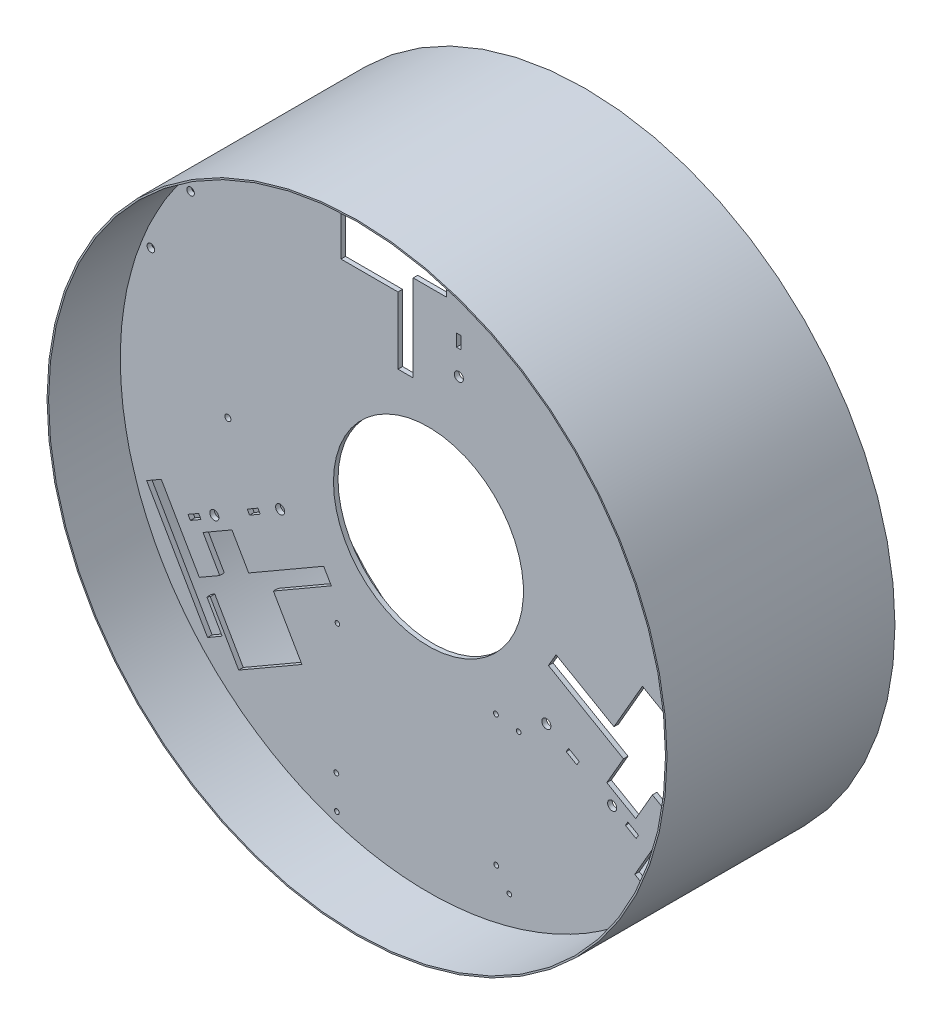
ISO-10303-21;
HEADER;
FILE_DESCRIPTION(('STEP AP214'),'2;1');
FILE_NAME('part.step','',(''),(''),'','','');
FILE_SCHEMA(('AUTOMOTIVE_DESIGN { 1 0 10303 214 1 1 1 1 }'));
ENDSEC;
DATA;
#1=APPLICATION_CONTEXT('core data for automotive mechanical design processes');
#2=APPLICATION_PROTOCOL_DEFINITION('international standard','automotive_design',2000,#1);
#3=PRODUCT_CONTEXT('',#1,'mechanical');
#4=PRODUCT('Part','Part','',(#3));
#5=PRODUCT_RELATED_PRODUCT_CATEGORY('part','',(#4));
#6=PRODUCT_DEFINITION_FORMATION('','',#4);
#7=PRODUCT_DEFINITION_CONTEXT('part definition',#1,'design');
#8=PRODUCT_DEFINITION('design','',#6,#7);
#9=PRODUCT_DEFINITION_SHAPE('','',#8);
#10=(LENGTH_UNIT() NAMED_UNIT(*) SI_UNIT(.MILLI.,.METRE.));
#11=(NAMED_UNIT(*) PLANE_ANGLE_UNIT() SI_UNIT($,.RADIAN.));
#12=(NAMED_UNIT(*) SI_UNIT($,.STERADIAN.) SOLID_ANGLE_UNIT());
#13=UNCERTAINTY_MEASURE_WITH_UNIT(LENGTH_MEASURE(1.E-05),#10,'distance_accuracy_value','');
#14=(GEOMETRIC_REPRESENTATION_CONTEXT(3) GLOBAL_UNCERTAINTY_ASSIGNED_CONTEXT((#13)) GLOBAL_UNIT_ASSIGNED_CONTEXT((#10,
#11,#12)) REPRESENTATION_CONTEXT('',''));
#15=CARTESIAN_POINT('',(0.,0.,0.));
#16=DIRECTION('',(0.,0.,1.));
#17=DIRECTION('',(1.,0.,0.));
#18=AXIS2_PLACEMENT_3D('',#15,#16,#17);
#19=CARTESIAN_POINT('',(-118.20802541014,-124.563289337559,-120.));
#20=DIRECTION('',(-0.866026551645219,-0.499998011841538,0.));
#21=DIRECTION('',(-0.499998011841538,0.866026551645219,0.));
#22=AXIS2_PLACEMENT_3D('',#19,#20,#21);
#23=PLANE('',#22);
#24=DIRECTION('',(0.,0.,-1.));
#25=VECTOR('',#24,1.);
#26=CARTESIAN_POINT('',(-128.207985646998,-107.242758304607,-113.));
#27=LINE('',#26,#25);
#28=CARTESIAN_POINT('',(-128.207985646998,-107.242758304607,-120.));
#29=VERTEX_POINT('',#28);
#30=CARTESIAN_POINT('',(-128.207985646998,-107.242758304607,-123.));
#31=VERTEX_POINT('',#30);
#32=EDGE_CURVE('E614',#29,#31,#27,.T.);
#33=ORIENTED_EDGE('',*,*,#32,.T.);
#34=DIRECTION('',(-0.499998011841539,0.866026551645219,0.));
#35=VECTOR('',#34,1.);
#36=CARTESIAN_POINT('',(-118.20802541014,-124.563289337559,-123.));
#37=LINE('',#36,#35);
#38=CARTESIAN_POINT('',(-118.20802541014,-124.563289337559,-123.));
#39=VERTEX_POINT('',#38);
#40=EDGE_CURVE('E1039',#39,#31,#37,.T.);
#41=ORIENTED_EDGE('',*,*,#40,.F.);
#42=DIRECTION('',(0.,0.,1.));
#43=VECTOR('',#42,1.);
#44=CARTESIAN_POINT('',(-118.20802541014,-124.563289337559,-121.5));
#45=LINE('',#44,#43);
#46=CARTESIAN_POINT('',(-118.20802541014,-124.563289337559,-120.));
#47=VERTEX_POINT('',#46);
#48=EDGE_CURVE('E1053',#39,#47,#45,.T.);
#49=ORIENTED_EDGE('',*,*,#48,.T.);
#50=DIRECTION('',(-0.499998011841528,0.866026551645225,0.));
#51=VECTOR('',#50,1.);
#52=CARTESIAN_POINT('',(-138.229715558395,-89.8845208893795,-120.));
#53=LINE('',#52,#51);
#54=EDGE_CURVE('E1056',#47,#29,#53,.T.);
#55=ORIENTED_EDGE('',*,*,#54,.T.);
#56=EDGE_LOOP('',(#33,#41,#49,#55));
#57=FACE_BOUND('',#56,.T.);
#58=ADVANCED_FACE('F44',(#57),#23,.T.);
#59=CARTESIAN_POINT('',(193.356644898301,-55.2186569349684,-120.));
#60=DIRECTION('',(0.866024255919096,-0.500001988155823,0.));
#61=DIRECTION('',(-0.500001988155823,-0.866024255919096,0.));
#62=AXIS2_PLACEMENT_3D('',#59,#60,#61);
#63=PLANE('',#62);
#64=DIRECTION('',(0.,0.,-1.));
#65=VECTOR('',#64,1.);
#66=CARTESIAN_POINT('',(183.356605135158,-72.539142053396,-113.));
#67=LINE('',#66,#65);
#68=CARTESIAN_POINT('',(183.356605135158,-72.539142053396,-120.));
#69=VERTEX_POINT('',#68);
#70=CARTESIAN_POINT('',(183.356605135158,-72.539142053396,-123.));
#71=VERTEX_POINT('',#70);
#72=EDGE_CURVE('E687',#69,#71,#67,.T.);
#73=ORIENTED_EDGE('',*,*,#72,.T.);
#74=DIRECTION('',(-0.500001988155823,-0.866024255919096,0.));
#75=VECTOR('',#74,1.);
#76=CARTESIAN_POINT('',(193.356644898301,-55.2186569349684,-123.));
#77=LINE('',#76,#75);
#78=CARTESIAN_POINT('',(193.356644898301,-55.2186569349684,-123.));
#79=VERTEX_POINT('',#78);
#80=EDGE_CURVE('E1114',#79,#71,#77,.T.);
#81=ORIENTED_EDGE('',*,*,#80,.F.);
#82=DIRECTION('',(0.,0.,1.));
#83=VECTOR('',#82,1.);
#84=CARTESIAN_POINT('',(193.356644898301,-55.2186569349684,-121.5));
#85=LINE('',#84,#83);
#86=CARTESIAN_POINT('',(193.356644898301,-55.2186569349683,-120.));
#87=VERTEX_POINT('',#86);
#88=EDGE_CURVE('E1128',#79,#87,#85,.T.);
#89=ORIENTED_EDGE('',*,*,#88,.T.);
#90=DIRECTION('',(-0.500001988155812,-0.866024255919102,0.));
#91=VECTOR('',#90,1.);
#92=CARTESIAN_POINT('',(173.334795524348,-89.8973334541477,-120.));
#93=LINE('',#92,#91);
#94=EDGE_CURVE('E1131',#87,#69,#93,.T.);
#95=ORIENTED_EDGE('',*,*,#94,.T.);
#96=EDGE_LOOP('',(#73,#81,#89,#95));
#97=FACE_BOUND('',#96,.T.);
#98=ADVANCED_FACE('F1438',(#97),#63,.T.);
#99=CARTESIAN_POINT('',(-22.4799035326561,179.93194627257,-120.));
#100=DIRECTION('',(2.29572612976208E-06,0.999999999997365,0.));
#101=DIRECTION('',(0.999999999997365,-2.29572612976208E-06,0.));
#102=AXIS2_PLACEMENT_3D('',#99,#100,#101);
#103=PLANE('',#102);
#104=DIRECTION('',(0.,0.,-1.));
#105=VECTOR('',#104,1.);
#106=CARTESIAN_POINT('',(-2.4799035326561,179.931900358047,-113.));
#107=LINE('',#106,#105);
#108=CARTESIAN_POINT('',(-2.4799035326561,179.931900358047,-120.));
#109=VERTEX_POINT('',#108);
#110=CARTESIAN_POINT('',(-2.4799035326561,179.931900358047,-123.));
#111=VERTEX_POINT('',#110);
#112=EDGE_CURVE('E766',#109,#111,#107,.T.);
#113=ORIENTED_EDGE('',*,*,#112,.T.);
#114=DIRECTION('',(0.999999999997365,-2.29572613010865E-06,0.));
#115=VECTOR('',#114,1.);
#116=CARTESIAN_POINT('',(-22.4799035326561,179.93194627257,-123.));
#117=LINE('',#116,#115);
#118=CARTESIAN_POINT('',(-22.4799035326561,179.93194627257,-123.));
#119=VERTEX_POINT('',#118);
#120=EDGE_CURVE('E911',#119,#111,#117,.T.);
#121=ORIENTED_EDGE('',*,*,#120,.F.);
#122=DIRECTION('',(0.,0.,1.));
#123=VECTOR('',#122,1.);
#124=CARTESIAN_POINT('',(-22.4799035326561,179.93194627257,-121.5));
#125=LINE('',#124,#123);
#126=CARTESIAN_POINT('',(-22.4799035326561,179.93194627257,-120.));
#127=VERTEX_POINT('',#126);
#128=EDGE_CURVE('E930',#119,#127,#125,.T.);
#129=ORIENTED_EDGE('',*,*,#128,.T.);
#130=DIRECTION('',(0.999999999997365,-2.29572612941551E-06,0.));
#131=VECTOR('',#130,1.);
#132=CARTESIAN_POINT('',(17.5636359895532,179.93185434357,-120.));
#133=LINE('',#132,#131);
#134=EDGE_CURVE('E933',#127,#109,#133,.T.);
#135=ORIENTED_EDGE('',*,*,#134,.T.);
#136=EDGE_LOOP('',(#113,#121,#129,#135));
#137=FACE_BOUND('',#136,.T.);
#138=ADVANCED_FACE('F1443',(#137),#103,.T.);
#139=CARTESIAN_POINT('',(-25.1111952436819,167.63021379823,-119.999999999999));
#140=DIRECTION('',(0.,0.,-1.));
#141=DIRECTION('',(-1.,0.,0.));
#142=AXIS2_PLACEMENT_3D('',#139,#140,#141);
#143=CYLINDRICAL_SURFACE('',#142,30.0585005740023);
#144=DIRECTION('',(0.,0.,-1.));
#145=VECTOR('',#144,1.);
#146=CARTESIAN_POINT('',(-32.5101372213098,196.763856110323,-121.5));
#147=LINE('',#146,#145);
#148=CARTESIAN_POINT('',(-32.5101372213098,196.763856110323,-120.));
#149=VERTEX_POINT('',#148);
#150=CARTESIAN_POINT('',(-32.5101372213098,196.763856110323,-123.));
#151=VERTEX_POINT('',#150);
#152=EDGE_CURVE('E12',#149,#151,#147,.T.);
#153=ORIENTED_EDGE('',*,*,#152,.F.);
#154=CARTESIAN_POINT('',(-25.1111952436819,167.63021379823,-120.));
#155=DIRECTION('',(0.,0.,-1.));
#156=DIRECTION('',(-1.,0.,0.));
#157=AXIS2_PLACEMENT_3D('',#154,#155,#156);
#158=CIRCLE('',#157,30.0585005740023);
#159=CARTESIAN_POINT('',(-25.1111952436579,197.688714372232,-120.));
#160=VERTEX_POINT('',#159);
#161=EDGE_CURVE('E1155',#149,#160,#158,.T.);
#162=ORIENTED_EDGE('',*,*,#161,.T.);
#163=DIRECTION('',(0.,0.,-1.));
#164=VECTOR('',#163,1.);
#165=CARTESIAN_POINT('',(-25.1111952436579,197.688714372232,-120.));
#166=LINE('',#165,#164);
#167=CARTESIAN_POINT('',(-25.1111952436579,197.688714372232,-123.));
#168=VERTEX_POINT('',#167);
#169=EDGE_CURVE('E1180',#160,#168,#166,.T.);
#170=ORIENTED_EDGE('',*,*,#169,.T.);
#171=CARTESIAN_POINT('',(-25.1111952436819,167.63021379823,-123.));
#172=DIRECTION('',(0.,0.,-1.));
#173=DIRECTION('',(-1.,0.,0.));
#174=AXIS2_PLACEMENT_3D('',#171,#172,#173);
#175=CIRCLE('',#174,30.0585005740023);
#176=EDGE_CURVE('E1407',#151,#168,#175,.T.);
#177=ORIENTED_EDGE('',*,*,#176,.F.);
#178=EDGE_LOOP('',(#153,#162,#170,#177));
#179=FACE_BOUND('',#178,.T.);
#180=ADVANCED_FACE('F1411',(#179),#143,.T.);
#181=CARTESIAN_POINT('',(-25.1111952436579,197.688714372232,-120.));
#182=DIRECTION('',(0.,1.,0.));
#183=DIRECTION('',(1.,0.,0.));
#184=AXIS2_PLACEMENT_3D('',#181,#182,#183);
#185=PLANE('',#184);
#186=DIRECTION('',(-1.,0.,0.));
#187=VECTOR('',#186,1.);
#188=CARTESIAN_POINT('',(-24.924230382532,197.688714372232,-123.));
#189=LINE('',#188,#187);
#190=CARTESIAN_POINT('',(-24.737265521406,197.688714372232,-123.));
#191=VERTEX_POINT('',#190);
#192=EDGE_CURVE('E812',#191,#168,#189,.T.);
#193=ORIENTED_EDGE('',*,*,#192,.T.);
#194=ORIENTED_EDGE('',*,*,#169,.F.);
#195=DIRECTION('',(1.,0.,0.));
#196=VECTOR('',#195,1.);
#197=CARTESIAN_POINT('',(271.287713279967,197.688714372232,-120.));
#198=LINE('',#197,#196);
#199=CARTESIAN_POINT('',(-24.737265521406,197.688714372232,-120.));
#200=VERTEX_POINT('',#199);
#201=EDGE_CURVE('E1152',#200,#160,#198,.F.);
#202=ORIENTED_EDGE('',*,*,#201,.F.);
#203=DIRECTION('',(0.,0.,1.));
#204=VECTOR('',#203,1.);
#205=CARTESIAN_POINT('',(-24.737265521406,197.688714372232,-121.5));
#206=LINE('',#205,#204);
#207=EDGE_CURVE('E1151',#191,#200,#206,.T.);
#208=ORIENTED_EDGE('',*,*,#207,.F.);
#209=EDGE_LOOP('',(#193,#194,#202,#208));
#210=FACE_BOUND('',#209,.T.);
#211=ADVANCED_FACE('F1260',(#210),#185,.T.);
#212=CARTESIAN_POINT('',(59.8424306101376,197.688714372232,-120.));
#213=DIRECTION('',(0.,1.,0.));
#214=DIRECTION('',(1.,0.,0.));
#215=AXIS2_PLACEMENT_3D('',#212,#213,#214);
#216=PLANE('',#215);
#217=DIRECTION('',(-1.,0.,0.));
#218=VECTOR('',#217,1.);
#219=CARTESIAN_POINT('',(60.0367070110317,197.688714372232,-123.));
#220=LINE('',#219,#218);
#221=CARTESIAN_POINT('',(60.2309834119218,197.688714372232,-123.));
#222=VERTEX_POINT('',#221);
#223=CARTESIAN_POINT('',(59.8424306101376,197.688714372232,-123.));
#224=VERTEX_POINT('',#223);
#225=EDGE_CURVE('E1158',#222,#224,#220,.T.);
#226=ORIENTED_EDGE('',*,*,#225,.T.);
#227=DIRECTION('',(0.,0.,-1.));
#228=VECTOR('',#227,1.);
#229=CARTESIAN_POINT('',(59.8424306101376,197.688714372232,-121.5));
#230=LINE('',#229,#228);
#231=CARTESIAN_POINT('',(59.8424306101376,197.688714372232,-120.));
#232=VERTEX_POINT('',#231);
#233=EDGE_CURVE('E1143',#232,#224,#230,.T.);
#234=ORIENTED_EDGE('',*,*,#233,.F.);
#235=DIRECTION('',(1.,0.,0.));
#236=VECTOR('',#235,1.);
#237=CARTESIAN_POINT('',(271.287713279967,197.688714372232,-120.));
#238=LINE('',#237,#236);
#239=CARTESIAN_POINT('',(60.2309834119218,197.688714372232,-120.));
#240=VERTEX_POINT('',#239);
#241=EDGE_CURVE('E1156',#240,#232,#238,.F.);
#242=ORIENTED_EDGE('',*,*,#241,.F.);
#243=DIRECTION('',(0.,0.,1.));
#244=VECTOR('',#243,1.);
#245=CARTESIAN_POINT('',(60.2309834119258,197.688714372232,-121.5));
#246=LINE('',#245,#244);
#247=EDGE_CURVE('E1134',#222,#240,#246,.T.);
#248=ORIENTED_EDGE('',*,*,#247,.F.);
#249=EDGE_LOOP('',(#226,#234,#242,#248));
#250=FACE_BOUND('',#249,.T.);
#251=ADVANCED_FACE('F1256',(#250),#216,.T.);
#252=CARTESIAN_POINT('',(271.287713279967,-253.013166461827,-120.));
#253=DIRECTION('',(0.,0.,1.));
#254=DIRECTION('',(1.,0.,0.));
#255=AXIS2_PLACEMENT_3D('',#252,#253,#254);
#256=PLANE('',#255);
#257=DIRECTION('',(0.866025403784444,0.499999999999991,0.));
#258=VECTOR('',#257,1.);
#259=CARTESIAN_POINT('',(108.293350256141,29.301351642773,-120.));
#260=LINE('',#259,#258);
#261=CARTESIAN_POINT('',(-126.04296190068,-105.992781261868,-120.));
#262=VERTEX_POINT('',#261);
#263=EDGE_CURVE('E654',#29,#262,#260,.T.);
#264=ORIENTED_EDGE('',*,*,#263,.F.);
#265=ORIENTED_EDGE('',*,*,#54,.F.);
#266=CARTESIAN_POINT('',(-127.794277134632,-130.158990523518,-120.));
#267=CARTESIAN_POINT('',(-126.930603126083,-129.654939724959,-120.));
#268=CARTESIAN_POINT('',(-126.066939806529,-129.15087061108,-120.));
#269=CARTESIAN_POINT('',(-124.339635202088,-128.142694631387,-120.));
#270=CARTESIAN_POINT('',(-123.475993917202,-127.638587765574,-120.));
#271=CARTESIAN_POINT('',(-121.144217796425,-126.277461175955,-120.));
#272=CARTESIAN_POINT('',(-119.676104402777,-125.420404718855,-120.));
#273=CARTESIAN_POINT('',(-118.20802541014,-124.563289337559,-120.));
#274=B_SPLINE_CURVE_WITH_KNOTS('',3,(#266,#267,#268,#269,#270,#271,#272,#273),.UNSPECIFIED.,.F.,
.F.,(4,2,2,4),(0.,3.00000000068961,6.00000000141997,11.0999141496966),.UNSPECIFIED.);
#275=CARTESIAN_POINT('',(-127.794277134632,-130.158990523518,-120.));
#276=VERTEX_POINT('',#275);
#277=EDGE_CURVE('E1062',#276,#47,#274,.T.);
#278=ORIENTED_EDGE('',*,*,#277,.F.);
#279=DIRECTION('',(0.500000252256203,-0.866025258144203,0.));
#280=VECTOR('',#279,1.);
#281=CARTESIAN_POINT('',(-147.829280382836,-95.4573703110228,-120.));
#282=LINE('',#281,#280);
#283=CARTESIAN_POINT('',(-167.864283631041,-60.7557500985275,-120.));
#284=VERTEX_POINT('',#283);
#285=EDGE_CURVE('E1037',#284,#276,#282,.T.);
#286=ORIENTED_EDGE('',*,*,#285,.F.);
#287=CARTESIAN_POINT('',(-158.251405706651,-55.2057524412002,-120.));
#288=CARTESIAN_POINT('',(-159.117432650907,-55.7057497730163,-120.));
#289=CARTESIAN_POINT('',(-159.983459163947,-56.2057478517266,-120.));
#290=CARTESIAN_POINT('',(-161.715511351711,-57.205745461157,-120.));
#291=CARTESIAN_POINT('',(-162.581537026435,-57.7057449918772,-120.));
#292=CARTESIAN_POINT('',(-164.919803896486,-59.0557448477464,-120.));
#293=CARTESIAN_POINT('',(-166.392044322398,-59.9057465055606,-120.));
#294=CARTESIAN_POINT('',(-167.864283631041,-60.7557500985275,-120.));
#295=B_SPLINE_CURVE_WITH_KNOTS('',3,(#287,#288,#289,#290,#291,#292,#293,#294),.UNSPECIFIED.,.F.,
.F.,(4,2,2,4),(0.,3.00000000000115,6.00000000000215,11.0999953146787),.UNSPECIFIED.);
#296=CARTESIAN_POINT('',(-158.251405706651,-55.2057524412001,-120.));
#297=VERTEX_POINT('',#296);
#298=EDGE_CURVE('E1038',#297,#284,#295,.T.);
#299=ORIENTED_EDGE('',*,*,#298,.F.);
#300=CARTESIAN_POINT('',(-133.207965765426,-98.5824927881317,-120.));
#301=VERTEX_POINT('',#300);
#302=EDGE_CURVE('E1168',#301,#297,#53,.T.);
#303=ORIENTED_EDGE('',*,*,#302,.F.);
#304=DIRECTION('',(-0.866025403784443,-0.499999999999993,0.));
#305=VECTOR('',#304,1.);
#306=CARTESIAN_POINT('',(103.29335025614,37.9616056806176,-120.));
#307=LINE('',#306,#305);
#308=CARTESIAN_POINT('',(-119.784631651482,-90.8325272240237,-120.));
#309=VERTEX_POINT('',#308);
#310=EDGE_CURVE('E617',#309,#301,#307,.T.);
#311=ORIENTED_EDGE('',*,*,#310,.F.);
#312=DIRECTION('',(0.499999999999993,-0.866025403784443,0.));
#313=VECTOR('',#312,1.);
#314=CARTESIAN_POINT('',(48.2097313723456,-381.807299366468,-120.));
#315=LINE('',#314,#313);
#316=CARTESIAN_POINT('',(-130.784631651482,-71.779968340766,-120.));
#317=VERTEX_POINT('',#316);
#318=EDGE_CURVE('E573',#317,#309,#315,.T.);
#319=ORIENTED_EDGE('',*,*,#318,.F.);
#320=DIRECTION('',(-0.866025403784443,-0.499999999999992,0.));
#321=VECTOR('',#320,1.);
#322=CARTESIAN_POINT('',(92.2933502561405,57.0141645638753,-120.));
#323=LINE('',#322,#321);
#324=CARTESIAN_POINT('',(-111.732072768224,-60.7799683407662,-120.));
#325=VERTEX_POINT('',#324);
#326=EDGE_CURVE('E638',#325,#317,#323,.T.);
#327=ORIENTED_EDGE('',*,*,#326,.F.);
#328=DIRECTION('',(-0.499999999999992,0.866025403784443,0.));
#329=VECTOR('',#328,1.);
#330=CARTESIAN_POINT('',(67.2622902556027,-370.807299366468,-120.));
#331=LINE('',#330,#329);
#332=CARTESIAN_POINT('',(-100.732072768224,-79.8325272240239,-120.));
#333=VERTEX_POINT('',#332);
#334=EDGE_CURVE('E640',#333,#325,#331,.T.);
#335=ORIENTED_EDGE('',*,*,#334,.F.);
#336=DIRECTION('',(-0.866025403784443,-0.499999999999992,0.));
#337=VECTOR('',#336,1.);
#338=CARTESIAN_POINT('',(103.29335025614,37.9616056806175,-120.));
#339=LINE('',#338,#337);
#340=CARTESIAN_POINT('',(-51.3686247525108,-51.3325272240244,-120.));
#341=VERTEX_POINT('',#340);
#342=EDGE_CURVE('E642',#341,#333,#339,.T.);
#343=ORIENTED_EDGE('',*,*,#342,.F.);
#344=DIRECTION('',(-0.499999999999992,0.866025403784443,0.));
#345=VECTOR('',#344,1.);
#346=CARTESIAN_POINT('',(116.625738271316,-342.307299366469,-120.));
#347=LINE('',#346,#345);
#348=CARTESIAN_POINT('',(-46.3686247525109,-59.9927812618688,-120.));
#349=VERTEX_POINT('',#348);
#350=EDGE_CURVE('E644',#349,#341,#347,.T.);
#351=ORIENTED_EDGE('',*,*,#350,.F.);
#352=DIRECTION('',(0.866025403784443,0.499999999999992,0.));
#353=VECTOR('',#352,1.);
#354=CARTESIAN_POINT('',(108.29335025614,29.301351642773,-120.));
#355=LINE('',#354,#353);
#356=CARTESIAN_POINT('',(-84.4737425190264,-81.9927812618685,-120.));
#357=VERTEX_POINT('',#356);
#358=EDGE_CURVE('E646',#357,#349,#355,.T.);
#359=ORIENTED_EDGE('',*,*,#358,.F.);
#360=DIRECTION('',(-0.499999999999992,0.866025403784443,0.));
#361=VECTOR('',#360,1.);
#362=CARTESIAN_POINT('',(78.5206205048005,-364.307299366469,-120.));
#363=LINE('',#362,#361);
#364=CARTESIAN_POINT('',(-65.7237425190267,-114.468733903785,-120.));
#365=VERTEX_POINT('',#364);
#366=EDGE_CURVE('E648',#365,#357,#363,.T.);
#367=ORIENTED_EDGE('',*,*,#366,.F.);
#368=DIRECTION('',(0.866025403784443,0.499999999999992,0.));
#369=VECTOR('',#368,1.);
#370=CARTESIAN_POINT('',(127.04335025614,-3.17460099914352,-120.));
#371=LINE('',#370,#369);
#372=CARTESIAN_POINT('',(-107.29296190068,-138.468733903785,-120.));
#373=VERTEX_POINT('',#372);
#374=EDGE_CURVE('E650',#373,#365,#371,.T.);
#375=ORIENTED_EDGE('',*,*,#374,.F.);
#376=DIRECTION('',(0.499999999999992,-0.866025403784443,0.));
#377=VECTOR('',#376,1.);
#378=CARTESIAN_POINT('',(36.9514011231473,-388.307299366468,-120.));
#379=LINE('',#378,#377);
#380=EDGE_CURVE('E652',#262,#373,#379,.T.);
#381=ORIENTED_EDGE('',*,*,#380,.F.);
#382=EDGE_LOOP('',(#264,#265,#278,#286,#299,#303,#311,#319,#327,#335,#343,#351,#359,#367,#375,#381));
#383=FACE_BOUND('',#382,.T.);
#384=DIRECTION('',(-0.866025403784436,0.500000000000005,0.));
#385=VECTOR('',#384,1.);
#386=CARTESIAN_POINT('',(327.452481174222,-155.732934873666,-120.));
#387=LINE('',#386,#385);
#388=CARTESIAN_POINT('',(181.19158138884,-71.2891650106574,-120.));
#389=VERTEX_POINT('',#388);
#390=EDGE_CURVE('E731',#69,#389,#387,.T.);
#391=ORIENTED_EDGE('',*,*,#390,.F.);
#392=ORIENTED_EDGE('',*,*,#94,.F.);
#393=CARTESIAN_POINT('',(202.995790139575,-60.7227438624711,-120.));
#394=CARTESIAN_POINT('',(202.127432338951,-60.2268056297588,-120.));
#395=CARTESIAN_POINT('',(201.259064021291,-59.7308858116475,-120.));
#396=CARTESIAN_POINT('',(199.522305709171,-58.7390841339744,-120.));
#397=CARTESIAN_POINT('',(198.653915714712,-58.2432022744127,-120.));
#398=CARTESIAN_POINT('',(196.309257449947,-56.9043882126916,-120.));
#399=CARTESIAN_POINT('',(194.832968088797,-56.0614929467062,-120.));
#400=CARTESIAN_POINT('',(193.356644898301,-55.2186569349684,-120.));
#401=B_SPLINE_CURVE_WITH_KNOTS('',3,(#393,#394,#395,#396,#397,#398,#399,#400),.UNSPECIFIED.,.F.,
.F.,(4,2,2,4),(0.,3.00000000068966,6.00000000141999,11.0999141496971),.UNSPECIFIED.);
#402=CARTESIAN_POINT('',(202.995790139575,-60.7227438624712,-120.));
#403=VERTEX_POINT('',#402);
#404=EDGE_CURVE('E1137',#403,#87,#401,.T.);
#405=ORIENTED_EDGE('',*,*,#404,.F.);
#406=DIRECTION('',(0.499999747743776,0.866025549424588,0.));
#407=VECTOR('',#406,1.);
#408=CARTESIAN_POINT('',(182.960807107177,-95.4243757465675,-120.));
#409=LINE('',#408,#407);
#410=CARTESIAN_POINT('',(162.925824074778,-130.126007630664,-120.));
#411=VERTEX_POINT('',#410);
#412=EDGE_CURVE('E1112',#411,#403,#409,.T.);
#413=ORIENTED_EDGE('',*,*,#412,.F.);
#414=CARTESIAN_POINT('',(153.312946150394,-124.576009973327,-120.));
#415=CARTESIAN_POINT('',(154.178970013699,-125.076012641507,-120.));
#416=CARTESIAN_POINT('',(155.044994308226,-125.576014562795,-120.));
#417=CARTESIAN_POINT('',(156.777043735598,-126.576016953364,-120.));
#418=CARTESIAN_POINT('',(157.643068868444,-127.076017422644,-120.));
#419=CARTESIAN_POINT('',(159.981336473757,-128.426016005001,-120.));
#420=CARTESIAN_POINT('',(161.453579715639,-129.276012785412,-120.));
#421=CARTESIAN_POINT('',(162.925824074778,-130.126007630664,-120.));
#422=B_SPLINE_CURVE_WITH_KNOTS('',3,(#414,#415,#416,#417,#418,#419,#420,#421),.UNSPECIFIED.,.F.,
.F.,(4,2,2,4),(0.,3.00000000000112,6.00000000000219,11.0999953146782),.UNSPECIFIED.);
#423=CARTESIAN_POINT('',(153.312946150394,-124.576009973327,-120.));
#424=VERTEX_POINT('',#423);
#425=EDGE_CURVE('E1113',#424,#411,#422,.T.);
#426=ORIENTED_EDGE('',*,*,#425,.F.);
#427=CARTESIAN_POINT('',(178.356585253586,-81.1993846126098,-120.));
#428=VERTEX_POINT('',#427);
#429=EDGE_CURVE('E1173',#428,#424,#93,.T.);
#430=ORIENTED_EDGE('',*,*,#429,.F.);
#431=DIRECTION('',(0.866025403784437,-0.500000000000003,0.));
#432=VECTOR('',#431,1.);
#433=CARTESIAN_POINT('',(322.452481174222,-164.39318891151,-120.));
#434=LINE('',#433,#432);
#435=CARTESIAN_POINT('',(164.933251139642,-73.4494190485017,-120.));
#436=VERTEX_POINT('',#435);
#437=EDGE_CURVE('E690',#436,#428,#434,.T.);
#438=ORIENTED_EDGE('',*,*,#437,.F.);
#439=DIRECTION('',(0.500000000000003,0.866025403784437,0.));
#440=VECTOR('',#439,1.);
#441=CARTESIAN_POINT('',(113.768483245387,-162.069396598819,-120.));
#442=LINE('',#441,#440);
#443=CARTESIAN_POINT('',(153.933251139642,-92.5019779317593,-120.));
#444=VERTEX_POINT('',#443);
#445=EDGE_CURVE('E713',#444,#436,#442,.T.);
#446=ORIENTED_EDGE('',*,*,#445,.F.);
#447=DIRECTION('',(0.866025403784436,-0.500000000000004,0.));
#448=VECTOR('',#447,1.);
#449=CARTESIAN_POINT('',(311.452481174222,-183.445747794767,-120.));
#450=LINE('',#449,#448);
#451=CARTESIAN_POINT('',(134.880692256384,-81.5019779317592,-120.));
#452=VERTEX_POINT('',#451);
#453=EDGE_CURVE('E715',#452,#444,#450,.T.);
#454=ORIENTED_EDGE('',*,*,#453,.F.);
#455=DIRECTION('',(-0.500000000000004,-0.866025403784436,0.));
#456=VECTOR('',#455,1.);
#457=CARTESIAN_POINT('',(94.7159243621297,-151.069396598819,-120.));
#458=LINE('',#457,#456);
#459=CARTESIAN_POINT('',(145.880692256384,-62.4494190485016,-120.));
#460=VERTEX_POINT('',#459);
#461=EDGE_CURVE('E717',#460,#452,#458,.T.);
#462=ORIENTED_EDGE('',*,*,#461,.F.);
#463=DIRECTION('',(0.866025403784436,-0.500000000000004,0.));
#464=VECTOR('',#463,1.);
#465=CARTESIAN_POINT('',(322.452481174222,-164.39318891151,-120.));
#466=LINE('',#465,#464);
#467=CARTESIAN_POINT('',(96.5172442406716,-33.9494190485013,-120.));
#468=VERTEX_POINT('',#467);
#469=EDGE_CURVE('E719',#468,#460,#466,.T.);
#470=ORIENTED_EDGE('',*,*,#469,.F.);
#471=DIRECTION('',(-0.500000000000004,-0.866025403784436,0.));
#472=VECTOR('',#471,1.);
#473=CARTESIAN_POINT('',(45.3524763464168,-122.569396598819,-120.));
#474=LINE('',#473,#472);
#475=CARTESIAN_POINT('',(101.517244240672,-25.289165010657,-120.));
#476=VERTEX_POINT('',#475);
#477=EDGE_CURVE('E721',#476,#468,#474,.T.);
#478=ORIENTED_EDGE('',*,*,#477,.F.);
#479=DIRECTION('',(-0.866025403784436,0.500000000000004,0.));
#480=VECTOR('',#479,1.);
#481=CARTESIAN_POINT('',(327.452481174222,-155.732934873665,-120.));
#482=LINE('',#481,#480);
#483=CARTESIAN_POINT('',(139.622362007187,-47.2891650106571,-120.));
#484=VERTEX_POINT('',#483);
#485=EDGE_CURVE('E723',#484,#476,#482,.T.);
#486=ORIENTED_EDGE('',*,*,#485,.F.);
#487=DIRECTION('',(-0.500000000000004,-0.866025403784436,0.));
#488=VECTOR('',#487,1.);
#489=CARTESIAN_POINT('',(83.457594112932,-144.569396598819,-120.));
#490=LINE('',#489,#488);
#491=CARTESIAN_POINT('',(158.372362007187,-14.8132123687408,-120.));
#492=VERTEX_POINT('',#491);
#493=EDGE_CURVE('E725',#492,#484,#490,.T.);
#494=ORIENTED_EDGE('',*,*,#493,.F.);
#495=DIRECTION('',(-0.866025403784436,0.500000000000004,0.));
#496=VECTOR('',#495,1.);
#497=CARTESIAN_POINT('',(346.202481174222,-123.256982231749,-120.));
#498=LINE('',#497,#496);
#499=CARTESIAN_POINT('',(199.94158138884,-38.813212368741,-120.));
#500=VERTEX_POINT('',#499);
#501=EDGE_CURVE('E727',#500,#492,#498,.T.);
#502=ORIENTED_EDGE('',*,*,#501,.F.);
#503=DIRECTION('',(0.500000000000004,0.866025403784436,0.));
#504=VECTOR('',#503,1.);
#505=CARTESIAN_POINT('',(125.026813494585,-168.569396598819,-120.));
#506=LINE('',#505,#504);
#507=EDGE_CURVE('E729',#389,#500,#506,.T.);
#508=ORIENTED_EDGE('',*,*,#507,.F.);
#509=EDGE_LOOP('',(#391,#392,#405,#413,#426,#430,#438,#446,#454,#462,#470,#478,#486,#494,#502,#508));
#510=FACE_BOUND('',#509,.T.);
#511=DIRECTION('',(0.,-1.,0.));
#512=VECTOR('',#511,1.);
#513=CARTESIAN_POINT('',(-2.47990353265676,-253.013166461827,-120.));
#514=LINE('',#513,#512);
#515=CARTESIAN_POINT('',(-2.47990353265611,177.43194627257,-120.));
#516=VERTEX_POINT('',#515);
#517=EDGE_CURVE('E810',#109,#516,#514,.T.);
#518=ORIENTED_EDGE('',*,*,#517,.F.);
#519=ORIENTED_EDGE('',*,*,#134,.F.);
#520=CARTESIAN_POINT('',(-22.5327970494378,191.031734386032,-120.));
#521=CARTESIAN_POINT('',(-22.5281132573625,190.031745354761,-120.));
#522=CARTESIAN_POINT('',(-22.5234082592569,189.03175642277,-120.));
#523=CARTESIAN_POINT('',(-22.5139545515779,187.031778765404,-120.));
#524=CARTESIAN_POINT('',(-22.5092058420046,186.031790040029,-120.));
#525=CARTESIAN_POINT('',(-22.4963236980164,183.331849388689,-120.));
#526=CARTESIAN_POINT('',(-22.4881477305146,181.631897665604,-120.));
#527=CARTESIAN_POINT('',(-22.4799035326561,179.93194627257,-120.));
#528=B_SPLINE_CURVE_WITH_KNOTS('',3,(#520,#521,#522,#523,#524,#525,#526,#527),.UNSPECIFIED.,.F.,
.F.,(4,2,2,4),(0.,3.0000000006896,6.00000000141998,11.0999141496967),.UNSPECIFIED.);
#529=CARTESIAN_POINT('',(-22.5327970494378,191.031734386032,-120.));
#530=VERTEX_POINT('',#529);
#531=EDGE_CURVE('E1294',#530,#127,#528,.T.);
#532=ORIENTED_EDGE('',*,*,#531,.F.);
#533=DIRECTION('',(-0.999999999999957,-2.91280384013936E-07,0.));
#534=VECTOR('',#533,1.);
#535=CARTESIAN_POINT('',(17.5371892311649,191.031746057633,-120.));
#536=LINE('',#535,#534);
#537=CARTESIAN_POINT('',(57.6071755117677,191.031757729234,-120.));
#538=VERTEX_POINT('',#537);
#539=EDGE_CURVE('E928',#538,#530,#536,.T.);
#540=ORIENTED_EDGE('',*,*,#539,.F.);
#541=CARTESIAN_POINT('',(57.6071755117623,179.93176241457,-120.));
#542=CARTESIAN_POINT('',(57.6071785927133,180.931762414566,-120.));
#543=CARTESIAN_POINT('',(57.6071808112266,181.931762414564,-120.));
#544=CARTESIAN_POINT('',(57.6071835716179,183.931762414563,-120.));
#545=CARTESIAN_POINT('',(57.607184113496,184.931762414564,-120.));
#546=CARTESIAN_POINT('',(57.6071833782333,187.63176085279,-120.));
#547=CARTESIAN_POINT('',(57.6071805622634,189.331759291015,-120.));
#548=CARTESIAN_POINT('',(57.6071755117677,191.031757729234,-120.));
#549=B_SPLINE_CURVE_WITH_KNOTS('',3,(#541,#542,#543,#544,#545,#546,#547,#548),.UNSPECIFIED.,.F.,
.F.,(4,2,2,4),(0.,3.00000000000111,6.00000000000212,11.0999953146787),.UNSPECIFIED.);
#550=CARTESIAN_POINT('',(57.6071755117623,179.93176241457,-120.));
#551=VERTEX_POINT('',#550);
#552=EDGE_CURVE('E929',#551,#538,#549,.T.);
#553=ORIENTED_EDGE('',*,*,#552,.F.);
#554=CARTESIAN_POINT('',(7.52009646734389,179.931877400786,-120.));
#555=VERTEX_POINT('',#554);
#556=EDGE_CURVE('E1163',#555,#551,#133,.T.);
#557=ORIENTED_EDGE('',*,*,#556,.F.);
#558=DIRECTION('',(0.,1.,0.));
#559=VECTOR('',#558,1.);
#560=CARTESIAN_POINT('',(7.52009646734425,-253.013166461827,-120.));
#561=LINE('',#560,#559);
#562=CARTESIAN_POINT('',(7.5200964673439,164.43194627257,-120.));
#563=VERTEX_POINT('',#562);
#564=EDGE_CURVE('E769',#563,#555,#561,.T.);
#565=ORIENTED_EDGE('',*,*,#564,.F.);
#566=DIRECTION('',(-1.,0.,0.));
#567=VECTOR('',#566,1.);
#568=CARTESIAN_POINT('',(271.287713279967,164.43194627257,-120.));
#569=LINE('',#568,#567);
#570=CARTESIAN_POINT('',(29.5200964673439,164.43194627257,-120.));
#571=VERTEX_POINT('',#570);
#572=EDGE_CURVE('E792',#571,#563,#569,.T.);
#573=ORIENTED_EDGE('',*,*,#572,.F.);
#574=DIRECTION('',(0.,1.,0.));
#575=VECTOR('',#574,1.);
#576=CARTESIAN_POINT('',(29.5200964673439,-253.013166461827,-120.));
#577=LINE('',#576,#575);
#578=CARTESIAN_POINT('',(29.5200964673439,142.43194627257,-120.));
#579=VERTEX_POINT('',#578);
#580=EDGE_CURVE('E794',#579,#571,#577,.T.);
#581=ORIENTED_EDGE('',*,*,#580,.F.);
#582=DIRECTION('',(1.,0.,0.));
#583=VECTOR('',#582,1.);
#584=CARTESIAN_POINT('',(271.287713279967,142.43194627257,-120.));
#585=LINE('',#584,#583);
#586=CARTESIAN_POINT('',(7.5200964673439,142.43194627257,-120.));
#587=VERTEX_POINT('',#586);
#588=EDGE_CURVE('E796',#587,#579,#585,.T.);
#589=ORIENTED_EDGE('',*,*,#588,.F.);
#590=DIRECTION('',(0.,1.,0.));
#591=VECTOR('',#590,1.);
#592=CARTESIAN_POINT('',(7.52009646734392,-253.013166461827,-120.));
#593=LINE('',#592,#591);
#594=CARTESIAN_POINT('',(7.5200964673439,85.43194627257,-120.));
#595=VERTEX_POINT('',#594);
#596=EDGE_CURVE('E798',#595,#587,#593,.T.);
#597=ORIENTED_EDGE('',*,*,#596,.F.);
#598=DIRECTION('',(1.,0.,0.));
#599=VECTOR('',#598,1.);
#600=CARTESIAN_POINT('',(271.287713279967,85.4319462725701,-120.));
#601=LINE('',#600,#599);
#602=CARTESIAN_POINT('',(-2.47990353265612,85.43194627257,-120.));
#603=VERTEX_POINT('',#602);
#604=EDGE_CURVE('E800',#603,#595,#601,.T.);
#605=ORIENTED_EDGE('',*,*,#604,.F.);
#606=DIRECTION('',(0.,-1.,0.));
#607=VECTOR('',#606,1.);
#608=CARTESIAN_POINT('',(-2.47990353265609,-253.013166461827,-120.));
#609=LINE('',#608,#607);
#610=CARTESIAN_POINT('',(-2.47990353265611,129.43194627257,-120.));
#611=VERTEX_POINT('',#610);
#612=EDGE_CURVE('E802',#611,#603,#609,.T.);
#613=ORIENTED_EDGE('',*,*,#612,.F.);
#614=DIRECTION('',(1.,0.,0.));
#615=VECTOR('',#614,1.);
#616=CARTESIAN_POINT('',(271.287713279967,129.43194627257,-120.));
#617=LINE('',#616,#615);
#618=CARTESIAN_POINT('',(-39.9799035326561,129.43194627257,-120.));
#619=VERTEX_POINT('',#618);
#620=EDGE_CURVE('E804',#619,#611,#617,.T.);
#621=ORIENTED_EDGE('',*,*,#620,.F.);
#622=DIRECTION('',(0.,-1.,0.));
#623=VECTOR('',#622,1.);
#624=CARTESIAN_POINT('',(-39.9799035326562,-253.013166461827,-120.));
#625=LINE('',#624,#623);
#626=CARTESIAN_POINT('',(-39.9799035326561,177.43194627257,-120.));
#627=VERTEX_POINT('',#626);
#628=EDGE_CURVE('E806',#627,#619,#625,.T.);
#629=ORIENTED_EDGE('',*,*,#628,.F.);
#630=DIRECTION('',(-1.,0.,0.));
#631=VECTOR('',#630,1.);
#632=CARTESIAN_POINT('',(271.287713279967,177.43194627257,-120.));
#633=LINE('',#632,#631);
#634=EDGE_CURVE('E808',#516,#627,#633,.T.);
#635=ORIENTED_EDGE('',*,*,#634,.F.);
#636=EDGE_LOOP('',(#518,#519,#532,#540,#553,#557,#565,#573,#581,#589,#597,#605,#613,#621,#629,#635));
#637=FACE_BOUND('',#636,.T.);
#638=CARTESIAN_POINT('',(-43.0584675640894,-164.911791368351,-120.));
#639=DIRECTION('',(0.,0.,-1.));
#640=DIRECTION('',(-1.,0.,0.));
#641=AXIS2_PLACEMENT_3D('',#638,#639,#640);
#642=CIRCLE('',#641,1.59999999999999);
#643=CARTESIAN_POINT('',(-44.6584675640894,-164.911791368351,-120.));
#644=VERTEX_POINT('',#643);
#645=EDGE_CURVE('E1408',#644,#644,#642,.F.);
#646=ORIENTED_EDGE('',*,*,#645,.F.);
#647=EDGE_LOOP('',(#646));
#648=FACE_BOUND('',#647,.T.);
#649=CARTESIAN_POINT('',(62.1415324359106,-164.911791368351,-120.));
#650=DIRECTION('',(0.,0.,-1.));
#651=DIRECTION('',(-1.,0.,0.));
#652=AXIS2_PLACEMENT_3D('',#649,#650,#651);
#653=CIRCLE('',#652,1.6);
#654=CARTESIAN_POINT('',(60.5415324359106,-164.911791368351,-120.));
#655=VERTEX_POINT('',#654);
#656=EDGE_CURVE('E1831',#655,#655,#653,.F.);
#657=ORIENTED_EDGE('',*,*,#656,.F.);
#658=EDGE_LOOP('',(#657));
#659=FACE_BOUND('',#658,.T.);
#660=CARTESIAN_POINT('',(61.9415324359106,-78.9117913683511,-120.));
#661=DIRECTION('',(0.,0.,-1.));
#662=DIRECTION('',(-1.,0.,0.));
#663=AXIS2_PLACEMENT_3D('',#660,#661,#662);
#664=CIRCLE('',#663,1.60000000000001);
#665=CARTESIAN_POINT('',(60.3415324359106,-78.9117913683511,-120.));
#666=VERTEX_POINT('',#665);
#667=EDGE_CURVE('E901',#666,#666,#664,.F.);
#668=ORIENTED_EDGE('',*,*,#667,.F.);
#669=EDGE_LOOP('',(#668));
#670=FACE_BOUND('',#669,.T.);
#671=CARTESIAN_POINT('',(-44.3264844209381,-186.748045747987,-120.));
#672=CARTESIAN_POINT('',(-44.32690821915,-186.793021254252,-120.));
#673=CARTESIAN_POINT('',(-44.3254611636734,-186.838016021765,-120.));
#674=CARTESIAN_POINT('',(-44.3188150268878,-186.927729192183,-120.));
#675=CARTESIAN_POINT('',(-44.3136157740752,-186.972447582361,-120.));
#676=CARTESIAN_POINT('',(-44.2994634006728,-187.061235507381,-120.));
#677=CARTESIAN_POINT('',(-44.2905148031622,-187.10530575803,-120.));
#678=CARTESIAN_POINT('',(-44.2689245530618,-187.192517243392,-120.));
#679=CARTESIAN_POINT('',(-44.2562830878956,-187.235658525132,-120.));
#680=CARTESIAN_POINT('',(-44.2129063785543,-187.363303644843,-120.));
#681=CARTESIAN_POINT('',(-44.1767190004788,-187.44602763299,-120.));
#682=CARTESIAN_POINT('',(-44.0909842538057,-187.604168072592,-120.));
#683=CARTESIAN_POINT('',(-44.0414370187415,-187.679584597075,-120.));
#684=CARTESIAN_POINT('',(-43.9304996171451,-187.821054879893,-120.));
#685=CARTESIAN_POINT('',(-43.8691183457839,-187.887115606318,-120.));
#686=CARTESIAN_POINT('',(-43.7362053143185,-188.008104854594,-120.));
#687=CARTESIAN_POINT('',(-43.6646721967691,-188.063031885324,-120.));
#688=CARTESIAN_POINT('',(-43.5128509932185,-188.160505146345,-120.));
#689=CARTESIAN_POINT('',(-43.4325010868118,-188.202955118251,-120.));
#690=CARTESIAN_POINT('',(-43.2657662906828,-188.273561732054,-120.));
#691=CARTESIAN_POINT('',(-43.1793849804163,-188.301726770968,-120.));
#692=CARTESIAN_POINT('',(-43.0336688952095,-188.335823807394,-120.));
#693=CARTESIAN_POINT('',(-42.9753067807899,-188.346075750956,-120.));
#694=CARTESIAN_POINT('',(-42.8578893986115,-188.360086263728,-120.));
#695=CARTESIAN_POINT('',(-42.7988352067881,-188.363853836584,-120.));
#696=CARTESIAN_POINT('',(-42.7397340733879,-188.364380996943,-120.));
#697=B_SPLINE_CURVE_WITH_KNOTS('',3,(#671,#672,#673,#674,#675,#676,#677,#678,#679,#680,#681,
#682,#683,#684,#685,#686,#687,#688,#689,#690,#691,#692,#693,#694,#695,#696),.UNSPECIFIED.,.F.,
.F.,(4,2,2,2,2,2,2,2,2,2,2,2,4),(0.,0.134895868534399,0.269797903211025,0.40453766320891,
0.539270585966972,0.808739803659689,1.07820632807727,1.3474710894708,1.61677188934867,
1.88809882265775,2.15926607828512,2.33669622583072,2.51387980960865),.UNSPECIFIED.);
#698=CARTESIAN_POINT('',(-44.3264844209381,-186.748045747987,-120.));
#699=VERTEX_POINT('',#698);
#700=CARTESIAN_POINT('',(-42.7397340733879,-188.364380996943,-120.));
#701=VERTEX_POINT('',#700);
#702=EDGE_CURVE('E910',#699,#701,#697,.T.);
#703=ORIENTED_EDGE('',*,*,#702,.F.);
#704=CARTESIAN_POINT('',(-42.7101494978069,-185.16133067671,-120.));
#705=CARTESIAN_POINT('',(-42.7551253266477,-185.160906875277,-120.));
#706=CARTESIAN_POINT('',(-42.8001204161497,-185.162353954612,-120.));
#707=CARTESIAN_POINT('',(-42.8898342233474,-185.16900018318,-120.));
#708=CARTESIAN_POINT('',(-42.9345529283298,-185.174199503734,-120.));
#709=CARTESIAN_POINT('',(-43.0233414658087,-185.188352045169,-120.));
#710=CARTESIAN_POINT('',(-43.0674120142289,-185.197300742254,-120.));
#711=CARTESIAN_POINT('',(-43.1546240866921,-185.218891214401,-120.));
#712=CARTESIAN_POINT('',(-43.1977656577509,-185.231532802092,-120.));
#713=CARTESIAN_POINT('',(-43.3254116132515,-185.274909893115,-120.));
#714=CARTESIAN_POINT('',(-43.4081361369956,-185.311097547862,-120.));
#715=CARTESIAN_POINT('',(-43.5662776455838,-185.39683287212,-120.));
#716=CARTESIAN_POINT('',(-43.6416947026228,-185.446380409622,-120.));
#717=CARTESIAN_POINT('',(-43.7831663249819,-185.557318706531,-120.));
#718=CARTESIAN_POINT('',(-43.8492278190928,-185.618700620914,-120.));
#719=CARTESIAN_POINT('',(-43.9702183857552,-185.751615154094,-120.));
#720=CARTESIAN_POINT('',(-44.0251459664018,-185.823149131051,-120.));
#721=CARTESIAN_POINT('',(-44.1226194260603,-185.974971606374,-120.));
#722=CARTESIAN_POINT('',(-44.1650691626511,-186.055321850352,-120.));
#723=CARTESIAN_POINT('',(-44.2356747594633,-186.222057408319,-120.));
#724=CARTESIAN_POINT('',(-44.263839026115,-186.308439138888,-120.));
#725=CARTESIAN_POINT('',(-44.2979323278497,-186.454148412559,-120.));
#726=CARTESIAN_POINT('',(-44.3081823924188,-186.512503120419,-120.));
#727=CARTESIAN_POINT('',(-44.3221903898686,-186.629905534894,-120.));
#728=CARTESIAN_POINT('',(-44.3259573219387,-186.688952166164,-120.));
#729=CARTESIAN_POINT('',(-44.3264844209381,-186.748045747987,-120.));
#730=B_SPLINE_CURVE_WITH_KNOTS('',3,(#704,#705,#706,#707,#708,#709,#710,#711,#712,#713,#714,
#715,#716,#717,#718,#719,#720,#721,#722,#723,#724,#725,#726,#727,#728,#729),.UNSPECIFIED.,.F.,
.F.,(4,2,2,2,2,2,2,2,2,2,2,2,4),(0.,0.13489683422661,0.269799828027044,0.404540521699,
0.539274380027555,0.808745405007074,1.07821376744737,1.34748150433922,1.61678529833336,
1.8881127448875,2.15928034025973,2.33668772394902,2.5138486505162),.UNSPECIFIED.);
#731=CARTESIAN_POINT('',(-42.7101494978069,-185.16133067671,-120.));
#732=VERTEX_POINT('',#731);
#733=EDGE_CURVE('E898',#732,#699,#730,.T.);
#734=ORIENTED_EDGE('',*,*,#733,.F.);
#735=CARTESIAN_POINT('',(-41.1233988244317,-186.777630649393,-120.));
#736=CARTESIAN_POINT('',(-41.1229750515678,-186.732658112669,-120.));
#737=CARTESIAN_POINT('',(-41.1244221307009,-186.687666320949,-120.));
#738=CARTESIAN_POINT('',(-41.1310682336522,-186.59795913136,-120.));
#739=CARTESIAN_POINT('',(-41.1362674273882,-186.5532437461,-120.));
#740=CARTESIAN_POINT('',(-41.1504195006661,-186.464461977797,-120.));
#741=CARTESIAN_POINT('',(-41.1593678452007,-186.420394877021,-120.));
#742=CARTESIAN_POINT('',(-41.1809573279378,-186.333189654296,-120.));
#743=CARTESIAN_POINT('',(-41.1935982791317,-186.290051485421,-120.));
#744=CARTESIAN_POINT('',(-41.236972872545,-186.162415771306,-120.));
#745=CARTESIAN_POINT('',(-41.273158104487,-186.079697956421,-120.));
#746=CARTESIAN_POINT('',(-41.3588867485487,-185.921568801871,-120.));
#747=CARTESIAN_POINT('',(-41.4084300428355,-185.846157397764,-120.));
#748=CARTESIAN_POINT('',(-41.5193609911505,-185.704691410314,-120.));
#749=CARTESIAN_POINT('',(-41.5807404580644,-185.638630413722,-120.));
#750=CARTESIAN_POINT('',(-41.7136494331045,-185.517639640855,-120.));
#751=CARTESIAN_POINT('',(-41.7851803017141,-185.462711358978,-120.));
#752=CARTESIAN_POINT('',(-41.9370008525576,-185.365231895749,-120.));
#753=CARTESIAN_POINT('',(-42.017352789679,-185.322777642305,-120.));
#754=CARTESIAN_POINT('',(-42.1840924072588,-185.252163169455,-120.));
#755=CARTESIAN_POINT('',(-42.2704765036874,-185.223994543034,-120.));
#756=CARTESIAN_POINT('',(-42.4161986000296,-185.189892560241,-120.));
#757=CARTESIAN_POINT('',(-42.4745637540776,-185.179638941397,-120.));
#758=CARTESIAN_POINT('',(-42.5919874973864,-185.165626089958,-120.));
#759=CARTESIAN_POINT('',(-42.6510450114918,-185.161857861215,-120.));
#760=CARTESIAN_POINT('',(-42.7101494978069,-185.16133067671,-120.));
#761=B_SPLINE_CURVE_WITH_KNOTS('',3,(#735,#736,#737,#738,#739,#740,#741,#742,#743,#744,#745,
#746,#747,#748,#749,#750,#751,#752,#753,#754,#755,#756,#757,#758,#759,#760),.UNSPECIFIED.,.F.,
.F.,(4,2,2,2,2,2,2,2,2,2,2,2,4),(0.,0.13488694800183,0.269780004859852,0.404510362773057,
0.53923389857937,0.808683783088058,1.07813129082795,1.34739308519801,1.61669099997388,
1.88802924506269,2.15920762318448,2.33664753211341,2.51384110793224),.UNSPECIFIED.);
#762=CARTESIAN_POINT('',(-41.1233988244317,-186.777630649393,-120.));
#763=VERTEX_POINT('',#762);
#764=EDGE_CURVE('E905',#763,#732,#761,.T.);
#765=ORIENTED_EDGE('',*,*,#764,.F.);
#766=CARTESIAN_POINT('',(-42.7397340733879,-188.364380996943,-120.));
#767=CARTESIAN_POINT('',(-42.6947593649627,-188.364804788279,-120.));
#768=CARTESIAN_POINT('',(-42.6497654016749,-188.363357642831,-120.));
#769=CARTESIAN_POINT('',(-42.5600538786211,-188.356711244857,-120.));
#770=CARTESIAN_POINT('',(-42.5153363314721,-188.351511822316,-120.));
#771=CARTESIAN_POINT('',(-42.426550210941,-188.337359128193,-120.));
#772=CARTESIAN_POINT('',(-42.3824809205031,-188.328410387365,-120.));
#773=CARTESIAN_POINT('',(-42.2952713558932,-188.306819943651,-120.));
#774=CARTESIAN_POINT('',(-42.2521310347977,-188.294178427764,-120.));
#775=CARTESIAN_POINT('',(-42.1244889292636,-188.250801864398,-120.));
#776=CARTESIAN_POINT('',(-42.0417669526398,-188.214614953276,-120.));
#777=CARTESIAN_POINT('',(-41.8836299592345,-188.128882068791,-120.));
#778=CARTESIAN_POINT('',(-41.8082148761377,-188.079336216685,-120.));
#779=CARTESIAN_POINT('',(-41.6667435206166,-187.968400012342,-120.));
#780=CARTESIAN_POINT('',(-41.6006806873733,-187.907018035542,-120.));
#781=CARTESIAN_POINT('',(-41.4796872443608,-187.774103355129,-120.));
#782=CARTESIAN_POINT('',(-41.4247581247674,-187.702569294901,-120.));
#783=CARTESIAN_POINT('',(-41.327280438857,-187.550745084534,-120.));
#784=CARTESIAN_POINT('',(-41.2848282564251,-187.470393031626,-120.));
#785=CARTESIAN_POINT('',(-41.2142181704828,-187.303653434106,-120.));
#786=CARTESIAN_POINT('',(-41.1860518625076,-187.217269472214,-120.));
#787=CARTESIAN_POINT('',(-41.1519548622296,-187.071553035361,-120.));
#788=CARTESIAN_POINT('',(-41.1417033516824,-187.013193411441,-120.));
#789=CARTESIAN_POINT('',(-41.1276934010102,-186.895781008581,-120.));
#790=CARTESIAN_POINT('',(-41.1239259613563,-186.836729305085,-120.));
#791=CARTESIAN_POINT('',(-41.1233988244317,-186.777630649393,-120.));
#792=B_SPLINE_CURVE_WITH_KNOTS('',3,(#766,#767,#768,#769,#770,#771,#772,#773,#774,#775,#776,
#777,#778,#779,#780,#781,#782,#783,#784,#785,#786,#787,#788,#789,#790,#791),.UNSPECIFIED.,.F.,
.F.,(4,2,2,2,2,2,2,2,2,2,2,2,4),(0.,0.134893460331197,0.26979303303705,0.404530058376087,
0.539260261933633,0.808723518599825,1.07818432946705,1.34745516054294,1.61676200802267,
1.8880976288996,2.15927343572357,2.33669602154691,2.51387215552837),.UNSPECIFIED.);
#793=EDGE_CURVE('E909',#701,#763,#792,.T.);
#794=ORIENTED_EDGE('',*,*,#793,.F.);
#795=EDGE_LOOP('',(#703,#734,#765,#794));
#796=FACE_BOUND('',#795,.T.);
#797=CARTESIAN_POINT('',(-165.081936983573,73.2440122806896,-120.));
#798=DIRECTION('',(0.,0.,-1.));
#799=DIRECTION('',(-1.,0.,0.));
#800=AXIS2_PLACEMENT_3D('',#797,#798,#799);
#801=CIRCLE('',#800,2.50000000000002);
#802=CARTESIAN_POINT('',(-167.581936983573,73.2440122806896,-120.));
#803=VERTEX_POINT('',#802);
#804=EDGE_CURVE('E1845',#803,#803,#801,.F.);
#805=ORIENTED_EDGE('',*,*,#804,.F.);
#806=EDGE_LOOP('',(#805));
#807=FACE_BOUND('',#806,.T.);
#808=CARTESIAN_POINT('',(-138.955378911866,118.496538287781,-120.));
#809=DIRECTION('',(0.,0.,-1.));
#810=DIRECTION('',(-1.,0.,0.));
#811=AXIS2_PLACEMENT_3D('',#808,#809,#810);
#812=CIRCLE('',#811,2.5);
#813=CARTESIAN_POINT('',(-141.455378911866,118.496538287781,-120.));
#814=VERTEX_POINT('',#813);
#815=EDGE_CURVE('E1849',#814,#814,#812,.F.);
#816=ORIENTED_EDGE('',*,*,#815,.F.);
#817=EDGE_LOOP('',(#816));
#818=FACE_BOUND('',#817,.T.);
#819=CARTESIAN_POINT('',(-114.437735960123,1.72030414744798,-120.));
#820=DIRECTION('',(0.,0.,-1.));
#821=DIRECTION('',(-1.,0.,0.));
#822=AXIS2_PLACEMENT_3D('',#819,#820,#821);
#823=CIRCLE('',#822,2.);
#824=CARTESIAN_POINT('',(-116.437735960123,1.72030414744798,-120.));
#825=VERTEX_POINT('',#824);
#826=EDGE_CURVE('E1853',#825,#825,#823,.F.);
#827=ORIENTED_EDGE('',*,*,#826,.F.);
#828=EDGE_LOOP('',(#827));
#829=FACE_BOUND('',#828,.T.);
#830=CARTESIAN_POINT('',(70.7452936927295,-176.985444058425,-120.));
#831=DIRECTION('',(0.,0.,-1.));
#832=DIRECTION('',(-1.,0.,0.));
#833=AXIS2_PLACEMENT_3D('',#830,#831,#832);
#834=CIRCLE('',#833,1.50000000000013);
#835=CARTESIAN_POINT('',(69.2452936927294,-176.985444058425,-120.));
#836=VERTEX_POINT('',#835);
#837=EDGE_CURVE('E1857',#836,#836,#834,.F.);
#838=ORIENTED_EDGE('',*,*,#837,.F.);
#839=EDGE_LOOP('',(#838));
#840=FACE_BOUND('',#839,.T.);
#841=CARTESIAN_POINT('',(76.9528789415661,-81.4388185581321,-120.));
#842=DIRECTION('',(0.,0.,-1.));
#843=DIRECTION('',(-1.,0.,0.));
#844=AXIS2_PLACEMENT_3D('',#841,#842,#843);
#845=CIRCLE('',#844,1.50000000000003);
#846=CARTESIAN_POINT('',(75.4528789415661,-81.4388185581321,-120.));
#847=VERTEX_POINT('',#846);
#848=EDGE_CURVE('E1861',#847,#847,#845,.F.);
#849=ORIENTED_EDGE('',*,*,#848,.F.);
#850=EDGE_LOOP('',(#849));
#851=FACE_BOUND('',#850,.T.);
#852=CARTESIAN_POINT('',(-42.3584675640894,-79.4117913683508,-120.));
#853=DIRECTION('',(0.,0.,-1.));
#854=DIRECTION('',(-1.,0.,0.));
#855=AXIS2_PLACEMENT_3D('',#852,#853,#854);
#856=CIRCLE('',#855,1.50000000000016);
#857=CARTESIAN_POINT('',(-43.8584675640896,-79.4117913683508,-120.));
#858=VERTEX_POINT('',#857);
#859=EDGE_CURVE('E1865',#858,#858,#856,.F.);
#860=ORIENTED_EDGE('',*,*,#859,.F.);
#861=EDGE_LOOP('',(#860));
#862=FACE_BOUND('',#861,.T.);
#863=CARTESIAN_POINT('',(17.5562386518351,0.0500000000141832,-120.));
#864=DIRECTION('',(0.,0.,-1.));
#865=DIRECTION('',(-1.,0.,0.));
#866=AXIS2_PLACEMENT_3D('',#863,#864,#865);
#867=CIRCLE('',#866,62.4999999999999);
#868=CARTESIAN_POINT('',(-44.9437613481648,0.0500000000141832,-120.));
#869=VERTEX_POINT('',#868);
#870=EDGE_CURVE('E923',#869,#869,#867,.F.);
#871=ORIENTED_EDGE('',*,*,#870,.F.);
#872=EDGE_LOOP('',(#871));
#873=FACE_BOUND('',#872,.T.);
#874=CARTESIAN_POINT('',(37.5571831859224,101.193396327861,-120.));
#875=DIRECTION('',(0.,0.,-1.));
#876=DIRECTION('',(-1.,0.,0.));
#877=AXIS2_PLACEMENT_3D('',#874,#875,#876);
#878=CIRCLE('',#877,2.99999999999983);
#879=CARTESIAN_POINT('',(34.5571831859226,101.193396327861,-120.));
#880=VERTEX_POINT('',#879);
#881=EDGE_CURVE('E1620',#880,#880,#878,.F.);
#882=ORIENTED_EDGE('',*,*,#881,.F.);
#883=EDGE_LOOP('',(#882));
#884=FACE_BOUND('',#883,.T.);
#885=CARTESIAN_POINT('',(37.5571831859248,151.193396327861,-120.));
#886=DIRECTION('',(0.,0.,-1.));
#887=DIRECTION('',(-1.,0.,0.));
#888=AXIS2_PLACEMENT_3D('',#885,#886,#887);
#889=CIRCLE('',#888,2.99999999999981);
#890=CARTESIAN_POINT('',(34.557183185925,151.193396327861,-120.));
#891=VERTEX_POINT('',#890);
#892=EDGE_CURVE('E939',#891,#891,#889,.F.);
#893=ORIENTED_EDGE('',*,*,#892,.F.);
#894=EDGE_LOOP('',(#893));
#895=FACE_BOUND('',#894,.T.);
#896=DIRECTION('',(0.,1.,0.));
#897=VECTOR('',#896,1.);
#898=CARTESIAN_POINT('',(39.1141370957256,117.19342404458,-120.));
#899=LINE('',#898,#897);
#900=CARTESIAN_POINT('',(39.1141370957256,117.19342404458,-120.));
#901=VERTEX_POINT('',#900);
#902=CARTESIAN_POINT('',(39.1141370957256,125.293396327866,-120.));
#903=VERTEX_POINT('',#902);
#904=EDGE_CURVE('E955',#901,#903,#899,.T.);
#905=ORIENTED_EDGE('',*,*,#904,.F.);
#906=DIRECTION('',(-0.99999999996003,-8.9408755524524E-06,0.));
#907=VECTOR('',#906,1.);
#908=CARTESIAN_POINT('',(36.0141370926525,117.193396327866,-120.));
#909=LINE('',#908,#907);
#910=CARTESIAN_POINT('',(36.0141370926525,117.193396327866,-120.));
#911=VERTEX_POINT('',#910);
#912=EDGE_CURVE('E958',#911,#901,#909,.F.);
#913=ORIENTED_EDGE('',*,*,#912,.F.);
#914=DIRECTION('',(0.,1.,0.));
#915=VECTOR('',#914,1.);
#916=CARTESIAN_POINT('',(36.0141370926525,125.293396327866,-120.));
#917=LINE('',#916,#915);
#918=CARTESIAN_POINT('',(36.0141370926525,125.293396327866,-120.));
#919=VERTEX_POINT('',#918);
#920=EDGE_CURVE('E943',#919,#911,#917,.F.);
#921=ORIENTED_EDGE('',*,*,#920,.F.);
#922=DIRECTION('',(1.,0.,0.));
#923=VECTOR('',#922,1.);
#924=CARTESIAN_POINT('',(39.1141370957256,125.293396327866,-120.));
#925=LINE('',#924,#923);
#926=EDGE_CURVE('E949',#903,#919,#925,.F.);
#927=ORIENTED_EDGE('',*,*,#926,.F.);
#928=EDGE_LOOP('',(#905,#913,#921,#927));
#929=FACE_BOUND('',#928,.T.);
#930=DIRECTION('',(0.,1.,0.));
#931=VECTOR('',#930,1.);
#932=CARTESIAN_POINT('',(39.1141370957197,162.193410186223,-120.));
#933=LINE('',#932,#931);
#934=CARTESIAN_POINT('',(39.1141370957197,162.193410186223,-120.));
#935=VERTEX_POINT('',#934);
#936=CARTESIAN_POINT('',(39.1141370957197,170.293382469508,-120.));
#937=VERTEX_POINT('',#936);
#938=EDGE_CURVE('E979',#935,#937,#933,.T.);
#939=ORIENTED_EDGE('',*,*,#938,.F.);
#940=DIRECTION('',(-0.99999999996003,-8.94087560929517E-06,0.));
#941=VECTOR('',#940,1.);
#942=CARTESIAN_POINT('',(36.0141370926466,162.193382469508,-120.));
#943=LINE('',#942,#941);
#944=CARTESIAN_POINT('',(36.0141370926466,162.193382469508,-120.));
#945=VERTEX_POINT('',#944);
#946=EDGE_CURVE('E982',#945,#935,#943,.F.);
#947=ORIENTED_EDGE('',*,*,#946,.F.);
#948=DIRECTION('',(0.,1.,0.));
#949=VECTOR('',#948,1.);
#950=CARTESIAN_POINT('',(36.0141370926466,170.293382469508,-120.));
#951=LINE('',#950,#949);
#952=CARTESIAN_POINT('',(36.0141370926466,170.293382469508,-120.));
#953=VERTEX_POINT('',#952);
#954=EDGE_CURVE('E967',#953,#945,#951,.F.);
#955=ORIENTED_EDGE('',*,*,#954,.F.);
#956=DIRECTION('',(1.,0.,0.));
#957=VECTOR('',#956,1.);
#958=CARTESIAN_POINT('',(39.1141370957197,170.293382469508,-120.));
#959=LINE('',#958,#957);
#960=EDGE_CURVE('E973',#937,#953,#959,.F.);
#961=ORIENTED_EDGE('',*,*,#960,.F.);
#962=EDGE_LOOP('',(#939,#947,#955,#961));
#963=FACE_BOUND('',#962,.T.);
#964=DIRECTION('',(0.86602540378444,0.499999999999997,0.));
#965=VECTOR('',#964,1.);
#966=CARTESIAN_POINT('',(-133.643022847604,-62.3520173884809,-120.));
#967=LINE('',#966,#965);
#968=CARTESIAN_POINT('',(-133.643022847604,-62.3520173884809,-120.));
#969=VERTEX_POINT('',#968);
#970=CARTESIAN_POINT('',(-140.657804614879,-66.4020035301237,-120.));
#971=VERTEX_POINT('',#970);
#972=EDGE_CURVE('E1003',#969,#971,#967,.F.);
#973=ORIENTED_EDGE('',*,*,#972,.F.);
#974=DIRECTION('',(0.500007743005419,-0.866020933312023,0.));
#975=VECTOR('',#974,1.);
#976=CARTESIAN_POINT('',(-132.092998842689,-65.0366822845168,-120.));
#977=LINE('',#976,#975);
#978=CARTESIAN_POINT('',(-132.092998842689,-65.0366822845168,-120.));
#979=VERTEX_POINT('',#978);
#980=EDGE_CURVE('E1006',#979,#969,#977,.F.);
#981=ORIENTED_EDGE('',*,*,#980,.F.);
#982=DIRECTION('',(-0.86602540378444,-0.499999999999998,0.));
#983=VECTOR('',#982,1.);
#984=CARTESIAN_POINT('',(-139.107804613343,-69.0866822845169,-120.));
#985=LINE('',#984,#983);
#986=CARTESIAN_POINT('',(-139.107804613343,-69.0866822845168,-120.));
#987=VERTEX_POINT('',#986);
#988=EDGE_CURVE('E991',#987,#979,#985,.F.);
#989=ORIENTED_EDGE('',*,*,#988,.F.);
#990=DIRECTION('',(-0.500000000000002,0.866025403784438,0.));
#991=VECTOR('',#990,1.);
#992=CARTESIAN_POINT('',(-140.657804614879,-66.4020035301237,-120.));
#993=LINE('',#992,#991);
#994=EDGE_CURVE('E997',#971,#987,#993,.F.);
#995=ORIENTED_EDGE('',*,*,#994,.F.);
#996=EDGE_LOOP('',(#973,#981,#989,#995));
#997=FACE_BOUND('',#996,.T.);
#998=DIRECTION('',(0.866025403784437,0.500000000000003,0.));
#999=VECTOR('',#998,1.);
#1000=CARTESIAN_POINT('',(-94.6718916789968,-39.8520243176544,-120.));
#1001=LINE('',#1000,#999);
#1002=CARTESIAN_POINT('',(-94.6718916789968,-39.8520243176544,-120.));
#1003=VERTEX_POINT('',#1002);
#1004=CARTESIAN_POINT('',(-101.686673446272,-43.9020104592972,-120.));
#1005=VERTEX_POINT('',#1004);
#1006=EDGE_CURVE('E1027',#1003,#1005,#1001,.F.);
#1007=ORIENTED_EDGE('',*,*,#1006,.F.);
#1008=DIRECTION('',(0.500007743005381,-0.866020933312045,0.));
#1009=VECTOR('',#1008,1.);
#1010=CARTESIAN_POINT('',(-93.1218676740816,-42.5366892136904,-120.));
#1011=LINE('',#1010,#1009);
#1012=CARTESIAN_POINT('',(-93.1218676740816,-42.5366892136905,-120.));
#1013=VERTEX_POINT('',#1012);
#1014=EDGE_CURVE('E1030',#1013,#1003,#1011,.F.);
#1015=ORIENTED_EDGE('',*,*,#1014,.F.);
#1016=DIRECTION('',(-0.866025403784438,-0.5,0.));
#1017=VECTOR('',#1016,1.);
#1018=CARTESIAN_POINT('',(-100.136673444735,-46.5866892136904,-120.));
#1019=LINE('',#1018,#1017);
#1020=CARTESIAN_POINT('',(-100.136673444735,-46.5866892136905,-120.));
#1021=VERTEX_POINT('',#1020);
#1022=EDGE_CURVE('E1015',#1021,#1013,#1019,.F.);
#1023=ORIENTED_EDGE('',*,*,#1022,.F.);
#1024=DIRECTION('',(-0.499999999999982,0.866025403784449,0.));
#1025=VECTOR('',#1024,1.);
#1026=CARTESIAN_POINT('',(-101.686673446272,-43.9020104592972,-120.));
#1027=LINE('',#1026,#1025);
#1028=EDGE_CURVE('E1021',#1005,#1021,#1027,.F.);
#1029=ORIENTED_EDGE('',*,*,#1028,.F.);
#1030=EDGE_LOOP('',(#1007,#1015,#1023,#1029));
#1031=FACE_BOUND('',#1030,.T.);
#1032=CARTESIAN_POINT('',(-123.338254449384,-58.2003720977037,-120.));
#1033=DIRECTION('',(0.,0.,-1.));
#1034=DIRECTION('',(-1.,0.,0.));
#1035=AXIS2_PLACEMENT_3D('',#1032,#1033,#1034);
#1036=CIRCLE('',#1035,2.99999999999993);
#1037=CARTESIAN_POINT('',(-126.338254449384,-58.2003720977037,-120.));
#1038=VERTEX_POINT('',#1037);
#1039=EDGE_CURVE('E1033',#1038,#1038,#1036,.F.);
#1040=ORIENTED_EDGE('',*,*,#1039,.F.);
#1041=EDGE_LOOP('',(#1040));
#1042=FACE_BOUND('',#1041,.T.);
#1043=CARTESIAN_POINT('',(-80.0369842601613,-33.2003720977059,-120.));
#1044=DIRECTION('',(0.,0.,-1.));
#1045=DIRECTION('',(-1.,0.,0.));
#1046=AXIS2_PLACEMENT_3D('',#1043,#1044,#1045);
#1047=CIRCLE('',#1046,2.99999999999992);
#1048=CARTESIAN_POINT('',(-83.0369842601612,-33.2003720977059,-120.));
#1049=VERTEX_POINT('',#1048);
#1050=EDGE_CURVE('E1051',#1049,#1049,#1047,.F.);
#1051=ORIENTED_EDGE('',*,*,#1050,.F.);
#1052=EDGE_LOOP('',(#1051));
#1053=FACE_BOUND('',#1052,.T.);
#1054=DIRECTION('',(-0.86602540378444,0.499999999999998,0.));
#1055=VECTOR('',#1054,1.);
#1056=CARTESIAN_POINT('',(147.19760170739,-99.6913927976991,-120.));
#1057=LINE('',#1056,#1055);
#1058=CARTESIAN_POINT('',(147.19760170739,-99.6913927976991,-120.));
#1059=VERTEX_POINT('',#1058);
#1060=CARTESIAN_POINT('',(154.212383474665,-103.741378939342,-120.));
#1061=VERTEX_POINT('',#1060);
#1062=EDGE_CURVE('E1078',#1059,#1061,#1057,.F.);
#1063=ORIENTED_EDGE('',*,*,#1062,.F.);
#1064=DIRECTION('',(0.499992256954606,0.866029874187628,0.));
#1065=VECTOR('',#1064,1.);
#1066=CARTESIAN_POINT('',(148.747577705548,-97.0067001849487,-120.));
#1067=LINE('',#1066,#1065);
#1068=CARTESIAN_POINT('',(148.747577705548,-97.0067001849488,-120.));
#1069=VERTEX_POINT('',#1068);
#1070=EDGE_CURVE('E1081',#1069,#1059,#1067,.F.);
#1071=ORIENTED_EDGE('',*,*,#1070,.F.);
#1072=DIRECTION('',(0.866025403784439,-0.5,0.));
#1073=VECTOR('',#1072,1.);
#1074=CARTESIAN_POINT('',(155.762383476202,-101.056700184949,-120.));
#1075=LINE('',#1074,#1073);
#1076=CARTESIAN_POINT('',(155.762383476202,-101.056700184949,-120.));
#1077=VERTEX_POINT('',#1076);
#1078=EDGE_CURVE('E1066',#1077,#1069,#1075,.F.);
#1079=ORIENTED_EDGE('',*,*,#1078,.F.);
#1080=DIRECTION('',(-0.499999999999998,-0.86602540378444,0.));
#1081=VECTOR('',#1080,1.);
#1082=CARTESIAN_POINT('',(154.212383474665,-103.741378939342,-120.));
#1083=LINE('',#1082,#1081);
#1084=EDGE_CURVE('E1072',#1061,#1077,#1083,.F.);
#1085=ORIENTED_EDGE('',*,*,#1084,.F.);
#1086=EDGE_LOOP('',(#1063,#1071,#1079,#1085));
#1087=FACE_BOUND('',#1086,.T.);
#1088=DIRECTION('',(-0.866025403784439,0.5,0.));
#1089=VECTOR('',#1088,1.);
#1090=CARTESIAN_POINT('',(108.226470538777,-77.1913997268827,-120.));
#1091=LINE('',#1090,#1089);
#1092=CARTESIAN_POINT('',(108.226470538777,-77.1913997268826,-120.));
#1093=VERTEX_POINT('',#1092);
#1094=CARTESIAN_POINT('',(115.241252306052,-81.2413858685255,-120.));
#1095=VERTEX_POINT('',#1094);
#1096=EDGE_CURVE('E1102',#1093,#1095,#1091,.F.);
#1097=ORIENTED_EDGE('',*,*,#1096,.F.);
#1098=DIRECTION('',(0.499992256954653,0.866029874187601,0.));
#1099=VECTOR('',#1098,1.);
#1100=CARTESIAN_POINT('',(109.776446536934,-74.5067071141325,-120.));
#1101=LINE('',#1100,#1099);
#1102=CARTESIAN_POINT('',(109.776446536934,-74.5067071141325,-120.));
#1103=VERTEX_POINT('',#1102);
#1104=EDGE_CURVE('E1105',#1103,#1093,#1101,.F.);
#1105=ORIENTED_EDGE('',*,*,#1104,.F.);
#1106=DIRECTION('',(0.866025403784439,-0.5,0.));
#1107=VECTOR('',#1106,1.);
#1108=CARTESIAN_POINT('',(116.791252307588,-78.5567071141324,-120.));
#1109=LINE('',#1108,#1107);
#1110=CARTESIAN_POINT('',(116.791252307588,-78.5567071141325,-120.));
#1111=VERTEX_POINT('',#1110);
#1112=EDGE_CURVE('E1090',#1111,#1103,#1109,.F.);
#1113=ORIENTED_EDGE('',*,*,#1112,.F.);
#1114=DIRECTION('',(-0.500000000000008,-0.866025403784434,0.));
#1115=VECTOR('',#1114,1.);
#1116=CARTESIAN_POINT('',(115.241252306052,-81.2413858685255,-120.));
#1117=LINE('',#1116,#1115);
#1118=EDGE_CURVE('E1096',#1095,#1111,#1117,.F.);
#1119=ORIENTED_EDGE('',*,*,#1118,.F.);
#1120=EDGE_LOOP('',(#1097,#1105,#1113,#1119));
#1121=FACE_BOUND('',#1120,.T.);
#1122=CARTESIAN_POINT('',(138.449787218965,-92.8430242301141,-120.));
#1123=DIRECTION('',(0.,0.,-1.));
#1124=DIRECTION('',(-1.,0.,0.));
#1125=AXIS2_PLACEMENT_3D('',#1122,#1123,#1124);
#1126=CIRCLE('',#1125,2.9999999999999);
#1127=CARTESIAN_POINT('',(135.449787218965,-92.8430242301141,-120.));
#1128=VERTEX_POINT('',#1127);
#1129=EDGE_CURVE('E1108',#1128,#1128,#1126,.F.);
#1130=ORIENTED_EDGE('',*,*,#1129,.F.);
#1131=EDGE_LOOP('',(#1130));
#1132=FACE_BOUND('',#1131,.T.);
#1133=CARTESIAN_POINT('',(95.1485170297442,-67.843024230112,-120.));
#1134=DIRECTION('',(0.,0.,-1.));
#1135=DIRECTION('',(-1.,0.,0.));
#1136=AXIS2_PLACEMENT_3D('',#1133,#1134,#1135);
#1137=CIRCLE('',#1136,3.00000000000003);
#1138=CARTESIAN_POINT('',(92.1485170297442,-67.843024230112,-120.));
#1139=VERTEX_POINT('',#1138);
#1140=EDGE_CURVE('E1126',#1139,#1139,#1137,.F.);
#1141=ORIENTED_EDGE('',*,*,#1140,.F.);
#1142=EDGE_LOOP('',(#1141));
#1143=FACE_BOUND('',#1142,.T.);
#1144=CARTESIAN_POINT('',(17.5562386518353,0.0500000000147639,-120.));
#1145=DIRECTION('',(0.,0.,-1.));
#1146=DIRECTION('',(-1.,0.,0.));
#1147=AXIS2_PLACEMENT_3D('',#1144,#1145,#1146);
#1148=CIRCLE('',#1147,202.985179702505);
#1149=CARTESIAN_POINT('',(67.6318621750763,196.761502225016,-120.));
#1150=VERTEX_POINT('',#1149);
#1151=EDGE_CURVE('E1390',#1150,#149,#1148,.T.);
#1152=ORIENTED_EDGE('',*,*,#1151,.F.);
#1153=CARTESIAN_POINT('',(60.2309834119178,167.688714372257,-119.999999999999));
#1154=DIRECTION('',(0.,0.,-1.));
#1155=DIRECTION('',(0.,1.,0.));
#1156=AXIS2_PLACEMENT_3D('',#1153,#1154,#1155);
#1157=CIRCLE('',#1156,29.9999999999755);
#1158=EDGE_CURVE('E1142',#240,#1150,#1157,.T.);
#1159=ORIENTED_EDGE('',*,*,#1158,.F.);
#1160=ORIENTED_EDGE('',*,*,#241,.T.);
#1161=DIRECTION('',(0.0871557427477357,0.996194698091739,0.));
#1162=VECTOR('',#1161,1.);
#1163=CARTESIAN_POINT('',(59.7155720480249,196.238714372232,-120.));
#1164=LINE('',#1163,#1162);
#1165=CARTESIAN_POINT('',(59.5887134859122,194.788714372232,-120.));
#1166=VERTEX_POINT('',#1165);
#1167=EDGE_CURVE('E1147',#1166,#232,#1164,.T.);
#1168=ORIENTED_EDGE('',*,*,#1167,.F.);
#1169=DIRECTION('',(1.,0.,0.));
#1170=VECTOR('',#1169,1.);
#1171=CARTESIAN_POINT('',(17.5525825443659,194.788714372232,-120.));
#1172=LINE('',#1171,#1170);
#1173=CARTESIAN_POINT('',(-24.4835483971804,194.788714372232,-120.));
#1174=VERTEX_POINT('',#1173);
#1175=EDGE_CURVE('E1148',#1174,#1166,#1172,.T.);
#1176=ORIENTED_EDGE('',*,*,#1175,.F.);
#1177=DIRECTION('',(0.0871557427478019,-0.996194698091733,0.));
#1178=VECTOR('',#1177,1.);
#1179=CARTESIAN_POINT('',(-24.6104069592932,196.238714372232,-120.));
#1180=LINE('',#1179,#1178);
#1181=EDGE_CURVE('E1177',#200,#1174,#1180,.T.);
#1182=ORIENTED_EDGE('',*,*,#1181,.F.);
#1183=ORIENTED_EDGE('',*,*,#201,.T.);
#1184=ORIENTED_EDGE('',*,*,#161,.F.);
#1185=EDGE_LOOP('',(#1152,#1159,#1160,#1168,#1176,#1182,#1183,#1184));
#1186=FACE_BOUND('',#1185,.T.);
#1187=ADVANCED_FACE('F1251',(#383,#510,#637,#648,#659,#670,#796,#807,#818,#829,#840,#851,#862,
#873,#884,#895,#929,#963,#997,#1031,#1042,#1053,#1087,#1121,#1132,#1143,#1186),#256,.T.);
#1188=CARTESIAN_POINT('',(17.5562386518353,0.0500000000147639,-120.));
#1189=DIRECTION('',(0.,0.,-1.));
#1190=DIRECTION('',(-1.,0.,0.));
#1191=AXIS2_PLACEMENT_3D('',#1188,#1189,#1190);
#1192=CYLINDRICAL_SURFACE('',#1191,202.985179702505);
#1193=ORIENTED_EDGE('',*,*,#1151,.T.);
#1194=ORIENTED_EDGE('',*,*,#152,.T.);
#1195=CARTESIAN_POINT('',(17.5562386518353,0.0500000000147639,-123.));
#1196=DIRECTION('',(0.,0.,-1.));
#1197=DIRECTION('',(-1.,0.,0.));
#1198=AXIS2_PLACEMENT_3D('',#1195,#1196,#1197);
#1199=CIRCLE('',#1198,202.985179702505);
#1200=CARTESIAN_POINT('',(67.6318621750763,196.761502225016,-123.));
#1201=VERTEX_POINT('',#1200);
#1202=EDGE_CURVE('E1192',#1201,#151,#1199,.T.);
#1203=ORIENTED_EDGE('',*,*,#1202,.F.);
#1204=DIRECTION('',(0.,0.,-1.));
#1205=VECTOR('',#1204,1.);
#1206=CARTESIAN_POINT('',(67.6318621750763,196.761502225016,-120.));
#1207=LINE('',#1206,#1205);
#1208=EDGE_CURVE('E1138',#1150,#1201,#1207,.T.);
#1209=ORIENTED_EDGE('',*,*,#1208,.F.);
#1210=EDGE_LOOP('',(#1193,#1194,#1203,#1209));
#1211=FACE_BOUND('',#1210,.T.);
#1212=ADVANCED_FACE('F46',(#1211),#1192,.T.);
#1213=CARTESIAN_POINT('',(-24.737265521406,197.688714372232,-120.));
#1214=DIRECTION('',(0.996194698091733,0.087155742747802,0.));
#1215=DIRECTION('',(0.087155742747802,-0.996194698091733,0.));
#1216=AXIS2_PLACEMENT_3D('',#1213,#1214,#1215);
#1217=PLANE('',#1216);
#1218=DIRECTION('',(0.0871557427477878,-0.996194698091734,0.));
#1219=VECTOR('',#1218,1.);
#1220=CARTESIAN_POINT('',(-24.737265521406,197.688714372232,-123.));
#1221=LINE('',#1220,#1219);
#1222=CARTESIAN_POINT('',(-24.4835483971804,194.788714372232,-123.));
#1223=VERTEX_POINT('',#1222);
#1224=EDGE_CURVE('E893',#191,#1223,#1221,.T.);
#1225=ORIENTED_EDGE('',*,*,#1224,.F.);
#1226=ORIENTED_EDGE('',*,*,#207,.T.);
#1227=ORIENTED_EDGE('',*,*,#1181,.T.);
#1228=DIRECTION('',(0.,0.,1.));
#1229=VECTOR('',#1228,1.);
#1230=CARTESIAN_POINT('',(-24.4835483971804,194.788714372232,-121.5));
#1231=LINE('',#1230,#1229);
#1232=EDGE_CURVE('E1144',#1223,#1174,#1231,.T.);
#1233=ORIENTED_EDGE('',*,*,#1232,.F.);
#1234=EDGE_LOOP('',(#1225,#1226,#1227,#1233));
#1235=FACE_BOUND('',#1234,.T.);
#1236=ADVANCED_FACE('F1435',(#1235),#1217,.T.);
#1237=CARTESIAN_POINT('',(-24.4835483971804,194.788714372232,-120.));
#1238=DIRECTION('',(0.,1.,0.));
#1239=DIRECTION('',(1.,0.,0.));
#1240=AXIS2_PLACEMENT_3D('',#1237,#1238,#1239);
#1241=PLANE('',#1240);
#1242=DIRECTION('',(-1.,0.,0.));
#1243=VECTOR('',#1242,1.);
#1244=CARTESIAN_POINT('',(271.287713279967,194.788714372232,-123.));
#1245=LINE('',#1244,#1243);
#1246=CARTESIAN_POINT('',(59.5887134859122,194.788714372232,-123.));
#1247=VERTEX_POINT('',#1246);
#1248=EDGE_CURVE('E889',#1223,#1247,#1245,.F.);
#1249=ORIENTED_EDGE('',*,*,#1248,.F.);
#1250=ORIENTED_EDGE('',*,*,#1232,.T.);
#1251=ORIENTED_EDGE('',*,*,#1175,.T.);
#1252=DIRECTION('',(0.,0.,1.));
#1253=VECTOR('',#1252,1.);
#1254=CARTESIAN_POINT('',(59.5887134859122,194.788714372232,-121.5));
#1255=LINE('',#1254,#1253);
#1256=EDGE_CURVE('E1139',#1247,#1166,#1255,.T.);
#1257=ORIENTED_EDGE('',*,*,#1256,.F.);
#1258=EDGE_LOOP('',(#1249,#1250,#1251,#1257));
#1259=FACE_BOUND('',#1258,.T.);
#1260=ADVANCED_FACE('F1425',(#1259),#1241,.T.);
#1261=CARTESIAN_POINT('',(59.5887134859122,194.788714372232,-120.));
#1262=DIRECTION('',(-0.996194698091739,0.0871557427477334,0.));
#1263=DIRECTION('',(0.0871557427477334,0.996194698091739,0.));
#1264=AXIS2_PLACEMENT_3D('',#1261,#1262,#1263);
#1265=PLANE('',#1264);
#1266=DIRECTION('',(0.087155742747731,0.996194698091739,0.));
#1267=VECTOR('',#1266,1.);
#1268=CARTESIAN_POINT('',(59.5887134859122,194.788714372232,-123.));
#1269=LINE('',#1268,#1267);
#1270=EDGE_CURVE('E892',#1247,#224,#1269,.T.);
#1271=ORIENTED_EDGE('',*,*,#1270,.F.);
#1272=ORIENTED_EDGE('',*,*,#1256,.T.);
#1273=ORIENTED_EDGE('',*,*,#1167,.T.);
#1274=ORIENTED_EDGE('',*,*,#233,.T.);
#1275=EDGE_LOOP('',(#1271,#1272,#1273,#1274));
#1276=FACE_BOUND('',#1275,.T.);
#1277=ADVANCED_FACE('F1426',(#1276),#1265,.T.);
#1278=CARTESIAN_POINT('',(60.2309834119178,167.688714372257,-119.999999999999));
#1279=DIRECTION('',(0.,0.,-1.));
#1280=DIRECTION('',(0.,1.,0.));
#1281=AXIS2_PLACEMENT_3D('',#1278,#1279,#1280);
#1282=CYLINDRICAL_SURFACE('',#1281,29.9999999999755);
#1283=CARTESIAN_POINT('',(60.2309834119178,167.688714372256,-122.999999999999));
#1284=DIRECTION('',(0.,0.,-1.));
#1285=DIRECTION('',(0.,1.,0.));
#1286=AXIS2_PLACEMENT_3D('',#1283,#1284,#1285);
#1287=CIRCLE('',#1286,29.9999999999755);
#1288=EDGE_CURVE('E1189',#222,#1201,#1287,.T.);
#1289=ORIENTED_EDGE('',*,*,#1288,.F.);
#1290=ORIENTED_EDGE('',*,*,#247,.T.);
#1291=ORIENTED_EDGE('',*,*,#1158,.T.);
#1292=ORIENTED_EDGE('',*,*,#1208,.T.);
#1293=EDGE_LOOP('',(#1289,#1290,#1291,#1292));
#1294=FACE_BOUND('',#1293,.T.);
#1295=ADVANCED_FACE('F1401',(#1294),#1282,.T.);
#1296=CARTESIAN_POINT('',(202.995790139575,-60.7227438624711,-120.));
#1297=CARTESIAN_POINT('',(202.995790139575,-60.7227438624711,-123.));
#1298=CARTESIAN_POINT('',(198.089524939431,-57.9206678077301,-120.));
#1299=CARTESIAN_POINT('',(198.089524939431,-57.9206678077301,-123.));
#1300=CARTESIAN_POINT('',(193.356644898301,-55.2186569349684,-120.));
#1301=CARTESIAN_POINT('',(193.356644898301,-55.2186569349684,-123.));
#1302=B_SPLINE_SURFACE_WITH_KNOTS('',2,1,((#1296,#1297),(#1298,#1299),(#1300,#1301)),
.UNSPECIFIED.,.F.,.F.,.F.,(3,3),(2,2),(50.5252318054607,61.8252432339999),(0.,3.),.UNSPECIFIED.);
#1303=CARTESIAN_POINT('',(202.995790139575,-60.7227438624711,-123.));
#1304=CARTESIAN_POINT('',(202.127432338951,-60.2268056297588,-123.));
#1305=CARTESIAN_POINT('',(201.259064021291,-59.7308858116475,-123.));
#1306=CARTESIAN_POINT('',(199.522305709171,-58.7390841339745,-123.));
#1307=CARTESIAN_POINT('',(198.653915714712,-58.2432022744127,-123.));
#1308=CARTESIAN_POINT('',(196.309257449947,-56.9043882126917,-123.));
#1309=CARTESIAN_POINT('',(194.832968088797,-56.0614929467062,-123.));
#1310=CARTESIAN_POINT('',(193.356644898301,-55.2186569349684,-123.));
#1311=B_SPLINE_CURVE_WITH_KNOTS('',3,(#1303,#1304,#1305,#1306,#1307,#1308,#1309,#1310),
.UNSPECIFIED.,.F.,.F.,(4,2,2,4),(0.,3.00000000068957,6.0000000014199,11.0999141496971),.UNSPECIFIED.);
#1312=CARTESIAN_POINT('',(202.995790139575,-60.7227438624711,-123.));
#1313=VERTEX_POINT('',#1312);
#1314=EDGE_CURVE('E1353',#1313,#79,#1311,.T.);
#1315=DIRECTION('',(0.,0.,-1.));
#1316=VECTOR('',#1315,1.);
#1317=CARTESIAN_POINT('',(202.995790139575,-60.7227438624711,-121.5));
#1318=LINE('',#1317,#1316);
#1319=EDGE_CURVE('E1127',#403,#1313,#1318,.T.);
#1320=ORIENTED_EDGE('',*,*,#1314,.F.);
#1321=ORIENTED_EDGE('',*,*,#1319,.F.);
#1322=ORIENTED_EDGE('',*,*,#404,.T.);
#1323=ORIENTED_EDGE('',*,*,#88,.F.);
#1324=EDGE_LOOP('',(#1320,#1321,#1322,#1323));
#1325=FACE_BOUND('',#1324,.T.);
#1326=ADVANCED_FACE('F1433',(#1325),#1302,.T.);
#1327=DIRECTION('',(0.,0.,-1.));
#1328=VECTOR('',#1327,1.);
#1329=CARTESIAN_POINT('',(178.356585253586,-81.1993846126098,-113.));
#1330=LINE('',#1329,#1328);
#1331=CARTESIAN_POINT('',(178.356585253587,-81.1993846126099,-123.));
#1332=VERTEX_POINT('',#1331);
#1333=EDGE_CURVE('E67',#428,#1332,#1330,.T.);
#1334=ORIENTED_EDGE('',*,*,#1333,.F.);
#1335=ORIENTED_EDGE('',*,*,#429,.T.);
#1336=DIRECTION('',(0.,0.,1.));
#1337=VECTOR('',#1336,1.);
#1338=CARTESIAN_POINT('',(153.312946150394,-124.576009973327,-121.5));
#1339=LINE('',#1338,#1337);
#1340=CARTESIAN_POINT('',(153.312946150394,-124.576009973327,-123.));
#1341=VERTEX_POINT('',#1340);
#1342=EDGE_CURVE('E1109',#1341,#424,#1339,.T.);
#1343=ORIENTED_EDGE('',*,*,#1342,.F.);
#1344=EDGE_CURVE('E1118',#1332,#1341,#77,.T.);
#1345=ORIENTED_EDGE('',*,*,#1344,.F.);
#1346=EDGE_LOOP('',(#1334,#1335,#1343,#1345));
#1347=FACE_BOUND('',#1346,.T.);
#1348=ADVANCED_FACE('F1366',(#1347),#63,.T.);
#1349=CARTESIAN_POINT('',(153.312946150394,-124.576009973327,-120.));
#1350=CARTESIAN_POINT('',(153.312946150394,-124.576009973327,-123.));
#1351=CARTESIAN_POINT('',(158.032692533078,-127.300976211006,-120.));
#1352=CARTESIAN_POINT('',(158.032692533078,-127.300976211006,-123.));
#1353=CARTESIAN_POINT('',(162.925824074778,-130.126007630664,-120.));
#1354=CARTESIAN_POINT('',(162.925824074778,-130.126007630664,-123.));
#1355=B_SPLINE_SURFACE_WITH_KNOTS('',2,1,((#1349,#1350),(#1351,#1352),(#1353,#1354)),
.UNSPECIFIED.,.F.,.F.,.F.,(3,3),(2,2),(141.991145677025,153.291431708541),(0.,3.),.UNSPECIFIED.);
#1356=CARTESIAN_POINT('',(153.312946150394,-124.576009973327,-123.));
#1357=CARTESIAN_POINT('',(154.178970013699,-125.076012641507,-123.));
#1358=CARTESIAN_POINT('',(155.044994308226,-125.576014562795,-123.));
#1359=CARTESIAN_POINT('',(156.777043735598,-126.576016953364,-123.));
#1360=CARTESIAN_POINT('',(157.643068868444,-127.076017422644,-123.));
#1361=CARTESIAN_POINT('',(159.981336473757,-128.426016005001,-123.));
#1362=CARTESIAN_POINT('',(161.453579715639,-129.276012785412,-123.));
#1363=CARTESIAN_POINT('',(162.925824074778,-130.126007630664,-123.));
#1364=B_SPLINE_CURVE_WITH_KNOTS('',3,(#1356,#1357,#1358,#1359,#1360,#1361,#1362,#1363),
.UNSPECIFIED.,.F.,.F.,(4,2,2,4),(0.,3.00000000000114,6.00000000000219,11.0999953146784),.UNSPECIFIED.);
#1365=CARTESIAN_POINT('',(162.925824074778,-130.126007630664,-123.));
#1366=VERTEX_POINT('',#1365);
#1367=EDGE_CURVE('E1117',#1341,#1366,#1364,.T.);
#1368=DIRECTION('',(0.,0.,1.));
#1369=VECTOR('',#1368,1.);
#1370=CARTESIAN_POINT('',(162.925824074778,-130.126007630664,-121.5));
#1371=LINE('',#1370,#1369);
#1372=EDGE_CURVE('E1123',#1366,#411,#1371,.T.);
#1373=ORIENTED_EDGE('',*,*,#1367,.F.);
#1374=ORIENTED_EDGE('',*,*,#1342,.T.);
#1375=ORIENTED_EDGE('',*,*,#425,.T.);
#1376=ORIENTED_EDGE('',*,*,#1372,.F.);
#1377=EDGE_LOOP('',(#1373,#1374,#1375,#1376));
#1378=FACE_BOUND('',#1377,.T.);
#1379=ADVANCED_FACE('F1358',(#1378),#1355,.T.);
#1380=CARTESIAN_POINT('',(162.925824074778,-130.126007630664,-120.));
#1381=DIRECTION('',(-0.866025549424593,0.499999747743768,0.));
#1382=DIRECTION('',(0.499999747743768,0.866025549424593,0.));
#1383=AXIS2_PLACEMENT_3D('',#1380,#1381,#1382);
#1384=PLANE('',#1383);
#1385=DIRECTION('',(0.499999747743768,0.866025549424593,0.));
#1386=VECTOR('',#1385,1.);
#1387=CARTESIAN_POINT('',(162.925824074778,-130.126007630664,-123.));
#1388=LINE('',#1387,#1386);
#1389=EDGE_CURVE('E1119',#1366,#1313,#1388,.T.);
#1390=ORIENTED_EDGE('',*,*,#1389,.F.);
#1391=ORIENTED_EDGE('',*,*,#1372,.T.);
#1392=ORIENTED_EDGE('',*,*,#412,.T.);
#1393=ORIENTED_EDGE('',*,*,#1319,.T.);
#1394=EDGE_LOOP('',(#1390,#1391,#1392,#1393));
#1395=FACE_BOUND('',#1394,.T.);
#1396=ADVANCED_FACE('F1365',(#1395),#1384,.T.);
#1397=CARTESIAN_POINT('',(95.1485170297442,-67.843024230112,-120.));
#1398=DIRECTION('',(0.,0.,-1.));
#1399=DIRECTION('',(-1.,0.,0.));
#1400=AXIS2_PLACEMENT_3D('',#1397,#1398,#1399);
#1401=CYLINDRICAL_SURFACE('',#1400,3.00000000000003);
#1402=CARTESIAN_POINT('',(95.1485170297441,-67.8430242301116,-123.));
#1403=DIRECTION('',(0.,0.,-1.));
#1404=DIRECTION('',(-1.,0.,0.));
#1405=AXIS2_PLACEMENT_3D('',#1402,#1403,#1404);
#1406=CIRCLE('',#1405,2.99999999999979);
#1407=CARTESIAN_POINT('',(92.1485170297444,-67.8430242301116,-123.));
#1408=VERTEX_POINT('',#1407);
#1409=EDGE_CURVE('E1122',#1408,#1408,#1406,.F.);
#1410=ORIENTED_EDGE('',*,*,#1409,.F.);
#1411=EDGE_LOOP('',(#1410));
#1412=FACE_BOUND('',#1411,.T.);
#1413=ORIENTED_EDGE('',*,*,#1140,.T.);
#1414=EDGE_LOOP('',(#1413));
#1415=FACE_BOUND('',#1414,.T.);
#1416=ADVANCED_FACE('F2477',(#1412,#1415),#1401,.F.);
#1417=CARTESIAN_POINT('',(138.449787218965,-92.8430242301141,-120.));
#1418=DIRECTION('',(0.,0.,-1.));
#1419=DIRECTION('',(-1.,0.,0.));
#1420=AXIS2_PLACEMENT_3D('',#1417,#1418,#1419);
#1421=CYLINDRICAL_SURFACE('',#1420,2.9999999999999);
#1422=CARTESIAN_POINT('',(138.449787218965,-92.8430242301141,-123.));
#1423=DIRECTION('',(0.,0.,-1.));
#1424=DIRECTION('',(-1.,0.,0.));
#1425=AXIS2_PLACEMENT_3D('',#1422,#1423,#1424);
#1426=CIRCLE('',#1425,2.99999999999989);
#1427=CARTESIAN_POINT('',(135.449787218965,-92.8430242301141,-123.));
#1428=VERTEX_POINT('',#1427);
#1429=EDGE_CURVE('E888',#1428,#1428,#1426,.F.);
#1430=ORIENTED_EDGE('',*,*,#1429,.F.);
#1431=EDGE_LOOP('',(#1430));
#1432=FACE_BOUND('',#1431,.T.);
#1433=ORIENTED_EDGE('',*,*,#1129,.T.);
#1434=EDGE_LOOP('',(#1433));
#1435=FACE_BOUND('',#1434,.T.);
#1436=ADVANCED_FACE('F1324',(#1432,#1435),#1421,.F.);
#1437=CARTESIAN_POINT('',(109.776446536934,-74.5067071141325,-120.));
#1438=DIRECTION('',(0.866029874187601,-0.499992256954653,0.));
#1439=DIRECTION('',(0.499992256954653,0.866029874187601,0.));
#1440=AXIS2_PLACEMENT_3D('',#1437,#1438,#1439);
#1441=PLANE('',#1440);
#1442=DIRECTION('',(-0.499992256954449,-0.866029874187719,0.));
#1443=VECTOR('',#1442,1.);
#1444=CARTESIAN_POINT('',(109.776446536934,-74.5067071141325,-123.));
#1445=LINE('',#1444,#1443);
#1446=CARTESIAN_POINT('',(109.776446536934,-74.5067071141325,-123.));
#1447=VERTEX_POINT('',#1446);
#1448=CARTESIAN_POINT('',(108.226470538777,-77.1913997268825,-123.));
#1449=VERTEX_POINT('',#1448);
#1450=EDGE_CURVE('E885',#1447,#1449,#1445,.T.);
#1451=ORIENTED_EDGE('',*,*,#1450,.F.);
#1452=DIRECTION('',(0.,0.,1.));
#1453=VECTOR('',#1452,1.);
#1454=CARTESIAN_POINT('',(109.776446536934,-74.5067071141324,-120.));
#1455=LINE('',#1454,#1453);
#1456=EDGE_CURVE('E1087',#1103,#1447,#1455,.F.);
#1457=ORIENTED_EDGE('',*,*,#1456,.F.);
#1458=ORIENTED_EDGE('',*,*,#1104,.T.);
#1459=DIRECTION('',(0.,0.,1.));
#1460=VECTOR('',#1459,1.);
#1461=CARTESIAN_POINT('',(108.226470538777,-77.1913997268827,-120.));
#1462=LINE('',#1461,#1460);
#1463=EDGE_CURVE('E1099',#1449,#1093,#1462,.T.);
#1464=ORIENTED_EDGE('',*,*,#1463,.F.);
#1465=EDGE_LOOP('',(#1451,#1457,#1458,#1464));
#1466=FACE_BOUND('',#1465,.T.);
#1467=ADVANCED_FACE('F1258',(#1466),#1441,.T.);
#1468=CARTESIAN_POINT('',(108.226470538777,-77.1913997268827,-120.));
#1469=DIRECTION('',(0.5,0.866025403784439,0.));
#1470=DIRECTION('',(-0.866025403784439,0.5,0.));
#1471=AXIS2_PLACEMENT_3D('',#1468,#1469,#1470);
#1472=PLANE('',#1471);
#1473=DIRECTION('',(0.866025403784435,-0.500000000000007,0.));
#1474=VECTOR('',#1473,1.);
#1475=CARTESIAN_POINT('',(108.226470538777,-77.1913997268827,-123.));
#1476=LINE('',#1475,#1474);
#1477=CARTESIAN_POINT('',(115.241252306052,-81.2413858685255,-123.));
#1478=VERTEX_POINT('',#1477);
#1479=EDGE_CURVE('E882',#1449,#1478,#1476,.T.);
#1480=ORIENTED_EDGE('',*,*,#1479,.F.);
#1481=ORIENTED_EDGE('',*,*,#1463,.T.);
#1482=ORIENTED_EDGE('',*,*,#1096,.T.);
#1483=DIRECTION('',(0.,0.,1.));
#1484=VECTOR('',#1483,1.);
#1485=CARTESIAN_POINT('',(115.241252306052,-81.2413858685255,-120.));
#1486=LINE('',#1485,#1484);
#1487=EDGE_CURVE('E1093',#1478,#1095,#1486,.T.);
#1488=ORIENTED_EDGE('',*,*,#1487,.F.);
#1489=EDGE_LOOP('',(#1480,#1481,#1482,#1488));
#1490=FACE_BOUND('',#1489,.T.);
#1491=ADVANCED_FACE('F1641',(#1490),#1472,.T.);
#1492=CARTESIAN_POINT('',(115.241252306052,-81.2413858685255,-120.));
#1493=DIRECTION('',(-0.866025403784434,0.500000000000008,0.));
#1494=DIRECTION('',(-0.500000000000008,-0.866025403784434,0.));
#1495=AXIS2_PLACEMENT_3D('',#1492,#1493,#1494);
#1496=PLANE('',#1495);
#1497=DIRECTION('',(0.49999999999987,0.866025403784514,0.));
#1498=VECTOR('',#1497,1.);
#1499=CARTESIAN_POINT('',(115.241252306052,-81.2413858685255,-123.));
#1500=LINE('',#1499,#1498);
#1501=CARTESIAN_POINT('',(116.791252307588,-78.5567071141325,-123.));
#1502=VERTEX_POINT('',#1501);
#1503=EDGE_CURVE('E879',#1478,#1502,#1500,.T.);
#1504=ORIENTED_EDGE('',*,*,#1503,.F.);
#1505=ORIENTED_EDGE('',*,*,#1487,.T.);
#1506=ORIENTED_EDGE('',*,*,#1118,.T.);
#1507=DIRECTION('',(0.,0.,1.));
#1508=VECTOR('',#1507,1.);
#1509=CARTESIAN_POINT('',(116.791252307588,-78.5567071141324,-120.));
#1510=LINE('',#1509,#1508);
#1511=EDGE_CURVE('E1084',#1502,#1111,#1510,.T.);
#1512=ORIENTED_EDGE('',*,*,#1511,.F.);
#1513=EDGE_LOOP('',(#1504,#1505,#1506,#1512));
#1514=FACE_BOUND('',#1513,.T.);
#1515=ADVANCED_FACE('F1649',(#1514),#1496,.T.);
#1516=CARTESIAN_POINT('',(116.791252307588,-78.5567071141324,-120.));
#1517=DIRECTION('',(-0.5,-0.866025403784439,0.));
#1518=DIRECTION('',(0.866025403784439,-0.5,0.));
#1519=AXIS2_PLACEMENT_3D('',#1516,#1517,#1518);
#1520=PLANE('',#1519);
#1521=DIRECTION('',(-0.866025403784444,0.499999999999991,0.));
#1522=VECTOR('',#1521,1.);
#1523=CARTESIAN_POINT('',(116.791252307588,-78.5567071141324,-123.));
#1524=LINE('',#1523,#1522);
#1525=EDGE_CURVE('E876',#1502,#1447,#1524,.T.);
#1526=ORIENTED_EDGE('',*,*,#1525,.F.);
#1527=ORIENTED_EDGE('',*,*,#1511,.T.);
#1528=ORIENTED_EDGE('',*,*,#1112,.T.);
#1529=ORIENTED_EDGE('',*,*,#1456,.T.);
#1530=EDGE_LOOP('',(#1526,#1527,#1528,#1529));
#1531=FACE_BOUND('',#1530,.T.);
#1532=ADVANCED_FACE('F1647',(#1531),#1520,.T.);
#1533=CARTESIAN_POINT('',(148.747577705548,-97.0067001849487,-120.));
#1534=DIRECTION('',(0.866029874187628,-0.499992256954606,0.));
#1535=DIRECTION('',(0.499992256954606,0.866029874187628,0.));
#1536=AXIS2_PLACEMENT_3D('',#1533,#1534,#1535);
#1537=PLANE('',#1536);
#1538=DIRECTION('',(-0.499992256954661,-0.866029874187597,0.));
#1539=VECTOR('',#1538,1.);
#1540=CARTESIAN_POINT('',(148.747577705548,-97.0067001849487,-123.));
#1541=LINE('',#1540,#1539);
#1542=CARTESIAN_POINT('',(148.747577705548,-97.0067001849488,-123.));
#1543=VERTEX_POINT('',#1542);
#1544=CARTESIAN_POINT('',(147.19760170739,-99.6913927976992,-123.));
#1545=VERTEX_POINT('',#1544);
#1546=EDGE_CURVE('E873',#1543,#1545,#1541,.T.);
#1547=ORIENTED_EDGE('',*,*,#1546,.F.);
#1548=DIRECTION('',(0.,0.,1.));
#1549=VECTOR('',#1548,1.);
#1550=CARTESIAN_POINT('',(148.747577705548,-97.0067001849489,-120.));
#1551=LINE('',#1550,#1549);
#1552=EDGE_CURVE('E1063',#1069,#1543,#1551,.F.);
#1553=ORIENTED_EDGE('',*,*,#1552,.F.);
#1554=ORIENTED_EDGE('',*,*,#1070,.T.);
#1555=DIRECTION('',(0.,0.,1.));
#1556=VECTOR('',#1555,1.);
#1557=CARTESIAN_POINT('',(147.19760170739,-99.6913927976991,-120.));
#1558=LINE('',#1557,#1556);
#1559=EDGE_CURVE('E1075',#1545,#1059,#1558,.T.);
#1560=ORIENTED_EDGE('',*,*,#1559,.F.);
#1561=EDGE_LOOP('',(#1547,#1553,#1554,#1560));
#1562=FACE_BOUND('',#1561,.T.);
#1563=ADVANCED_FACE('F1656',(#1562),#1537,.T.);
#1564=CARTESIAN_POINT('',(147.19760170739,-99.6913927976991,-120.));
#1565=DIRECTION('',(0.499999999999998,0.86602540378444,0.));
#1566=DIRECTION('',(-0.86602540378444,0.499999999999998,0.));
#1567=AXIS2_PLACEMENT_3D('',#1564,#1565,#1566);
#1568=PLANE('',#1567);
#1569=DIRECTION('',(0.866025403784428,-0.500000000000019,0.));
#1570=VECTOR('',#1569,1.);
#1571=CARTESIAN_POINT('',(147.19760170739,-99.6913927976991,-123.));
#1572=LINE('',#1571,#1570);
#1573=CARTESIAN_POINT('',(154.212383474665,-103.741378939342,-123.));
#1574=VERTEX_POINT('',#1573);
#1575=EDGE_CURVE('E870',#1545,#1574,#1572,.T.);
#1576=ORIENTED_EDGE('',*,*,#1575,.F.);
#1577=ORIENTED_EDGE('',*,*,#1559,.T.);
#1578=ORIENTED_EDGE('',*,*,#1062,.T.);
#1579=DIRECTION('',(0.,0.,1.));
#1580=VECTOR('',#1579,1.);
#1581=CARTESIAN_POINT('',(154.212383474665,-103.741378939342,-120.));
#1582=LINE('',#1581,#1580);
#1583=EDGE_CURVE('E1069',#1574,#1061,#1582,.T.);
#1584=ORIENTED_EDGE('',*,*,#1583,.F.);
#1585=EDGE_LOOP('',(#1576,#1577,#1578,#1584));
#1586=FACE_BOUND('',#1585,.T.);
#1587=ADVANCED_FACE('F1661',(#1586),#1568,.T.);
#1588=CARTESIAN_POINT('',(154.212383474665,-103.741378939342,-120.));
#1589=DIRECTION('',(-0.86602540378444,0.499999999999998,0.));
#1590=DIRECTION('',(-0.499999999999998,-0.86602540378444,0.));
#1591=AXIS2_PLACEMENT_3D('',#1588,#1589,#1590);
#1592=PLANE('',#1591);
#1593=DIRECTION('',(0.500000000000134,0.866025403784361,0.));
#1594=VECTOR('',#1593,1.);
#1595=CARTESIAN_POINT('',(154.212383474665,-103.741378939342,-123.));
#1596=LINE('',#1595,#1594);
#1597=CARTESIAN_POINT('',(155.762383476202,-101.056700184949,-123.));
#1598=VERTEX_POINT('',#1597);
#1599=EDGE_CURVE('E867',#1574,#1598,#1596,.T.);
#1600=ORIENTED_EDGE('',*,*,#1599,.F.);
#1601=ORIENTED_EDGE('',*,*,#1583,.T.);
#1602=ORIENTED_EDGE('',*,*,#1084,.T.);
#1603=DIRECTION('',(0.,0.,1.));
#1604=VECTOR('',#1603,1.);
#1605=CARTESIAN_POINT('',(155.762383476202,-101.056700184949,-120.));
#1606=LINE('',#1605,#1604);
#1607=EDGE_CURVE('E1059',#1598,#1077,#1606,.T.);
#1608=ORIENTED_EDGE('',*,*,#1607,.F.);
#1609=EDGE_LOOP('',(#1600,#1601,#1602,#1608));
#1610=FACE_BOUND('',#1609,.T.);
#1611=ADVANCED_FACE('F1665',(#1610),#1592,.T.);
#1612=CARTESIAN_POINT('',(155.762383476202,-101.056700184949,-120.));
#1613=DIRECTION('',(-0.5,-0.866025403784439,0.));
#1614=DIRECTION('',(0.866025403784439,-0.5,0.));
#1615=AXIS2_PLACEMENT_3D('',#1612,#1613,#1614);
#1616=PLANE('',#1615);
#1617=DIRECTION('',(-0.866025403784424,0.500000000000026,0.));
#1618=VECTOR('',#1617,1.);
#1619=CARTESIAN_POINT('',(155.762383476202,-101.056700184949,-123.));
#1620=LINE('',#1619,#1618);
#1621=EDGE_CURVE('E863',#1598,#1543,#1620,.T.);
#1622=ORIENTED_EDGE('',*,*,#1621,.F.);
#1623=ORIENTED_EDGE('',*,*,#1607,.T.);
#1624=ORIENTED_EDGE('',*,*,#1078,.T.);
#1625=ORIENTED_EDGE('',*,*,#1552,.T.);
#1626=EDGE_LOOP('',(#1622,#1623,#1624,#1625));
#1627=FACE_BOUND('',#1626,.T.);
#1628=ADVANCED_FACE('F1322',(#1627),#1616,.T.);
#1629=CARTESIAN_POINT('',(-127.794277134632,-130.158990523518,-120.));
#1630=CARTESIAN_POINT('',(-127.794277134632,-130.158990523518,-123.));
#1631=CARTESIAN_POINT('',(-122.914475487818,-127.31107824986,-120.));
#1632=CARTESIAN_POINT('',(-122.914475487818,-127.31107824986,-123.));
#1633=CARTESIAN_POINT('',(-118.20802541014,-124.563289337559,-120.));
#1634=CARTESIAN_POINT('',(-118.20802541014,-124.563289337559,-123.));
#1635=B_SPLINE_SURFACE_WITH_KNOTS('',2,1,((#1629,#1630),(#1631,#1632),(#1633,#1634)),
.UNSPECIFIED.,.F.,.F.,.F.,(3,3),(2,2),(353.58950944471,364.889520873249),(0.,3.),.UNSPECIFIED.);
#1636=CARTESIAN_POINT('',(-127.794277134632,-130.158990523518,-123.));
#1637=CARTESIAN_POINT('',(-126.930603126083,-129.654939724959,-123.));
#1638=CARTESIAN_POINT('',(-126.066939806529,-129.15087061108,-123.));
#1639=CARTESIAN_POINT('',(-124.339635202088,-128.142694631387,-123.));
#1640=CARTESIAN_POINT('',(-123.475993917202,-127.638587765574,-123.));
#1641=CARTESIAN_POINT('',(-121.144217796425,-126.277461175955,-123.));
#1642=CARTESIAN_POINT('',(-119.676104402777,-125.420404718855,-123.));
#1643=CARTESIAN_POINT('',(-118.20802541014,-124.563289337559,-123.));
#1644=B_SPLINE_CURVE_WITH_KNOTS('',3,(#1636,#1637,#1638,#1639,#1640,#1641,#1642,#1643),
.UNSPECIFIED.,.F.,.F.,(4,2,2,4),(0.,3.00000000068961,6.00000000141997,11.0999141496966),.UNSPECIFIED.);
#1645=CARTESIAN_POINT('',(-127.794277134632,-130.158990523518,-123.));
#1646=VERTEX_POINT('',#1645);
#1647=EDGE_CURVE('E866',#1646,#39,#1644,.T.);
#1648=DIRECTION('',(0.,0.,-1.));
#1649=VECTOR('',#1648,1.);
#1650=CARTESIAN_POINT('',(-127.794277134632,-130.158990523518,-121.5));
#1651=LINE('',#1650,#1649);
#1652=EDGE_CURVE('E1052',#276,#1646,#1651,.T.);
#1653=ORIENTED_EDGE('',*,*,#1647,.F.);
#1654=ORIENTED_EDGE('',*,*,#1652,.F.);
#1655=ORIENTED_EDGE('',*,*,#277,.T.);
#1656=ORIENTED_EDGE('',*,*,#48,.F.);
#1657=EDGE_LOOP('',(#1653,#1654,#1655,#1656));
#1658=FACE_BOUND('',#1657,.T.);
#1659=ADVANCED_FACE('F1314',(#1658),#1635,.T.);
#1660=DIRECTION('',(0.,0.,-1.));
#1661=VECTOR('',#1660,1.);
#1662=CARTESIAN_POINT('',(-133.207965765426,-98.5824927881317,-113.));
#1663=LINE('',#1662,#1661);
#1664=CARTESIAN_POINT('',(-133.207965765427,-98.582492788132,-123.));
#1665=VERTEX_POINT('',#1664);
#1666=EDGE_CURVE('E59',#301,#1665,#1663,.T.);
#1667=ORIENTED_EDGE('',*,*,#1666,.F.);
#1668=ORIENTED_EDGE('',*,*,#302,.T.);
#1669=DIRECTION('',(0.,0.,1.));
#1670=VECTOR('',#1669,1.);
#1671=CARTESIAN_POINT('',(-158.251405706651,-55.2057524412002,-121.5));
#1672=LINE('',#1671,#1670);
#1673=CARTESIAN_POINT('',(-158.251405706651,-55.2057524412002,-123.));
#1674=VERTEX_POINT('',#1673);
#1675=EDGE_CURVE('E1034',#1674,#297,#1672,.T.);
#1676=ORIENTED_EDGE('',*,*,#1675,.F.);
#1677=EDGE_CURVE('E1043',#1665,#1674,#37,.T.);
#1678=ORIENTED_EDGE('',*,*,#1677,.F.);
#1679=EDGE_LOOP('',(#1667,#1668,#1676,#1678));
#1680=FACE_BOUND('',#1679,.T.);
#1681=ADVANCED_FACE('F1321',(#1680),#23,.T.);
#1682=CARTESIAN_POINT('',(-158.251405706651,-55.2057524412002,-120.));
#1683=CARTESIAN_POINT('',(-158.251405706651,-55.2057524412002,-123.));
#1684=CARTESIAN_POINT('',(-162.971168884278,-57.9306895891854,-120.));
#1685=CARTESIAN_POINT('',(-162.971168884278,-57.9306895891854,-123.));
#1686=CARTESIAN_POINT('',(-167.864283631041,-60.7557500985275,-120.));
#1687=CARTESIAN_POINT('',(-167.864283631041,-60.7557500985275,-123.));
#1688=B_SPLINE_SURFACE_WITH_KNOTS('',2,1,((#1682,#1683),(#1684,#1685),(#1686,#1687)),
.UNSPECIFIED.,.F.,.F.,.F.,(3,3),(2,2),(445.055423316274,456.35570934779),(0.,3.),.UNSPECIFIED.);
#1689=CARTESIAN_POINT('',(-158.251405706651,-55.2057524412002,-123.));
#1690=CARTESIAN_POINT('',(-159.117432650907,-55.7057497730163,-123.));
#1691=CARTESIAN_POINT('',(-159.983459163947,-56.2057478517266,-123.));
#1692=CARTESIAN_POINT('',(-161.715511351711,-57.205745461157,-123.));
#1693=CARTESIAN_POINT('',(-162.581537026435,-57.7057449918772,-123.));
#1694=CARTESIAN_POINT('',(-164.919803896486,-59.0557448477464,-123.));
#1695=CARTESIAN_POINT('',(-166.392044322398,-59.9057465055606,-123.));
#1696=CARTESIAN_POINT('',(-167.864283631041,-60.7557500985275,-123.));
#1697=B_SPLINE_CURVE_WITH_KNOTS('',3,(#1689,#1690,#1691,#1692,#1693,#1694,#1695,#1696),
.UNSPECIFIED.,.F.,.F.,(4,2,2,4),(0.,3.00000000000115,6.00000000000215,11.0999953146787),.UNSPECIFIED.);
#1698=CARTESIAN_POINT('',(-167.864283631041,-60.7557500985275,-123.));
#1699=VERTEX_POINT('',#1698);
#1700=EDGE_CURVE('E1042',#1674,#1699,#1697,.T.);
#1701=DIRECTION('',(0.,0.,1.));
#1702=VECTOR('',#1701,1.);
#1703=CARTESIAN_POINT('',(-167.864283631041,-60.7557500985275,-121.5));
#1704=LINE('',#1703,#1702);
#1705=EDGE_CURVE('E1048',#1699,#284,#1704,.T.);
#1706=ORIENTED_EDGE('',*,*,#1700,.F.);
#1707=ORIENTED_EDGE('',*,*,#1675,.T.);
#1708=ORIENTED_EDGE('',*,*,#298,.T.);
#1709=ORIENTED_EDGE('',*,*,#1705,.F.);
#1710=EDGE_LOOP('',(#1706,#1707,#1708,#1709));
#1711=FACE_BOUND('',#1710,.T.);
#1712=ADVANCED_FACE('F1446',(#1711),#1688,.T.);
#1713=CARTESIAN_POINT('',(-167.864283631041,-60.7557500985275,-120.));
#1714=DIRECTION('',(0.866025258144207,0.500000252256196,0.));
#1715=DIRECTION('',(0.500000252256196,-0.866025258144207,0.));
#1716=AXIS2_PLACEMENT_3D('',#1713,#1714,#1715);
#1717=PLANE('',#1716);
#1718=DIRECTION('',(0.500000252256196,-0.866025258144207,0.));
#1719=VECTOR('',#1718,1.);
#1720=CARTESIAN_POINT('',(-167.864283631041,-60.7557500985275,-123.));
#1721=LINE('',#1720,#1719);
#1722=EDGE_CURVE('E1044',#1699,#1646,#1721,.T.);
#1723=ORIENTED_EDGE('',*,*,#1722,.F.);
#1724=ORIENTED_EDGE('',*,*,#1705,.T.);
#1725=ORIENTED_EDGE('',*,*,#285,.T.);
#1726=ORIENTED_EDGE('',*,*,#1652,.T.);
#1727=EDGE_LOOP('',(#1723,#1724,#1725,#1726));
#1728=FACE_BOUND('',#1727,.T.);
#1729=ADVANCED_FACE('F1451',(#1728),#1717,.T.);
#1730=CARTESIAN_POINT('',(-80.0369842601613,-33.2003720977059,-120.));
#1731=DIRECTION('',(0.,0.,-1.));
#1732=DIRECTION('',(-1.,0.,0.));
#1733=AXIS2_PLACEMENT_3D('',#1730,#1731,#1732);
#1734=CYLINDRICAL_SURFACE('',#1733,2.99999999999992);
#1735=CARTESIAN_POINT('',(-80.0369842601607,-33.200372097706,-123.));
#1736=DIRECTION('',(0.,0.,-1.));
#1737=DIRECTION('',(-1.,0.,0.));
#1738=AXIS2_PLACEMENT_3D('',#1735,#1736,#1737);
#1739=CIRCLE('',#1738,2.9999999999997);
#1740=CARTESIAN_POINT('',(-83.0369842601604,-33.200372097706,-123.));
#1741=VERTEX_POINT('',#1740);
#1742=EDGE_CURVE('E1047',#1741,#1741,#1739,.F.);
#1743=ORIENTED_EDGE('',*,*,#1742,.F.);
#1744=EDGE_LOOP('',(#1743));
#1745=FACE_BOUND('',#1744,.T.);
#1746=ORIENTED_EDGE('',*,*,#1050,.T.);
#1747=EDGE_LOOP('',(#1746));
#1748=FACE_BOUND('',#1747,.T.);
#1749=ADVANCED_FACE('F1633',(#1745,#1748),#1734,.F.);
#1750=CARTESIAN_POINT('',(-123.338254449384,-58.2003720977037,-120.));
#1751=DIRECTION('',(0.,0.,-1.));
#1752=DIRECTION('',(-1.,0.,0.));
#1753=AXIS2_PLACEMENT_3D('',#1750,#1751,#1752);
#1754=CYLINDRICAL_SURFACE('',#1753,2.99999999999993);
#1755=CARTESIAN_POINT('',(-123.338254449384,-58.2003720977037,-123.));
#1756=DIRECTION('',(0.,0.,-1.));
#1757=DIRECTION('',(-1.,0.,0.));
#1758=AXIS2_PLACEMENT_3D('',#1755,#1756,#1757);
#1759=CIRCLE('',#1758,2.99999999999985);
#1760=CARTESIAN_POINT('',(-126.338254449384,-58.2003720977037,-123.));
#1761=VERTEX_POINT('',#1760);
#1762=EDGE_CURVE('E862',#1761,#1761,#1759,.F.);
#1763=ORIENTED_EDGE('',*,*,#1762,.F.);
#1764=EDGE_LOOP('',(#1763));
#1765=FACE_BOUND('',#1764,.T.);
#1766=ORIENTED_EDGE('',*,*,#1039,.T.);
#1767=EDGE_LOOP('',(#1766));
#1768=FACE_BOUND('',#1767,.T.);
#1769=ADVANCED_FACE('F1677',(#1765,#1768),#1754,.F.);
#1770=CARTESIAN_POINT('',(-93.1218676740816,-42.5366892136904,-120.));
#1771=DIRECTION('',(-0.866020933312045,-0.500007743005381,0.));
#1772=DIRECTION('',(0.500007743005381,-0.866020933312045,0.));
#1773=AXIS2_PLACEMENT_3D('',#1770,#1771,#1772);
#1774=PLANE('',#1773);
#1775=DIRECTION('',(-0.500007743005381,0.866020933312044,0.));
#1776=VECTOR('',#1775,1.);
#1777=CARTESIAN_POINT('',(-93.1218676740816,-42.5366892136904,-123.));
#1778=LINE('',#1777,#1776);
#1779=CARTESIAN_POINT('',(-93.1218676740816,-42.5366892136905,-123.));
#1780=VERTEX_POINT('',#1779);
#1781=CARTESIAN_POINT('',(-94.6718916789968,-39.8520243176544,-123.));
#1782=VERTEX_POINT('',#1781);
#1783=EDGE_CURVE('E859',#1780,#1782,#1778,.T.);
#1784=ORIENTED_EDGE('',*,*,#1783,.F.);
#1785=DIRECTION('',(0.,0.,1.));
#1786=VECTOR('',#1785,1.);
#1787=CARTESIAN_POINT('',(-93.1218676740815,-42.5366892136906,-120.));
#1788=LINE('',#1787,#1786);
#1789=EDGE_CURVE('E1012',#1013,#1780,#1788,.F.);
#1790=ORIENTED_EDGE('',*,*,#1789,.F.);
#1791=ORIENTED_EDGE('',*,*,#1014,.T.);
#1792=DIRECTION('',(0.,0.,1.));
#1793=VECTOR('',#1792,1.);
#1794=CARTESIAN_POINT('',(-94.6718916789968,-39.8520243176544,-120.));
#1795=LINE('',#1794,#1793);
#1796=EDGE_CURVE('E1024',#1782,#1003,#1795,.T.);
#1797=ORIENTED_EDGE('',*,*,#1796,.F.);
#1798=EDGE_LOOP('',(#1784,#1790,#1791,#1797));
#1799=FACE_BOUND('',#1798,.T.);
#1800=ADVANCED_FACE('F1673',(#1799),#1774,.T.);
#1801=CARTESIAN_POINT('',(-94.6718916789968,-39.8520243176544,-120.));
#1802=DIRECTION('',(0.500000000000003,-0.866025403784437,0.));
#1803=DIRECTION('',(0.866025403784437,0.500000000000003,0.));
#1804=AXIS2_PLACEMENT_3D('',#1801,#1802,#1803);
#1805=PLANE('',#1804);
#1806=DIRECTION('',(-0.866025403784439,-0.499999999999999,0.));
#1807=VECTOR('',#1806,1.);
#1808=CARTESIAN_POINT('',(-94.6718916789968,-39.8520243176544,-123.));
#1809=LINE('',#1808,#1807);
#1810=CARTESIAN_POINT('',(-101.686673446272,-43.9020104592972,-123.));
#1811=VERTEX_POINT('',#1810);
#1812=EDGE_CURVE('E856',#1782,#1811,#1809,.T.);
#1813=ORIENTED_EDGE('',*,*,#1812,.F.);
#1814=ORIENTED_EDGE('',*,*,#1796,.T.);
#1815=ORIENTED_EDGE('',*,*,#1006,.T.);
#1816=DIRECTION('',(0.,0.,1.));
#1817=VECTOR('',#1816,1.);
#1818=CARTESIAN_POINT('',(-101.686673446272,-43.9020104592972,-120.));
#1819=LINE('',#1818,#1817);
#1820=EDGE_CURVE('E1018',#1811,#1005,#1819,.T.);
#1821=ORIENTED_EDGE('',*,*,#1820,.F.);
#1822=EDGE_LOOP('',(#1813,#1814,#1815,#1821));
#1823=FACE_BOUND('',#1822,.T.);
#1824=ADVANCED_FACE('F1676',(#1823),#1805,.T.);
#1825=CARTESIAN_POINT('',(-101.686673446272,-43.9020104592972,-120.));
#1826=DIRECTION('',(0.866025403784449,0.499999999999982,0.));
#1827=DIRECTION('',(-0.499999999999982,0.866025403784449,0.));
#1828=AXIS2_PLACEMENT_3D('',#1825,#1826,#1827);
#1829=PLANE('',#1828);
#1830=DIRECTION('',(0.50000000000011,-0.866025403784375,0.));
#1831=VECTOR('',#1830,1.);
#1832=CARTESIAN_POINT('',(-101.686673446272,-43.9020104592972,-123.));
#1833=LINE('',#1832,#1831);
#1834=CARTESIAN_POINT('',(-100.136673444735,-46.5866892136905,-123.));
#1835=VERTEX_POINT('',#1834);
#1836=EDGE_CURVE('E853',#1811,#1835,#1833,.T.);
#1837=ORIENTED_EDGE('',*,*,#1836,.F.);
#1838=ORIENTED_EDGE('',*,*,#1820,.T.);
#1839=ORIENTED_EDGE('',*,*,#1028,.T.);
#1840=DIRECTION('',(0.,0.,1.));
#1841=VECTOR('',#1840,1.);
#1842=CARTESIAN_POINT('',(-100.136673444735,-46.5866892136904,-120.));
#1843=LINE('',#1842,#1841);
#1844=EDGE_CURVE('E1009',#1835,#1021,#1843,.T.);
#1845=ORIENTED_EDGE('',*,*,#1844,.F.);
#1846=EDGE_LOOP('',(#1837,#1838,#1839,#1845));
#1847=FACE_BOUND('',#1846,.T.);
#1848=ADVANCED_FACE('F1681',(#1847),#1829,.T.);
#1849=CARTESIAN_POINT('',(-100.136673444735,-46.5866892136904,-120.));
#1850=DIRECTION('',(-0.5,0.866025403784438,0.));
#1851=DIRECTION('',(-0.866025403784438,-0.5,0.));
#1852=AXIS2_PLACEMENT_3D('',#1849,#1850,#1851);
#1853=PLANE('',#1852);
#1854=DIRECTION('',(0.866025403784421,0.50000000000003,0.));
#1855=VECTOR('',#1854,1.);
#1856=CARTESIAN_POINT('',(-100.136673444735,-46.5866892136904,-123.));
#1857=LINE('',#1856,#1855);
#1858=EDGE_CURVE('E850',#1835,#1780,#1857,.T.);
#1859=ORIENTED_EDGE('',*,*,#1858,.F.);
#1860=ORIENTED_EDGE('',*,*,#1844,.T.);
#1861=ORIENTED_EDGE('',*,*,#1022,.T.);
#1862=ORIENTED_EDGE('',*,*,#1789,.T.);
#1863=EDGE_LOOP('',(#1859,#1860,#1861,#1862));
#1864=FACE_BOUND('',#1863,.T.);
#1865=ADVANCED_FACE('F1685',(#1864),#1853,.T.);
#1866=CARTESIAN_POINT('',(-132.092998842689,-65.0366822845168,-120.));
#1867=DIRECTION('',(-0.866020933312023,-0.500007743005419,0.));
#1868=DIRECTION('',(0.500007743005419,-0.866020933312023,0.));
#1869=AXIS2_PLACEMENT_3D('',#1866,#1867,#1868);
#1870=PLANE('',#1869);
#1871=DIRECTION('',(-0.500007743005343,0.866020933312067,0.));
#1872=VECTOR('',#1871,1.);
#1873=CARTESIAN_POINT('',(-132.092998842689,-65.0366822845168,-123.));
#1874=LINE('',#1873,#1872);
#1875=CARTESIAN_POINT('',(-132.092998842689,-65.0366822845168,-123.));
#1876=VERTEX_POINT('',#1875);
#1877=CARTESIAN_POINT('',(-133.643022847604,-62.352017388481,-123.));
#1878=VERTEX_POINT('',#1877);
#1879=EDGE_CURVE('E847',#1876,#1878,#1874,.T.);
#1880=ORIENTED_EDGE('',*,*,#1879,.F.);
#1881=DIRECTION('',(0.,0.,1.));
#1882=VECTOR('',#1881,1.);
#1883=CARTESIAN_POINT('',(-132.092998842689,-65.0366822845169,-120.));
#1884=LINE('',#1883,#1882);
#1885=EDGE_CURVE('E988',#979,#1876,#1884,.F.);
#1886=ORIENTED_EDGE('',*,*,#1885,.F.);
#1887=ORIENTED_EDGE('',*,*,#980,.T.);
#1888=DIRECTION('',(0.,0.,1.));
#1889=VECTOR('',#1888,1.);
#1890=CARTESIAN_POINT('',(-133.643022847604,-62.3520173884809,-120.));
#1891=LINE('',#1890,#1889);
#1892=EDGE_CURVE('E1000',#1878,#969,#1891,.T.);
#1893=ORIENTED_EDGE('',*,*,#1892,.F.);
#1894=EDGE_LOOP('',(#1880,#1886,#1887,#1893));
#1895=FACE_BOUND('',#1894,.T.);
#1896=ADVANCED_FACE('F1689',(#1895),#1870,.T.);
#1897=CARTESIAN_POINT('',(-133.643022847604,-62.3520173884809,-120.));
#1898=DIRECTION('',(0.499999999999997,-0.86602540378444,0.));
#1899=DIRECTION('',(0.86602540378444,0.499999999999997,0.));
#1900=AXIS2_PLACEMENT_3D('',#1897,#1898,#1899);
#1901=PLANE('',#1900);
#1902=DIRECTION('',(-0.866025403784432,-0.500000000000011,0.));
#1903=VECTOR('',#1902,1.);
#1904=CARTESIAN_POINT('',(-133.643022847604,-62.3520173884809,-123.));
#1905=LINE('',#1904,#1903);
#1906=CARTESIAN_POINT('',(-140.657804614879,-66.4020035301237,-123.));
#1907=VERTEX_POINT('',#1906);
#1908=EDGE_CURVE('E844',#1878,#1907,#1905,.T.);
#1909=ORIENTED_EDGE('',*,*,#1908,.F.);
#1910=ORIENTED_EDGE('',*,*,#1892,.T.);
#1911=ORIENTED_EDGE('',*,*,#972,.T.);
#1912=DIRECTION('',(0.,0.,1.));
#1913=VECTOR('',#1912,1.);
#1914=CARTESIAN_POINT('',(-140.657804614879,-66.4020035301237,-120.));
#1915=LINE('',#1914,#1913);
#1916=EDGE_CURVE('E994',#1907,#971,#1915,.T.);
#1917=ORIENTED_EDGE('',*,*,#1916,.F.);
#1918=EDGE_LOOP('',(#1909,#1910,#1911,#1917));
#1919=FACE_BOUND('',#1918,.T.);
#1920=ADVANCED_FACE('F1693',(#1919),#1901,.T.);
#1921=CARTESIAN_POINT('',(-140.657804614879,-66.4020035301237,-120.));
#1922=DIRECTION('',(0.866025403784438,0.500000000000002,0.));
#1923=DIRECTION('',(-0.500000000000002,0.866025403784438,0.));
#1924=AXIS2_PLACEMENT_3D('',#1921,#1922,#1923);
#1925=PLANE('',#1924);
#1926=DIRECTION('',(0.499999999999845,-0.866025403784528,0.));
#1927=VECTOR('',#1926,1.);
#1928=CARTESIAN_POINT('',(-140.657804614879,-66.4020035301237,-123.));
#1929=LINE('',#1928,#1927);
#1930=CARTESIAN_POINT('',(-139.107804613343,-69.0866822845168,-123.));
#1931=VERTEX_POINT('',#1930);
#1932=EDGE_CURVE('E841',#1907,#1931,#1929,.T.);
#1933=ORIENTED_EDGE('',*,*,#1932,.F.);
#1934=ORIENTED_EDGE('',*,*,#1916,.T.);
#1935=ORIENTED_EDGE('',*,*,#994,.T.);
#1936=DIRECTION('',(0.,0.,1.));
#1937=VECTOR('',#1936,1.);
#1938=CARTESIAN_POINT('',(-139.107804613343,-69.0866822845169,-120.));
#1939=LINE('',#1938,#1937);
#1940=EDGE_CURVE('E985',#1931,#987,#1939,.T.);
#1941=ORIENTED_EDGE('',*,*,#1940,.F.);
#1942=EDGE_LOOP('',(#1933,#1934,#1935,#1941));
#1943=FACE_BOUND('',#1942,.T.);
#1944=ADVANCED_FACE('F1697',(#1943),#1925,.T.);
#1945=CARTESIAN_POINT('',(-139.107804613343,-69.0866822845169,-120.));
#1946=DIRECTION('',(-0.499999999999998,0.86602540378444,0.));
#1947=DIRECTION('',(-0.86602540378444,-0.499999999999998,0.));
#1948=AXIS2_PLACEMENT_3D('',#1945,#1946,#1947);
#1949=PLANE('',#1948);
#1950=DIRECTION('',(0.866025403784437,0.500000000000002,0.));
#1951=VECTOR('',#1950,1.);
#1952=CARTESIAN_POINT('',(-139.107804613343,-69.0866822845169,-123.));
#1953=LINE('',#1952,#1951);
#1954=EDGE_CURVE('E838',#1931,#1876,#1953,.T.);
#1955=ORIENTED_EDGE('',*,*,#1954,.F.);
#1956=ORIENTED_EDGE('',*,*,#1940,.T.);
#1957=ORIENTED_EDGE('',*,*,#988,.T.);
#1958=ORIENTED_EDGE('',*,*,#1885,.T.);
#1959=EDGE_LOOP('',(#1955,#1956,#1957,#1958));
#1960=FACE_BOUND('',#1959,.T.);
#1961=ADVANCED_FACE('F1701',(#1960),#1949,.T.);
#1962=CARTESIAN_POINT('',(36.0141370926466,162.193382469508,-120.));
#1963=DIRECTION('',(-8.94087560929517E-06,0.99999999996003,0.));
#1964=DIRECTION('',(-0.99999999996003,-8.94087560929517E-06,0.));
#1965=AXIS2_PLACEMENT_3D('',#1962,#1963,#1964);
#1966=PLANE('',#1965);
#1967=DIRECTION('',(0.99999999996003,8.9408758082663E-06,0.));
#1968=VECTOR('',#1967,1.);
#1969=CARTESIAN_POINT('',(36.0141370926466,162.193382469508,-123.));
#1970=LINE('',#1969,#1968);
#1971=CARTESIAN_POINT('',(36.0141370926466,162.193382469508,-123.));
#1972=VERTEX_POINT('',#1971);
#1973=CARTESIAN_POINT('',(39.1141370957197,162.193410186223,-123.));
#1974=VERTEX_POINT('',#1973);
#1975=EDGE_CURVE('E835',#1972,#1974,#1970,.T.);
#1976=ORIENTED_EDGE('',*,*,#1975,.F.);
#1977=DIRECTION('',(0.,0.,-1.));
#1978=VECTOR('',#1977,1.);
#1979=CARTESIAN_POINT('',(36.0141370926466,162.193382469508,-120.));
#1980=LINE('',#1979,#1978);
#1981=EDGE_CURVE('E964',#945,#1972,#1980,.T.);
#1982=ORIENTED_EDGE('',*,*,#1981,.F.);
#1983=ORIENTED_EDGE('',*,*,#946,.T.);
#1984=DIRECTION('',(0.,0.,1.));
#1985=VECTOR('',#1984,1.);
#1986=CARTESIAN_POINT('',(39.1141370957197,162.193410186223,-120.));
#1987=LINE('',#1986,#1985);
#1988=EDGE_CURVE('E976',#1974,#935,#1987,.T.);
#1989=ORIENTED_EDGE('',*,*,#1988,.F.);
#1990=EDGE_LOOP('',(#1976,#1982,#1983,#1989));
#1991=FACE_BOUND('',#1990,.T.);
#1992=ADVANCED_FACE('F1705',(#1991),#1966,.T.);
#1993=CARTESIAN_POINT('',(39.1141370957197,162.193410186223,-120.));
#1994=DIRECTION('',(-1.,0.,0.));
#1995=DIRECTION('',(0.,0.,1.));
#1996=AXIS2_PLACEMENT_3D('',#1993,#1994,#1995);
#1997=PLANE('',#1996);
#1998=DIRECTION('',(0.,1.,0.));
#1999=VECTOR('',#1998,1.);
#2000=CARTESIAN_POINT('',(39.1141370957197,-253.013166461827,-123.));
#2001=LINE('',#2000,#1999);
#2002=CARTESIAN_POINT('',(39.1141370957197,170.293382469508,-123.));
#2003=VERTEX_POINT('',#2002);
#2004=EDGE_CURVE('E832',#1974,#2003,#2001,.T.);
#2005=ORIENTED_EDGE('',*,*,#2004,.F.);
#2006=ORIENTED_EDGE('',*,*,#1988,.T.);
#2007=ORIENTED_EDGE('',*,*,#938,.T.);
#2008=DIRECTION('',(0.,0.,-1.));
#2009=VECTOR('',#2008,1.);
#2010=CARTESIAN_POINT('',(39.1141370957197,170.293382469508,-120.));
#2011=LINE('',#2010,#2009);
#2012=EDGE_CURVE('E970',#2003,#937,#2011,.F.);
#2013=ORIENTED_EDGE('',*,*,#2012,.F.);
#2014=EDGE_LOOP('',(#2005,#2006,#2007,#2013));
#2015=FACE_BOUND('',#2014,.T.);
#2016=ADVANCED_FACE('F1709',(#2015),#1997,.T.);
#2017=CARTESIAN_POINT('',(39.1141370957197,170.293382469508,-120.));
#2018=DIRECTION('',(0.,-1.,0.));
#2019=DIRECTION('',(0.,0.,-1.));
#2020=AXIS2_PLACEMENT_3D('',#2017,#2018,#2019);
#2021=PLANE('',#2020);
#2022=DIRECTION('',(-1.,0.,0.));
#2023=VECTOR('',#2022,1.);
#2024=CARTESIAN_POINT('',(271.287713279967,170.293382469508,-123.));
#2025=LINE('',#2024,#2023);
#2026=CARTESIAN_POINT('',(36.0141370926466,170.293382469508,-123.));
#2027=VERTEX_POINT('',#2026);
#2028=EDGE_CURVE('E829',#2003,#2027,#2025,.T.);
#2029=ORIENTED_EDGE('',*,*,#2028,.F.);
#2030=ORIENTED_EDGE('',*,*,#2012,.T.);
#2031=ORIENTED_EDGE('',*,*,#960,.T.);
#2032=DIRECTION('',(0.,0.,-1.));
#2033=VECTOR('',#2032,1.);
#2034=CARTESIAN_POINT('',(36.0141370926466,170.293382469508,-120.));
#2035=LINE('',#2034,#2033);
#2036=EDGE_CURVE('E961',#2027,#953,#2035,.F.);
#2037=ORIENTED_EDGE('',*,*,#2036,.F.);
#2038=EDGE_LOOP('',(#2029,#2030,#2031,#2037));
#2039=FACE_BOUND('',#2038,.T.);
#2040=ADVANCED_FACE('F1713',(#2039),#2021,.T.);
#2041=CARTESIAN_POINT('',(36.0141370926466,170.293382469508,-120.));
#2042=DIRECTION('',(1.,0.,0.));
#2043=DIRECTION('',(0.,0.,-1.));
#2044=AXIS2_PLACEMENT_3D('',#2041,#2042,#2043);
#2045=PLANE('',#2044);
#2046=DIRECTION('',(0.,1.,0.));
#2047=VECTOR('',#2046,1.);
#2048=CARTESIAN_POINT('',(36.0141370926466,-253.013166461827,-123.));
#2049=LINE('',#2048,#2047);
#2050=EDGE_CURVE('E826',#2027,#1972,#2049,.F.);
#2051=ORIENTED_EDGE('',*,*,#2050,.F.);
#2052=ORIENTED_EDGE('',*,*,#2036,.T.);
#2053=ORIENTED_EDGE('',*,*,#954,.T.);
#2054=ORIENTED_EDGE('',*,*,#1981,.T.);
#2055=EDGE_LOOP('',(#2051,#2052,#2053,#2054));
#2056=FACE_BOUND('',#2055,.T.);
#2057=ADVANCED_FACE('F1717',(#2056),#2045,.T.);
#2058=CARTESIAN_POINT('',(36.0141370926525,117.193396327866,-120.));
#2059=DIRECTION('',(-8.9408755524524E-06,0.99999999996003,0.));
#2060=DIRECTION('',(-0.99999999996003,-8.9408755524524E-06,0.));
#2061=AXIS2_PLACEMENT_3D('',#2058,#2059,#2060);
#2062=PLANE('',#2061);
#2063=DIRECTION('',(0.99999999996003,8.94087546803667E-06,0.));
#2064=VECTOR('',#2063,1.);
#2065=CARTESIAN_POINT('',(36.0141370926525,117.193396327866,-123.));
#2066=LINE('',#2065,#2064);
#2067=CARTESIAN_POINT('',(36.0141370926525,117.193396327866,-123.));
#2068=VERTEX_POINT('',#2067);
#2069=CARTESIAN_POINT('',(39.1141370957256,117.19342404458,-123.));
#2070=VERTEX_POINT('',#2069);
#2071=EDGE_CURVE('E823',#2068,#2070,#2066,.T.);
#2072=ORIENTED_EDGE('',*,*,#2071,.F.);
#2073=DIRECTION('',(0.,0.,-1.));
#2074=VECTOR('',#2073,1.);
#2075=CARTESIAN_POINT('',(36.0141370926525,117.193396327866,-120.));
#2076=LINE('',#2075,#2074);
#2077=EDGE_CURVE('E940',#911,#2068,#2076,.T.);
#2078=ORIENTED_EDGE('',*,*,#2077,.F.);
#2079=ORIENTED_EDGE('',*,*,#912,.T.);
#2080=DIRECTION('',(0.,0.,1.));
#2081=VECTOR('',#2080,1.);
#2082=CARTESIAN_POINT('',(39.1141370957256,117.19342404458,-120.));
#2083=LINE('',#2082,#2081);
#2084=EDGE_CURVE('E952',#2070,#901,#2083,.T.);
#2085=ORIENTED_EDGE('',*,*,#2084,.F.);
#2086=EDGE_LOOP('',(#2072,#2078,#2079,#2085));
#2087=FACE_BOUND('',#2086,.T.);
#2088=ADVANCED_FACE('F1721',(#2087),#2062,.T.);
#2089=CARTESIAN_POINT('',(39.1141370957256,117.19342404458,-120.));
#2090=DIRECTION('',(-1.,0.,0.));
#2091=DIRECTION('',(0.,0.,1.));
#2092=AXIS2_PLACEMENT_3D('',#2089,#2090,#2091);
#2093=PLANE('',#2092);
#2094=DIRECTION('',(0.,1.,0.));
#2095=VECTOR('',#2094,1.);
#2096=CARTESIAN_POINT('',(39.1141370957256,-253.013166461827,-123.));
#2097=LINE('',#2096,#2095);
#2098=CARTESIAN_POINT('',(39.1141370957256,125.293396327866,-123.));
#2099=VERTEX_POINT('',#2098);
#2100=EDGE_CURVE('E820',#2070,#2099,#2097,.T.);
#2101=ORIENTED_EDGE('',*,*,#2100,.F.);
#2102=ORIENTED_EDGE('',*,*,#2084,.T.);
#2103=ORIENTED_EDGE('',*,*,#904,.T.);
#2104=DIRECTION('',(0.,0.,-1.));
#2105=VECTOR('',#2104,1.);
#2106=CARTESIAN_POINT('',(39.1141370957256,125.293396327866,-120.));
#2107=LINE('',#2106,#2105);
#2108=EDGE_CURVE('E946',#2099,#903,#2107,.F.);
#2109=ORIENTED_EDGE('',*,*,#2108,.F.);
#2110=EDGE_LOOP('',(#2101,#2102,#2103,#2109));
#2111=FACE_BOUND('',#2110,.T.);
#2112=ADVANCED_FACE('F1725',(#2111),#2093,.T.);
#2113=CARTESIAN_POINT('',(39.1141370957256,125.293396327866,-120.));
#2114=DIRECTION('',(0.,-1.,0.));
#2115=DIRECTION('',(0.,0.,-1.));
#2116=AXIS2_PLACEMENT_3D('',#2113,#2114,#2115);
#2117=PLANE('',#2116);
#2118=DIRECTION('',(-1.,0.,0.));
#2119=VECTOR('',#2118,1.);
#2120=CARTESIAN_POINT('',(271.287713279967,125.293396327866,-123.));
#2121=LINE('',#2120,#2119);
#2122=CARTESIAN_POINT('',(36.0141370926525,125.293396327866,-123.));
#2123=VERTEX_POINT('',#2122);
#2124=EDGE_CURVE('E817',#2099,#2123,#2121,.T.);
#2125=ORIENTED_EDGE('',*,*,#2124,.F.);
#2126=ORIENTED_EDGE('',*,*,#2108,.T.);
#2127=ORIENTED_EDGE('',*,*,#926,.T.);
#2128=DIRECTION('',(0.,0.,-1.));
#2129=VECTOR('',#2128,1.);
#2130=CARTESIAN_POINT('',(36.0141370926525,125.293396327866,-120.));
#2131=LINE('',#2130,#2129);
#2132=EDGE_CURVE('E936',#2123,#919,#2131,.F.);
#2133=ORIENTED_EDGE('',*,*,#2132,.F.);
#2134=EDGE_LOOP('',(#2125,#2126,#2127,#2133));
#2135=FACE_BOUND('',#2134,.T.);
#2136=ADVANCED_FACE('F1729',(#2135),#2117,.T.);
#2137=CARTESIAN_POINT('',(36.0141370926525,125.293396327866,-120.));
#2138=DIRECTION('',(1.,0.,0.));
#2139=DIRECTION('',(0.,0.,-1.));
#2140=AXIS2_PLACEMENT_3D('',#2137,#2138,#2139);
#2141=PLANE('',#2140);
#2142=DIRECTION('',(0.,1.,0.));
#2143=VECTOR('',#2142,1.);
#2144=CARTESIAN_POINT('',(36.0141370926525,-253.013166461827,-123.));
#2145=LINE('',#2144,#2143);
#2146=EDGE_CURVE('E813',#2123,#2068,#2145,.F.);
#2147=ORIENTED_EDGE('',*,*,#2146,.F.);
#2148=ORIENTED_EDGE('',*,*,#2132,.T.);
#2149=ORIENTED_EDGE('',*,*,#920,.T.);
#2150=ORIENTED_EDGE('',*,*,#2077,.T.);
#2151=EDGE_LOOP('',(#2147,#2148,#2149,#2150));
#2152=FACE_BOUND('',#2151,.T.);
#2153=ADVANCED_FACE('F1732',(#2152),#2141,.T.);
#2154=CARTESIAN_POINT('',(37.5571831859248,151.193396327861,-120.));
#2155=DIRECTION('',(0.,0.,-1.));
#2156=DIRECTION('',(-1.,0.,0.));
#2157=AXIS2_PLACEMENT_3D('',#2154,#2155,#2156);
#2158=CYLINDRICAL_SURFACE('',#2157,2.99999999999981);
#2159=CARTESIAN_POINT('',(37.5571831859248,151.19339632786,-123.));
#2160=DIRECTION('',(0.,0.,-1.));
#2161=DIRECTION('',(-1.,0.,0.));
#2162=AXIS2_PLACEMENT_3D('',#2159,#2160,#2161);
#2163=CIRCLE('',#2162,2.9999999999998);
#2164=CARTESIAN_POINT('',(34.557183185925,151.19339632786,-123.));
#2165=VERTEX_POINT('',#2164);
#2166=EDGE_CURVE('E816',#2165,#2165,#2163,.F.);
#2167=ORIENTED_EDGE('',*,*,#2166,.F.);
#2168=EDGE_LOOP('',(#2167));
#2169=FACE_BOUND('',#2168,.T.);
#2170=ORIENTED_EDGE('',*,*,#892,.T.);
#2171=EDGE_LOOP('',(#2170));
#2172=FACE_BOUND('',#2171,.T.);
#2173=ADVANCED_FACE('F1735',(#2169,#2172),#2158,.F.);
#2174=CARTESIAN_POINT('',(37.5571831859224,101.193396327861,-120.));
#2175=DIRECTION('',(0.,0.,-1.));
#2176=DIRECTION('',(-1.,0.,0.));
#2177=AXIS2_PLACEMENT_3D('',#2174,#2175,#2176);
#2178=CYLINDRICAL_SURFACE('',#2177,2.99999999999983);
#2179=CARTESIAN_POINT('',(37.5571831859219,101.19339632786,-123.));
#2180=DIRECTION('',(0.,0.,-1.));
#2181=DIRECTION('',(-1.,0.,0.));
#2182=AXIS2_PLACEMENT_3D('',#2179,#2180,#2181);
#2183=CIRCLE('',#2182,2.99999999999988);
#2184=CARTESIAN_POINT('',(34.5571831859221,101.19339632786,-123.));
#2185=VERTEX_POINT('',#2184);
#2186=EDGE_CURVE('E1789',#2185,#2185,#2183,.F.);
#2187=ORIENTED_EDGE('',*,*,#2186,.F.);
#2188=EDGE_LOOP('',(#2187));
#2189=FACE_BOUND('',#2188,.T.);
#2190=ORIENTED_EDGE('',*,*,#881,.T.);
#2191=EDGE_LOOP('',(#2190));
#2192=FACE_BOUND('',#2191,.T.);
#2193=ADVANCED_FACE('F1740',(#2189,#2192),#2178,.F.);
#2194=CARTESIAN_POINT('',(-22.5327970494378,191.031734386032,-120.));
#2195=CARTESIAN_POINT('',(-22.5327970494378,191.031734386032,-123.));
#2196=CARTESIAN_POINT('',(-22.5063334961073,185.381746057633,-120.));
#2197=CARTESIAN_POINT('',(-22.5063334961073,185.381746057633,-123.));
#2198=CARTESIAN_POINT('',(-22.4799035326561,179.93194627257,-120.));
#2199=CARTESIAN_POINT('',(-22.4799035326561,179.93194627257,-123.));
#2200=B_SPLINE_SURFACE_WITH_KNOTS('',2,1,((#2194,#2195),(#2196,#2197),(#2198,#2199)),
.UNSPECIFIED.,.F.,.F.,.F.,(3,3),(2,2),(701.453676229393,712.753687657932),(0.,3.),.UNSPECIFIED.);
#2201=CARTESIAN_POINT('',(-22.5327970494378,191.031734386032,-123.));
#2202=CARTESIAN_POINT('',(-22.5281132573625,190.031745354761,-123.));
#2203=CARTESIAN_POINT('',(-22.5234082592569,189.03175642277,-123.));
#2204=CARTESIAN_POINT('',(-22.5139545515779,187.031778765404,-123.));
#2205=CARTESIAN_POINT('',(-22.5092058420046,186.031790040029,-123.));
#2206=CARTESIAN_POINT('',(-22.4963236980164,183.331849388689,-123.));
#2207=CARTESIAN_POINT('',(-22.4881477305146,181.631897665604,-123.));
#2208=CARTESIAN_POINT('',(-22.4799035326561,179.93194627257,-123.));
#2209=B_SPLINE_CURVE_WITH_KNOTS('',3,(#2201,#2202,#2203,#2204,#2205,#2206,#2207,#2208),
.UNSPECIFIED.,.F.,.F.,(4,2,2,4),(0.,3.0000000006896,6.00000000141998,11.0999141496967),.UNSPECIFIED.);
#2210=CARTESIAN_POINT('',(-22.5327970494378,191.031734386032,-123.));
#2211=VERTEX_POINT('',#2210);
#2212=EDGE_CURVE('E1782',#2211,#119,#2209,.T.);
#2213=DIRECTION('',(0.,0.,-1.));
#2214=VECTOR('',#2213,1.);
#2215=CARTESIAN_POINT('',(-22.5327970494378,191.031734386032,-121.5));
#2216=LINE('',#2215,#2214);
#2217=EDGE_CURVE('E924',#530,#2211,#2216,.T.);
#2218=ORIENTED_EDGE('',*,*,#2212,.F.);
#2219=ORIENTED_EDGE('',*,*,#2217,.F.);
#2220=ORIENTED_EDGE('',*,*,#531,.T.);
#2221=ORIENTED_EDGE('',*,*,#128,.F.);
#2222=EDGE_LOOP('',(#2218,#2219,#2220,#2221));
#2223=FACE_BOUND('',#2222,.T.);
#2224=ADVANCED_FACE('F1768',(#2223),#2200,.T.);
#2225=DIRECTION('',(0.,0.,-1.));
#2226=VECTOR('',#2225,1.);
#2227=CARTESIAN_POINT('',(7.52009646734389,179.931877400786,-113.));
#2228=LINE('',#2227,#2226);
#2229=CARTESIAN_POINT('',(7.52009646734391,179.931877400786,-123.));
#2230=VERTEX_POINT('',#2229);
#2231=EDGE_CURVE('E765',#555,#2230,#2228,.T.);
#2232=ORIENTED_EDGE('',*,*,#2231,.F.);
#2233=ORIENTED_EDGE('',*,*,#556,.T.);
#2234=DIRECTION('',(0.,0.,1.));
#2235=VECTOR('',#2234,1.);
#2236=CARTESIAN_POINT('',(57.6071755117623,179.93176241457,-121.5));
#2237=LINE('',#2236,#2235);
#2238=CARTESIAN_POINT('',(57.6071755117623,179.93176241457,-123.));
#2239=VERTEX_POINT('',#2238);
#2240=EDGE_CURVE('E925',#2239,#551,#2237,.T.);
#2241=ORIENTED_EDGE('',*,*,#2240,.F.);
#2242=EDGE_CURVE('E915',#2230,#2239,#117,.T.);
#2243=ORIENTED_EDGE('',*,*,#2242,.F.);
#2244=EDGE_LOOP('',(#2232,#2233,#2241,#2243));
#2245=FACE_BOUND('',#2244,.T.);
#2246=ADVANCED_FACE('F1613',(#2245),#103,.T.);
#2247=CARTESIAN_POINT('',(57.6071755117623,179.93176241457,-120.));
#2248=CARTESIAN_POINT('',(57.6071755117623,179.93176241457,-123.));
#2249=CARTESIAN_POINT('',(57.6071923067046,185.381665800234,-120.));
#2250=CARTESIAN_POINT('',(57.6071923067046,185.381665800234,-123.));
#2251=CARTESIAN_POINT('',(57.6071755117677,191.031757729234,-120.));
#2252=CARTESIAN_POINT('',(57.6071755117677,191.031757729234,-123.));
#2253=B_SPLINE_SURFACE_WITH_KNOTS('',2,1,((#2247,#2248),(#2249,#2250),(#2251,#2252)),
.UNSPECIFIED.,.F.,.F.,.F.,(3,3),(2,2),(792.919590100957,804.219876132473),(0.,3.),.UNSPECIFIED.);
#2254=CARTESIAN_POINT('',(57.6071755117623,179.93176241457,-123.));
#2255=CARTESIAN_POINT('',(57.6071785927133,180.931762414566,-123.));
#2256=CARTESIAN_POINT('',(57.6071808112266,181.931762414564,-123.));
#2257=CARTESIAN_POINT('',(57.6071835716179,183.931762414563,-123.));
#2258=CARTESIAN_POINT('',(57.607184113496,184.931762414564,-123.));
#2259=CARTESIAN_POINT('',(57.6071833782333,187.63176085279,-123.));
#2260=CARTESIAN_POINT('',(57.6071805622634,189.331759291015,-123.));
#2261=CARTESIAN_POINT('',(57.6071755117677,191.031757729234,-123.));
#2262=B_SPLINE_CURVE_WITH_KNOTS('',3,(#2254,#2255,#2256,#2257,#2258,#2259,#2260,#2261),
.UNSPECIFIED.,.F.,.F.,(4,2,2,4),(0.,3.00000000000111,6.00000000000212,11.0999953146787),.UNSPECIFIED.);
#2263=CARTESIAN_POINT('',(57.6071755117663,191.031757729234,-123.));
#2264=VERTEX_POINT('',#2263);
#2265=EDGE_CURVE('E914',#2239,#2264,#2262,.T.);
#2266=DIRECTION('',(0.,0.,1.));
#2267=VECTOR('',#2266,1.);
#2268=CARTESIAN_POINT('',(57.6071755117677,191.031757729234,-121.5));
#2269=LINE('',#2268,#2267);
#2270=EDGE_CURVE('E920',#2264,#538,#2269,.T.);
#2271=ORIENTED_EDGE('',*,*,#2265,.F.);
#2272=ORIENTED_EDGE('',*,*,#2240,.T.);
#2273=ORIENTED_EDGE('',*,*,#552,.T.);
#2274=ORIENTED_EDGE('',*,*,#2270,.F.);
#2275=EDGE_LOOP('',(#2271,#2272,#2273,#2274));
#2276=FACE_BOUND('',#2275,.T.);
#2277=ADVANCED_FACE('F2249',(#2276),#2253,.T.);
#2278=CARTESIAN_POINT('',(57.6071755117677,191.031757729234,-120.));
#2279=DIRECTION('',(2.91280384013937E-07,-0.999999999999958,0.));
#2280=DIRECTION('',(-0.999999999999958,-2.91280384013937E-07,0.));
#2281=AXIS2_PLACEMENT_3D('',#2278,#2279,#2280);
#2282=PLANE('',#2281);
#2283=DIRECTION('',(-0.999999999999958,-2.91280383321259E-07,0.));
#2284=VECTOR('',#2283,1.);
#2285=CARTESIAN_POINT('',(57.6071755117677,191.031757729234,-123.));
#2286=LINE('',#2285,#2284);
#2287=EDGE_CURVE('E916',#2264,#2211,#2286,.T.);
#2288=ORIENTED_EDGE('',*,*,#2287,.F.);
#2289=ORIENTED_EDGE('',*,*,#2270,.T.);
#2290=ORIENTED_EDGE('',*,*,#539,.T.);
#2291=ORIENTED_EDGE('',*,*,#2217,.T.);
#2292=EDGE_LOOP('',(#2288,#2289,#2290,#2291));
#2293=FACE_BOUND('',#2292,.T.);
#2294=ADVANCED_FACE('F2254',(#2293),#2282,.T.);
#2295=CARTESIAN_POINT('',(17.5562386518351,0.0500000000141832,-120.));
#2296=DIRECTION('',(0.,0.,-1.));
#2297=DIRECTION('',(-1.,0.,0.));
#2298=AXIS2_PLACEMENT_3D('',#2295,#2296,#2297);
#2299=CYLINDRICAL_SURFACE('',#2298,62.4999999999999);
#2300=CARTESIAN_POINT('',(17.5562386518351,0.0500000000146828,-123.));
#2301=DIRECTION('',(0.,0.,-1.));
#2302=DIRECTION('',(-1.,0.,0.));
#2303=AXIS2_PLACEMENT_3D('',#2300,#2301,#2302);
#2304=CIRCLE('',#2303,62.4999999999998);
#2305=CARTESIAN_POINT('',(-44.9437613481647,0.0500000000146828,-123.));
#2306=VERTEX_POINT('',#2305);
#2307=EDGE_CURVE('E919',#2306,#2306,#2304,.F.);
#2308=ORIENTED_EDGE('',*,*,#2307,.F.);
#2309=EDGE_LOOP('',(#2308));
#2310=FACE_BOUND('',#2309,.T.);
#2311=ORIENTED_EDGE('',*,*,#870,.T.);
#2312=EDGE_LOOP('',(#2311));
#2313=FACE_BOUND('',#2312,.T.);
#2314=ADVANCED_FACE('F2262',(#2310,#2313),#2299,.F.);
#2315=CARTESIAN_POINT('',(-42.3584675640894,-79.4117913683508,-120.));
#2316=DIRECTION('',(0.,0.,-1.));
#2317=DIRECTION('',(-1.,0.,0.));
#2318=AXIS2_PLACEMENT_3D('',#2315,#2316,#2317);
#2319=CYLINDRICAL_SURFACE('',#2318,1.50000000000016);
#2320=CARTESIAN_POINT('',(-42.3584675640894,-79.411791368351,-123.));
#2321=DIRECTION('',(0.,0.,-1.));
#2322=DIRECTION('',(-1.,0.,0.));
#2323=AXIS2_PLACEMENT_3D('',#2320,#2321,#2322);
#2324=CIRCLE('',#2323,1.49999999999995);
#2325=CARTESIAN_POINT('',(-43.8584675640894,-79.411791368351,-123.));
#2326=VERTEX_POINT('',#2325);
#2327=EDGE_CURVE('E2695',#2326,#2326,#2324,.F.);
#2328=ORIENTED_EDGE('',*,*,#2327,.F.);
#2329=EDGE_LOOP('',(#2328));
#2330=FACE_BOUND('',#2329,.T.);
#2331=ORIENTED_EDGE('',*,*,#859,.T.);
#2332=EDGE_LOOP('',(#2331));
#2333=FACE_BOUND('',#2332,.T.);
#2334=ADVANCED_FACE('F2271',(#2330,#2333),#2319,.F.);
#2335=CARTESIAN_POINT('',(76.9528789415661,-81.4388185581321,-120.));
#2336=DIRECTION('',(0.,0.,-1.));
#2337=DIRECTION('',(-1.,0.,0.));
#2338=AXIS2_PLACEMENT_3D('',#2335,#2336,#2337);
#2339=CYLINDRICAL_SURFACE('',#2338,1.50000000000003);
#2340=CARTESIAN_POINT('',(76.952878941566,-81.4388185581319,-123.));
#2341=DIRECTION('',(0.,0.,-1.));
#2342=DIRECTION('',(-1.,0.,0.));
#2343=AXIS2_PLACEMENT_3D('',#2340,#2341,#2342);
#2344=CIRCLE('',#2343,1.4999999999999);
#2345=CARTESIAN_POINT('',(75.4528789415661,-81.4388185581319,-123.));
#2346=VERTEX_POINT('',#2345);
#2347=EDGE_CURVE('E2691',#2346,#2346,#2344,.F.);
#2348=ORIENTED_EDGE('',*,*,#2347,.F.);
#2349=EDGE_LOOP('',(#2348));
#2350=FACE_BOUND('',#2349,.T.);
#2351=ORIENTED_EDGE('',*,*,#848,.T.);
#2352=EDGE_LOOP('',(#2351));
#2353=FACE_BOUND('',#2352,.T.);
#2354=ADVANCED_FACE('F2280',(#2350,#2353),#2339,.F.);
#2355=CARTESIAN_POINT('',(70.7452936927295,-176.985444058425,-120.));
#2356=DIRECTION('',(0.,0.,-1.));
#2357=DIRECTION('',(-1.,0.,0.));
#2358=AXIS2_PLACEMENT_3D('',#2355,#2356,#2357);
#2359=CYLINDRICAL_SURFACE('',#2358,1.50000000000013);
#2360=CARTESIAN_POINT('',(70.7452936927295,-176.985444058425,-123.));
#2361=DIRECTION('',(0.,0.,-1.));
#2362=DIRECTION('',(-1.,0.,0.));
#2363=AXIS2_PLACEMENT_3D('',#2360,#2361,#2362);
#2364=CIRCLE('',#2363,1.49999999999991);
#2365=CARTESIAN_POINT('',(69.2452936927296,-176.985444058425,-123.));
#2366=VERTEX_POINT('',#2365);
#2367=EDGE_CURVE('E2687',#2366,#2366,#2364,.F.);
#2368=ORIENTED_EDGE('',*,*,#2367,.F.);
#2369=EDGE_LOOP('',(#2368));
#2370=FACE_BOUND('',#2369,.T.);
#2371=ORIENTED_EDGE('',*,*,#837,.T.);
#2372=EDGE_LOOP('',(#2371));
#2373=FACE_BOUND('',#2372,.T.);
#2374=ADVANCED_FACE('F2289',(#2370,#2373),#2359,.F.);
#2375=CARTESIAN_POINT('',(-114.437735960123,1.72030414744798,-120.));
#2376=DIRECTION('',(0.,0.,-1.));
#2377=DIRECTION('',(-1.,0.,0.));
#2378=AXIS2_PLACEMENT_3D('',#2375,#2376,#2377);
#2379=CYLINDRICAL_SURFACE('',#2378,2.);
#2380=CARTESIAN_POINT('',(-114.437735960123,1.72030414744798,-123.));
#2381=DIRECTION('',(0.,0.,-1.));
#2382=DIRECTION('',(-1.,0.,0.));
#2383=AXIS2_PLACEMENT_3D('',#2380,#2381,#2382);
#2384=CIRCLE('',#2383,2.);
#2385=CARTESIAN_POINT('',(-116.437735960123,1.72030414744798,-123.));
#2386=VERTEX_POINT('',#2385);
#2387=EDGE_CURVE('E2683',#2386,#2386,#2384,.F.);
#2388=ORIENTED_EDGE('',*,*,#2387,.F.);
#2389=EDGE_LOOP('',(#2388));
#2390=FACE_BOUND('',#2389,.T.);
#2391=ORIENTED_EDGE('',*,*,#826,.T.);
#2392=EDGE_LOOP('',(#2391));
#2393=FACE_BOUND('',#2392,.T.);
#2394=ADVANCED_FACE('F2298',(#2390,#2393),#2379,.F.);
#2395=CARTESIAN_POINT('',(-138.955378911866,118.496538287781,-120.));
#2396=DIRECTION('',(0.,0.,-1.));
#2397=DIRECTION('',(-1.,0.,0.));
#2398=AXIS2_PLACEMENT_3D('',#2395,#2396,#2397);
#2399=CYLINDRICAL_SURFACE('',#2398,2.5);
#2400=CARTESIAN_POINT('',(-138.955378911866,118.496538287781,-123.));
#2401=DIRECTION('',(0.,0.,-1.));
#2402=DIRECTION('',(-1.,0.,0.));
#2403=AXIS2_PLACEMENT_3D('',#2400,#2401,#2402);
#2404=CIRCLE('',#2403,2.5);
#2405=CARTESIAN_POINT('',(-141.455378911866,118.496538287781,-123.));
#2406=VERTEX_POINT('',#2405);
#2407=EDGE_CURVE('E1898',#2406,#2406,#2404,.F.);
#2408=ORIENTED_EDGE('',*,*,#2407,.F.);
#2409=EDGE_LOOP('',(#2408));
#2410=FACE_BOUND('',#2409,.T.);
#2411=ORIENTED_EDGE('',*,*,#815,.T.);
#2412=EDGE_LOOP('',(#2411));
#2413=FACE_BOUND('',#2412,.T.);
#2414=ADVANCED_FACE('F2307',(#2410,#2413),#2399,.F.);
#2415=CARTESIAN_POINT('',(-165.081936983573,73.2440122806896,-120.));
#2416=DIRECTION('',(0.,0.,-1.));
#2417=DIRECTION('',(-1.,0.,0.));
#2418=AXIS2_PLACEMENT_3D('',#2415,#2416,#2417);
#2419=CYLINDRICAL_SURFACE('',#2418,2.50000000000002);
#2420=CARTESIAN_POINT('',(-165.081936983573,73.2440122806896,-123.));
#2421=DIRECTION('',(0.,0.,-1.));
#2422=DIRECTION('',(-1.,0.,0.));
#2423=AXIS2_PLACEMENT_3D('',#2420,#2421,#2422);
#2424=CIRCLE('',#2423,2.49999999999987);
#2425=CARTESIAN_POINT('',(-167.581936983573,73.2440122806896,-123.));
#2426=VERTEX_POINT('',#2425);
#2427=EDGE_CURVE('E1895',#2426,#2426,#2424,.F.);
#2428=ORIENTED_EDGE('',*,*,#2427,.F.);
#2429=EDGE_LOOP('',(#2428));
#2430=FACE_BOUND('',#2429,.T.);
#2431=ORIENTED_EDGE('',*,*,#804,.T.);
#2432=EDGE_LOOP('',(#2431));
#2433=FACE_BOUND('',#2432,.T.);
#2434=ADVANCED_FACE('F1912',(#2430,#2433),#2419,.F.);
#2435=CARTESIAN_POINT('',(-44.3264844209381,-186.748045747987,-123.));
#2436=CARTESIAN_POINT('',(-44.33465382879,-187.632527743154,-123.));
#2437=CARTESIAN_POINT('',(-43.6242160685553,-188.356211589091,-123.));
#2438=CARTESIAN_POINT('',(-42.7397340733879,-188.364380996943,-123.));
#2439=CARTESIAN_POINT('',(-44.3264844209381,-186.748045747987,-120.));
#2440=CARTESIAN_POINT('',(-44.33465382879,-187.632527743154,-120.));
#2441=CARTESIAN_POINT('',(-43.6242160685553,-188.356211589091,-120.));
#2442=CARTESIAN_POINT('',(-42.7397340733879,-188.364380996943,-120.));
#2443=B_SPLINE_SURFACE_WITH_KNOTS('',1,3,((#2435,#2436,#2437,#2438),(#2439,#2440,#2441,#2442)),
.UNSPECIFIED.,.F.,.F.,.F.,(2,2),(4,4),(753.35701353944,756.357013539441),(-1.,0.),.UNSPECIFIED.);
#2444=CARTESIAN_POINT('',(-44.3264844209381,-186.748045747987,-123.));
#2445=CARTESIAN_POINT('',(-44.32690821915,-186.793021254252,-123.));
#2446=CARTESIAN_POINT('',(-44.3254611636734,-186.838016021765,-123.));
#2447=CARTESIAN_POINT('',(-44.3188150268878,-186.927729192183,-123.));
#2448=CARTESIAN_POINT('',(-44.3136157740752,-186.972447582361,-123.));
#2449=CARTESIAN_POINT('',(-44.2994634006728,-187.061235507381,-123.));
#2450=CARTESIAN_POINT('',(-44.2905148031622,-187.10530575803,-123.));
#2451=CARTESIAN_POINT('',(-44.2689245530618,-187.192517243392,-123.));
#2452=CARTESIAN_POINT('',(-44.2562830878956,-187.235658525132,-123.));
#2453=CARTESIAN_POINT('',(-44.2129063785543,-187.363303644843,-123.));
#2454=CARTESIAN_POINT('',(-44.1767190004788,-187.44602763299,-123.));
#2455=CARTESIAN_POINT('',(-44.0909842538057,-187.604168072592,-123.));
#2456=CARTESIAN_POINT('',(-44.0414370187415,-187.679584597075,-123.));
#2457=CARTESIAN_POINT('',(-43.9304996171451,-187.821054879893,-123.));
#2458=CARTESIAN_POINT('',(-43.8691183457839,-187.887115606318,-123.));
#2459=CARTESIAN_POINT('',(-43.7362053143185,-188.008104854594,-123.));
#2460=CARTESIAN_POINT('',(-43.6646721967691,-188.063031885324,-123.));
#2461=CARTESIAN_POINT('',(-43.5128509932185,-188.160505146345,-123.));
#2462=CARTESIAN_POINT('',(-43.4325010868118,-188.202955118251,-123.));
#2463=CARTESIAN_POINT('',(-43.2657662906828,-188.273561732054,-123.));
#2464=CARTESIAN_POINT('',(-43.1793849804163,-188.301726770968,-123.));
#2465=CARTESIAN_POINT('',(-43.0336688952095,-188.335823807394,-123.));
#2466=CARTESIAN_POINT('',(-42.9753067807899,-188.346075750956,-123.));
#2467=CARTESIAN_POINT('',(-42.8578893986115,-188.360086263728,-123.));
#2468=CARTESIAN_POINT('',(-42.7988352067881,-188.363853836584,-123.));
#2469=CARTESIAN_POINT('',(-42.7397340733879,-188.364380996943,-123.));
#2470=B_SPLINE_CURVE_WITH_KNOTS('',3,(#2444,#2445,#2446,#2447,#2448,#2449,#2450,#2451,#2452,
#2453,#2454,#2455,#2456,#2457,#2458,#2459,#2460,#2461,#2462,#2463,#2464,#2465,#2466,#2467,#2468,
#2469),.UNSPECIFIED.,.F.,.F.,(4,2,2,2,2,2,2,2,2,2,2,2,4),(0.,0.134895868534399,
0.269797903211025,0.40453766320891,0.539270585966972,0.808739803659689,1.07820632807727,
1.3474710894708,1.61677188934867,1.88809882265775,2.15926607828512,2.33669622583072,
2.51387980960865),.UNSPECIFIED.);
#2471=CARTESIAN_POINT('',(-44.3264844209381,-186.748045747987,-123.));
#2472=VERTEX_POINT('',#2471);
#2473=CARTESIAN_POINT('',(-42.7397340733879,-188.364380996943,-123.));
#2474=VERTEX_POINT('',#2473);
#2475=EDGE_CURVE('E1892',#2472,#2474,#2470,.T.);
#2476=DIRECTION('',(0.,0.,-1.));
#2477=VECTOR('',#2476,1.);
#2478=CARTESIAN_POINT('',(-44.3264844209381,-186.748045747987,-111.999999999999));
#2479=LINE('',#2478,#2477);
#2480=EDGE_CURVE('E894',#699,#2472,#2479,.T.);
#2481=DIRECTION('',(0.,0.,1.));
#2482=VECTOR('',#2481,1.);
#2483=CARTESIAN_POINT('',(-42.7397340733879,-188.364380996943,-121.5));
#2484=LINE('',#2483,#2482);
#2485=EDGE_CURVE('E906',#2474,#701,#2484,.T.);
#2486=ORIENTED_EDGE('',*,*,#2475,.F.);
#2487=ORIENTED_EDGE('',*,*,#2480,.F.);
#2488=ORIENTED_EDGE('',*,*,#702,.T.);
#2489=ORIENTED_EDGE('',*,*,#2485,.F.);
#2490=EDGE_LOOP('',(#2486,#2487,#2488,#2489));
#2491=FACE_BOUND('',#2490,.T.);
#2492=ADVANCED_FACE('F1880',(#2491),#2443,.T.);
#2493=CARTESIAN_POINT('',(-42.7397340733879,-188.364380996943,-123.));
#2494=CARTESIAN_POINT('',(-41.8552873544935,-188.37255007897,-123.));
#2495=CARTESIAN_POINT('',(-41.1315682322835,-187.66211264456,-123.));
#2496=CARTESIAN_POINT('',(-41.1233988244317,-186.777630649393,-123.));
#2497=CARTESIAN_POINT('',(-42.7397340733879,-188.364380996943,-120.));
#2498=CARTESIAN_POINT('',(-41.8552873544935,-188.37255007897,-120.));
#2499=CARTESIAN_POINT('',(-41.1315682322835,-187.66211264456,-120.));
#2500=CARTESIAN_POINT('',(-41.1233988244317,-186.777630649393,-120.));
#2501=B_SPLINE_SURFACE_WITH_KNOTS('',1,3,((#2493,#2494,#2495,#2496),(#2497,#2498,#2499,#2500)),
.UNSPECIFIED.,.F.,.F.,.F.,(2,2),(4,4),(753.35701353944,756.35701353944),(-1.,0.),.UNSPECIFIED.);
#2502=DIRECTION('',(0.,0.,1.));
#2503=VECTOR('',#2502,1.);
#2504=CARTESIAN_POINT('',(-41.1233988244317,-186.777630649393,-121.5));
#2505=LINE('',#2504,#2503);
#2506=CARTESIAN_POINT('',(-41.1233988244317,-186.777630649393,-123.));
#2507=VERTEX_POINT('',#2506);
#2508=EDGE_CURVE('E902',#2507,#763,#2505,.T.);
#2509=CARTESIAN_POINT('',(-42.7397340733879,-188.364380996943,-123.));
#2510=CARTESIAN_POINT('',(-42.6947593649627,-188.364804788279,-123.));
#2511=CARTESIAN_POINT('',(-42.6497654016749,-188.363357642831,-123.));
#2512=CARTESIAN_POINT('',(-42.5600538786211,-188.356711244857,-123.));
#2513=CARTESIAN_POINT('',(-42.5153363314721,-188.351511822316,-123.));
#2514=CARTESIAN_POINT('',(-42.426550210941,-188.337359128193,-123.));
#2515=CARTESIAN_POINT('',(-42.3824809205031,-188.328410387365,-123.));
#2516=CARTESIAN_POINT('',(-42.2952713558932,-188.306819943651,-123.));
#2517=CARTESIAN_POINT('',(-42.2521310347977,-188.294178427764,-123.));
#2518=CARTESIAN_POINT('',(-42.1244889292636,-188.250801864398,-123.));
#2519=CARTESIAN_POINT('',(-42.0417669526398,-188.214614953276,-123.));
#2520=CARTESIAN_POINT('',(-41.8836299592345,-188.128882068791,-123.));
#2521=CARTESIAN_POINT('',(-41.8082148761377,-188.079336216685,-123.));
#2522=CARTESIAN_POINT('',(-41.6667435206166,-187.968400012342,-123.));
#2523=CARTESIAN_POINT('',(-41.6006806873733,-187.907018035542,-123.));
#2524=CARTESIAN_POINT('',(-41.4796872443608,-187.774103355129,-123.));
#2525=CARTESIAN_POINT('',(-41.4247581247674,-187.702569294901,-123.));
#2526=CARTESIAN_POINT('',(-41.327280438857,-187.550745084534,-123.));
#2527=CARTESIAN_POINT('',(-41.2848282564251,-187.470393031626,-123.));
#2528=CARTESIAN_POINT('',(-41.2142181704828,-187.303653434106,-123.));
#2529=CARTESIAN_POINT('',(-41.1860518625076,-187.217269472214,-123.));
#2530=CARTESIAN_POINT('',(-41.1519548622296,-187.071553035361,-123.));
#2531=CARTESIAN_POINT('',(-41.1417033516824,-187.013193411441,-123.));
#2532=CARTESIAN_POINT('',(-41.1276934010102,-186.895781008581,-123.));
#2533=CARTESIAN_POINT('',(-41.1239259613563,-186.836729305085,-123.));
#2534=CARTESIAN_POINT('',(-41.1233988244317,-186.777630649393,-123.));
#2535=B_SPLINE_CURVE_WITH_KNOTS('',3,(#2509,#2510,#2511,#2512,#2513,#2514,#2515,#2516,#2517,
#2518,#2519,#2520,#2521,#2522,#2523,#2524,#2525,#2526,#2527,#2528,#2529,#2530,#2531,#2532,#2533,
#2534),.UNSPECIFIED.,.F.,.F.,(4,2,2,2,2,2,2,2,2,2,2,2,4),(0.,0.134893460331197,0.26979303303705,
0.404530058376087,0.539260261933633,0.808723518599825,1.07818432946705,1.34745516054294,
1.61676200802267,1.8880976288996,2.15927343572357,2.33669602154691,2.51387215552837),.UNSPECIFIED.);
#2536=EDGE_CURVE('E1887',#2474,#2507,#2535,.T.);
#2537=ORIENTED_EDGE('',*,*,#2508,.F.);
#2538=ORIENTED_EDGE('',*,*,#2536,.F.);
#2539=ORIENTED_EDGE('',*,*,#2485,.T.);
#2540=ORIENTED_EDGE('',*,*,#793,.T.);
#2541=EDGE_LOOP('',(#2537,#2538,#2539,#2540));
#2542=FACE_BOUND('',#2541,.T.);
#2543=ADVANCED_FACE('F1885',(#2542),#2501,.T.);
#2544=CARTESIAN_POINT('',(-41.1233988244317,-186.777630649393,-123.));
#2545=CARTESIAN_POINT('',(-41.1152297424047,-185.893183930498,-123.));
#2546=CARTESIAN_POINT('',(-41.8257027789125,-185.169499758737,-123.));
#2547=CARTESIAN_POINT('',(-42.7101494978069,-185.16133067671,-123.));
#2548=CARTESIAN_POINT('',(-41.1233988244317,-186.777630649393,-120.));
#2549=CARTESIAN_POINT('',(-41.1152297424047,-185.893183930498,-120.));
#2550=CARTESIAN_POINT('',(-41.8257027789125,-185.169499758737,-120.));
#2551=CARTESIAN_POINT('',(-42.7101494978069,-185.16133067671,-120.));
#2552=B_SPLINE_SURFACE_WITH_KNOTS('',1,3,((#2544,#2545,#2546,#2547),(#2548,#2549,#2550,#2551)),
.UNSPECIFIED.,.F.,.F.,.F.,(2,2),(4,4),(753.35701353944,756.35701353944),(-1.,0.),.UNSPECIFIED.);
#2553=CARTESIAN_POINT('',(-41.1233988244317,-186.777630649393,-123.));
#2554=CARTESIAN_POINT('',(-41.1229750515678,-186.732658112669,-123.));
#2555=CARTESIAN_POINT('',(-41.1244221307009,-186.687666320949,-123.));
#2556=CARTESIAN_POINT('',(-41.1310682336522,-186.59795913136,-123.));
#2557=CARTESIAN_POINT('',(-41.1362674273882,-186.5532437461,-123.));
#2558=CARTESIAN_POINT('',(-41.1504195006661,-186.464461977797,-123.));
#2559=CARTESIAN_POINT('',(-41.1593678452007,-186.420394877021,-123.));
#2560=CARTESIAN_POINT('',(-41.1809573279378,-186.333189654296,-123.));
#2561=CARTESIAN_POINT('',(-41.1935982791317,-186.290051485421,-123.));
#2562=CARTESIAN_POINT('',(-41.236972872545,-186.162415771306,-123.));
#2563=CARTESIAN_POINT('',(-41.273158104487,-186.079697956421,-123.));
#2564=CARTESIAN_POINT('',(-41.3588867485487,-185.921568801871,-123.));
#2565=CARTESIAN_POINT('',(-41.4084300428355,-185.846157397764,-123.));
#2566=CARTESIAN_POINT('',(-41.5193609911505,-185.704691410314,-123.));
#2567=CARTESIAN_POINT('',(-41.5807404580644,-185.638630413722,-123.));
#2568=CARTESIAN_POINT('',(-41.7136494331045,-185.517639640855,-123.));
#2569=CARTESIAN_POINT('',(-41.7851803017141,-185.462711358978,-123.));
#2570=CARTESIAN_POINT('',(-41.9370008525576,-185.365231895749,-123.));
#2571=CARTESIAN_POINT('',(-42.017352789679,-185.322777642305,-123.));
#2572=CARTESIAN_POINT('',(-42.1840924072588,-185.252163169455,-123.));
#2573=CARTESIAN_POINT('',(-42.2704765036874,-185.223994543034,-123.));
#2574=CARTESIAN_POINT('',(-42.4161986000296,-185.189892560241,-123.));
#2575=CARTESIAN_POINT('',(-42.4745637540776,-185.179638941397,-123.));
#2576=CARTESIAN_POINT('',(-42.5919874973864,-185.165626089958,-123.));
#2577=CARTESIAN_POINT('',(-42.6510450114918,-185.161857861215,-123.));
#2578=CARTESIAN_POINT('',(-42.7101494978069,-185.16133067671,-123.));
#2579=B_SPLINE_CURVE_WITH_KNOTS('',3,(#2553,#2554,#2555,#2556,#2557,#2558,#2559,#2560,#2561,
#2562,#2563,#2564,#2565,#2566,#2567,#2568,#2569,#2570,#2571,#2572,#2573,#2574,#2575,#2576,#2577,
#2578),.UNSPECIFIED.,.F.,.F.,(4,2,2,2,2,2,2,2,2,2,2,2,4),(0.,0.13488694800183,0.269780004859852,
0.404510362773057,0.53923389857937,0.808683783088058,1.07813129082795,1.34739308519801,
1.61669099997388,1.88802924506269,2.15920762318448,2.33664753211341,2.51384110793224),.UNSPECIFIED.);
#2580=CARTESIAN_POINT('',(-42.7101494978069,-185.16133067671,-123.));
#2581=VERTEX_POINT('',#2580);
#2582=EDGE_CURVE('E1209',#2507,#2581,#2579,.T.);
#2583=DIRECTION('',(0.,0.,1.));
#2584=VECTOR('',#2583,1.);
#2585=CARTESIAN_POINT('',(-42.7101494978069,-185.16133067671,-111.999999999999));
#2586=LINE('',#2585,#2584);
#2587=EDGE_CURVE('E897',#2581,#732,#2586,.T.);
#2588=ORIENTED_EDGE('',*,*,#2582,.F.);
#2589=ORIENTED_EDGE('',*,*,#2508,.T.);
#2590=ORIENTED_EDGE('',*,*,#764,.T.);
#2591=ORIENTED_EDGE('',*,*,#2587,.F.);
#2592=EDGE_LOOP('',(#2588,#2589,#2590,#2591));
#2593=FACE_BOUND('',#2592,.T.);
#2594=ADVANCED_FACE('F1225',(#2593),#2552,.T.);
#2595=CARTESIAN_POINT('',(-42.7101494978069,-185.16133067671,-876.35701353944));
#2596=CARTESIAN_POINT('',(-43.5946314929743,-185.153161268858,-876.35701353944));
#2597=CARTESIAN_POINT('',(-44.3183153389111,-185.863599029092,-876.35701353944));
#2598=CARTESIAN_POINT('',(-44.3264844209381,-186.748045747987,-876.35701353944));
#2599=CARTESIAN_POINT('',(-42.7101494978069,-185.16133067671,652.357013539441));
#2600=CARTESIAN_POINT('',(-43.5946314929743,-185.153161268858,652.357013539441));
#2601=CARTESIAN_POINT('',(-44.3183153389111,-185.863599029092,652.357013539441));
#2602=CARTESIAN_POINT('',(-44.3264844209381,-186.748045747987,652.357013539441));
#2603=B_SPLINE_SURFACE_WITH_KNOTS('',1,3,((#2595,#2596,#2597,#2598),(#2599,#2600,#2601,#2602)),
.UNSPECIFIED.,.F.,.F.,.F.,(2,2),(4,4),(0.,1528.71402707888),(-1.,0.),.UNSPECIFIED.);
#2604=CARTESIAN_POINT('',(-42.7101494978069,-185.16133067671,-123.));
#2605=CARTESIAN_POINT('',(-42.7551253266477,-185.160906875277,-123.));
#2606=CARTESIAN_POINT('',(-42.8001204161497,-185.162353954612,-123.));
#2607=CARTESIAN_POINT('',(-42.8898342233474,-185.16900018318,-123.));
#2608=CARTESIAN_POINT('',(-42.9345529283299,-185.174199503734,-123.));
#2609=CARTESIAN_POINT('',(-43.0233414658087,-185.188352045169,-123.));
#2610=CARTESIAN_POINT('',(-43.0674120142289,-185.197300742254,-123.));
#2611=CARTESIAN_POINT('',(-43.1546240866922,-185.218891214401,-123.));
#2612=CARTESIAN_POINT('',(-43.1977656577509,-185.231532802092,-123.));
#2613=CARTESIAN_POINT('',(-43.3254116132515,-185.274909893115,-123.));
#2614=CARTESIAN_POINT('',(-43.4081361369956,-185.311097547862,-123.));
#2615=CARTESIAN_POINT('',(-43.5662776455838,-185.39683287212,-123.));
#2616=CARTESIAN_POINT('',(-43.6416947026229,-185.446380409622,-123.));
#2617=CARTESIAN_POINT('',(-43.7831663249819,-185.557318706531,-123.));
#2618=CARTESIAN_POINT('',(-43.8492278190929,-185.618700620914,-123.));
#2619=CARTESIAN_POINT('',(-43.9702183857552,-185.751615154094,-123.));
#2620=CARTESIAN_POINT('',(-44.0251459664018,-185.823149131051,-123.));
#2621=CARTESIAN_POINT('',(-44.1226194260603,-185.974971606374,-123.));
#2622=CARTESIAN_POINT('',(-44.1650691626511,-186.055321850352,-123.));
#2623=CARTESIAN_POINT('',(-44.2356747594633,-186.222057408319,-123.));
#2624=CARTESIAN_POINT('',(-44.263839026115,-186.308439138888,-123.));
#2625=CARTESIAN_POINT('',(-44.2979323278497,-186.454148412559,-123.));
#2626=CARTESIAN_POINT('',(-44.3081823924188,-186.512503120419,-123.));
#2627=CARTESIAN_POINT('',(-44.3221903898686,-186.629905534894,-123.));
#2628=CARTESIAN_POINT('',(-44.3259573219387,-186.688952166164,-123.));
#2629=CARTESIAN_POINT('',(-44.3264844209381,-186.748045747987,-123.));
#2630=B_SPLINE_CURVE_WITH_KNOTS('',3,(#2604,#2605,#2606,#2607,#2608,#2609,#2610,#2611,#2612,
#2613,#2614,#2615,#2616,#2617,#2618,#2619,#2620,#2621,#2622,#2623,#2624,#2625,#2626,#2627,#2628,
#2629),.UNSPECIFIED.,.F.,.F.,(4,2,2,2,2,2,2,2,2,2,2,2,4),(0.,0.13489683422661,0.269799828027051,
0.404540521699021,0.53927438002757,0.808745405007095,1.07821376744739,1.34748150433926,
1.61678529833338,1.88811274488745,2.15928034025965,2.33668772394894,2.5138486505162),.UNSPECIFIED.);
#2631=EDGE_CURVE('E1201',#2581,#2472,#2630,.T.);
#2632=ORIENTED_EDGE('',*,*,#2631,.F.);
#2633=ORIENTED_EDGE('',*,*,#2587,.T.);
#2634=ORIENTED_EDGE('',*,*,#733,.T.);
#2635=ORIENTED_EDGE('',*,*,#2480,.T.);
#2636=EDGE_LOOP('',(#2632,#2633,#2634,#2635));
#2637=FACE_BOUND('',#2636,.T.);
#2638=ADVANCED_FACE('F1218',(#2637),#2603,.T.);
#2639=CARTESIAN_POINT('',(61.9415324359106,-78.9117913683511,-119.999999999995));
#2640=DIRECTION('',(0.,0.,-1.));
#2641=DIRECTION('',(-1.,0.,0.));
#2642=AXIS2_PLACEMENT_3D('',#2639,#2640,#2641);
#2643=CYLINDRICAL_SURFACE('',#2642,1.60000000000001);
#2644=CARTESIAN_POINT('',(61.9415324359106,-78.9117913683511,-123.));
#2645=DIRECTION('',(0.,0.,-1.));
#2646=DIRECTION('',(-1.,0.,0.));
#2647=AXIS2_PLACEMENT_3D('',#2644,#2645,#2646);
#2648=CIRCLE('',#2647,1.59999999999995);
#2649=CARTESIAN_POINT('',(60.3415324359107,-78.9117913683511,-123.));
#2650=VERTEX_POINT('',#2649);
#2651=EDGE_CURVE('E1198',#2650,#2650,#2648,.F.);
#2652=ORIENTED_EDGE('',*,*,#2651,.F.);
#2653=EDGE_LOOP('',(#2652));
#2654=FACE_BOUND('',#2653,.T.);
#2655=ORIENTED_EDGE('',*,*,#667,.T.);
#2656=EDGE_LOOP('',(#2655));
#2657=FACE_BOUND('',#2656,.T.);
#2658=ADVANCED_FACE('F1224',(#2654,#2657),#2643,.F.);
#2659=CARTESIAN_POINT('',(62.1415324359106,-164.911791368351,-119.999999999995));
#2660=DIRECTION('',(0.,0.,-1.));
#2661=DIRECTION('',(-1.,0.,0.));
#2662=AXIS2_PLACEMENT_3D('',#2659,#2660,#2661);
#2663=CYLINDRICAL_SURFACE('',#2662,1.6);
#2664=CARTESIAN_POINT('',(62.1415324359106,-164.911791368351,-123.));
#2665=DIRECTION('',(0.,0.,-1.));
#2666=DIRECTION('',(-1.,0.,0.));
#2667=AXIS2_PLACEMENT_3D('',#2664,#2665,#2666);
#2668=CIRCLE('',#2667,1.6);
#2669=CARTESIAN_POINT('',(60.5415324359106,-164.911791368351,-123.));
#2670=VERTEX_POINT('',#2669);
#2671=EDGE_CURVE('E1195',#2670,#2670,#2668,.F.);
#2672=ORIENTED_EDGE('',*,*,#2671,.F.);
#2673=EDGE_LOOP('',(#2672));
#2674=FACE_BOUND('',#2673,.T.);
#2675=ORIENTED_EDGE('',*,*,#656,.T.);
#2676=EDGE_LOOP('',(#2675));
#2677=FACE_BOUND('',#2676,.T.);
#2678=ADVANCED_FACE('F1812',(#2674,#2677),#2663,.F.);
#2679=CARTESIAN_POINT('',(-43.0584675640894,-164.911791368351,-119.999999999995));
#2680=DIRECTION('',(0.,0.,-1.));
#2681=DIRECTION('',(-1.,0.,0.));
#2682=AXIS2_PLACEMENT_3D('',#2679,#2680,#2681);
#2683=CYLINDRICAL_SURFACE('',#2682,1.59999999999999);
#2684=CARTESIAN_POINT('',(-43.0584675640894,-164.911791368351,-123.));
#2685=DIRECTION('',(0.,0.,-1.));
#2686=DIRECTION('',(-1.,0.,0.));
#2687=AXIS2_PLACEMENT_3D('',#2684,#2685,#2686);
#2688=CIRCLE('',#2687,1.60000000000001);
#2689=CARTESIAN_POINT('',(-44.6584675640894,-164.911791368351,-123.));
#2690=VERTEX_POINT('',#2689);
#2691=EDGE_CURVE('E52',#2690,#2690,#2688,.F.);
#2692=ORIENTED_EDGE('',*,*,#2691,.F.);
#2693=EDGE_LOOP('',(#2692));
#2694=FACE_BOUND('',#2693,.T.);
#2695=ORIENTED_EDGE('',*,*,#645,.T.);
#2696=EDGE_LOOP('',(#2695));
#2697=FACE_BOUND('',#2696,.T.);
#2698=ADVANCED_FACE('F1804',(#2694,#2697),#2683,.F.);
#2699=CARTESIAN_POINT('',(271.287713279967,-253.013166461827,-123.));
#2700=DIRECTION('',(0.,0.,-1.));
#2701=DIRECTION('',(-1.,0.,0.));
#2702=AXIS2_PLACEMENT_3D('',#2699,#2700,#2701);
#2703=PLANE('',#2702);
#2704=DIRECTION('',(-0.866025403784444,-0.499999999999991,0.));
#2705=VECTOR('',#2704,1.);
#2706=CARTESIAN_POINT('',(-128.207985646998,-107.242758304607,-123.));
#2707=LINE('',#2706,#2705);
#2708=CARTESIAN_POINT('',(-126.04296190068,-105.992781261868,-123.));
#2709=VERTEX_POINT('',#2708);
#2710=EDGE_CURVE('E612',#2709,#31,#2707,.T.);
#2711=ORIENTED_EDGE('',*,*,#2710,.F.);
#2712=DIRECTION('',(-0.499999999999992,0.866025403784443,0.));
#2713=VECTOR('',#2712,1.);
#2714=CARTESIAN_POINT('',(-126.04296190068,-105.992781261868,-123.));
#2715=LINE('',#2714,#2713);
#2716=CARTESIAN_POINT('',(-107.29296190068,-138.468733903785,-123.));
#2717=VERTEX_POINT('',#2716);
#2718=EDGE_CURVE('E609',#2717,#2709,#2715,.T.);
#2719=ORIENTED_EDGE('',*,*,#2718,.F.);
#2720=DIRECTION('',(-0.866025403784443,-0.499999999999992,0.));
#2721=VECTOR('',#2720,1.);
#2722=CARTESIAN_POINT('',(-107.29296190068,-138.468733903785,-123.));
#2723=LINE('',#2722,#2721);
#2724=CARTESIAN_POINT('',(-65.7237425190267,-114.468733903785,-123.));
#2725=VERTEX_POINT('',#2724);
#2726=EDGE_CURVE('E606',#2725,#2717,#2723,.T.);
#2727=ORIENTED_EDGE('',*,*,#2726,.F.);
#2728=DIRECTION('',(0.499999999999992,-0.866025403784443,0.));
#2729=VECTOR('',#2728,1.);
#2730=CARTESIAN_POINT('',(-65.7237425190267,-114.468733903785,-123.));
#2731=LINE('',#2730,#2729);
#2732=CARTESIAN_POINT('',(-84.4737425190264,-81.9927812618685,-123.));
#2733=VERTEX_POINT('',#2732);
#2734=EDGE_CURVE('E603',#2733,#2725,#2731,.T.);
#2735=ORIENTED_EDGE('',*,*,#2734,.F.);
#2736=DIRECTION('',(-0.866025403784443,-0.499999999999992,0.));
#2737=VECTOR('',#2736,1.);
#2738=CARTESIAN_POINT('',(-84.4737425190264,-81.9927812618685,-123.));
#2739=LINE('',#2738,#2737);
#2740=CARTESIAN_POINT('',(-46.3686247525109,-59.9927812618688,-123.));
#2741=VERTEX_POINT('',#2740);
#2742=EDGE_CURVE('E600',#2741,#2733,#2739,.T.);
#2743=ORIENTED_EDGE('',*,*,#2742,.F.);
#2744=DIRECTION('',(0.499999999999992,-0.866025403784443,0.));
#2745=VECTOR('',#2744,1.);
#2746=CARTESIAN_POINT('',(-46.3686247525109,-59.9927812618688,-123.));
#2747=LINE('',#2746,#2745);
#2748=CARTESIAN_POINT('',(-51.3686247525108,-51.3325272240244,-123.));
#2749=VERTEX_POINT('',#2748);
#2750=EDGE_CURVE('E597',#2749,#2741,#2747,.T.);
#2751=ORIENTED_EDGE('',*,*,#2750,.F.);
#2752=DIRECTION('',(0.866025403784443,0.499999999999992,0.));
#2753=VECTOR('',#2752,1.);
#2754=CARTESIAN_POINT('',(-51.3686247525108,-51.3325272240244,-123.));
#2755=LINE('',#2754,#2753);
#2756=CARTESIAN_POINT('',(-100.732072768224,-79.8325272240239,-123.));
#2757=VERTEX_POINT('',#2756);
#2758=EDGE_CURVE('E594',#2757,#2749,#2755,.T.);
#2759=ORIENTED_EDGE('',*,*,#2758,.F.);
#2760=DIRECTION('',(0.499999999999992,-0.866025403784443,0.));
#2761=VECTOR('',#2760,1.);
#2762=CARTESIAN_POINT('',(-111.732072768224,-60.7799683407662,-123.));
#2763=LINE('',#2762,#2761);
#2764=CARTESIAN_POINT('',(-111.732072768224,-60.7799683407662,-123.));
#2765=VERTEX_POINT('',#2764);
#2766=EDGE_CURVE('E589',#2765,#2757,#2763,.T.);
#2767=ORIENTED_EDGE('',*,*,#2766,.F.);
#2768=DIRECTION('',(0.866025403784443,0.499999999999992,0.));
#2769=VECTOR('',#2768,1.);
#2770=CARTESIAN_POINT('',(-130.784631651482,-71.779968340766,-123.));
#2771=LINE('',#2770,#2769);
#2772=CARTESIAN_POINT('',(-130.784631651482,-71.779968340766,-123.));
#2773=VERTEX_POINT('',#2772);
#2774=EDGE_CURVE('E587',#2773,#2765,#2771,.T.);
#2775=ORIENTED_EDGE('',*,*,#2774,.F.);
#2776=DIRECTION('',(-0.499999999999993,0.866025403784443,0.));
#2777=VECTOR('',#2776,1.);
#2778=CARTESIAN_POINT('',(-119.784631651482,-90.8325272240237,-123.));
#2779=LINE('',#2778,#2777);
#2780=CARTESIAN_POINT('',(-119.784631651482,-90.8325272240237,-123.));
#2781=VERTEX_POINT('',#2780);
#2782=EDGE_CURVE('E570',#2781,#2773,#2779,.T.);
#2783=ORIENTED_EDGE('',*,*,#2782,.F.);
#2784=DIRECTION('',(0.866025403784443,0.499999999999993,0.));
#2785=VECTOR('',#2784,1.);
#2786=CARTESIAN_POINT('',(-119.784631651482,-90.8325272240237,-123.));
#2787=LINE('',#2786,#2785);
#2788=EDGE_CURVE('E577',#1665,#2781,#2787,.T.);
#2789=ORIENTED_EDGE('',*,*,#2788,.F.);
#2790=ORIENTED_EDGE('',*,*,#1677,.T.);
#2791=ORIENTED_EDGE('',*,*,#1700,.T.);
#2792=ORIENTED_EDGE('',*,*,#1722,.T.);
#2793=ORIENTED_EDGE('',*,*,#1647,.T.);
#2794=ORIENTED_EDGE('',*,*,#40,.T.);
#2795=EDGE_LOOP('',(#2711,#2719,#2727,#2735,#2743,#2751,#2759,#2767,#2775,#2783,#2789,#2790,
#2791,#2792,#2793,#2794));
#2796=FACE_BOUND('',#2795,.T.);
#2797=DIRECTION('',(0.866025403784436,-0.500000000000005,0.));
#2798=VECTOR('',#2797,1.);
#2799=CARTESIAN_POINT('',(183.356605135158,-72.539142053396,-123.));
#2800=LINE('',#2799,#2798);
#2801=CARTESIAN_POINT('',(181.19158138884,-71.2891650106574,-123.));
#2802=VERTEX_POINT('',#2801);
#2803=EDGE_CURVE('E685',#2802,#71,#2800,.T.);
#2804=ORIENTED_EDGE('',*,*,#2803,.F.);
#2805=DIRECTION('',(-0.500000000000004,-0.866025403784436,0.));
#2806=VECTOR('',#2805,1.);
#2807=CARTESIAN_POINT('',(181.19158138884,-71.2891650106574,-123.));
#2808=LINE('',#2807,#2806);
#2809=CARTESIAN_POINT('',(199.94158138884,-38.813212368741,-123.));
#2810=VERTEX_POINT('',#2809);
#2811=EDGE_CURVE('E682',#2810,#2802,#2808,.T.);
#2812=ORIENTED_EDGE('',*,*,#2811,.F.);
#2813=DIRECTION('',(0.866025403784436,-0.500000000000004,0.));
#2814=VECTOR('',#2813,1.);
#2815=CARTESIAN_POINT('',(199.94158138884,-38.813212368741,-123.));
#2816=LINE('',#2815,#2814);
#2817=CARTESIAN_POINT('',(158.372362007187,-14.8132123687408,-123.));
#2818=VERTEX_POINT('',#2817);
#2819=EDGE_CURVE('E679',#2818,#2810,#2816,.T.);
#2820=ORIENTED_EDGE('',*,*,#2819,.F.);
#2821=DIRECTION('',(0.500000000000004,0.866025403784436,0.));
#2822=VECTOR('',#2821,1.);
#2823=CARTESIAN_POINT('',(158.372362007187,-14.8132123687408,-123.));
#2824=LINE('',#2823,#2822);
#2825=CARTESIAN_POINT('',(139.622362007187,-47.2891650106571,-123.));
#2826=VERTEX_POINT('',#2825);
#2827=EDGE_CURVE('E676',#2826,#2818,#2824,.T.);
#2828=ORIENTED_EDGE('',*,*,#2827,.F.);
#2829=DIRECTION('',(0.866025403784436,-0.500000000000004,0.));
#2830=VECTOR('',#2829,1.);
#2831=CARTESIAN_POINT('',(139.622362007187,-47.2891650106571,-123.));
#2832=LINE('',#2831,#2830);
#2833=CARTESIAN_POINT('',(101.517244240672,-25.289165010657,-123.));
#2834=VERTEX_POINT('',#2833);
#2835=EDGE_CURVE('E673',#2834,#2826,#2832,.T.);
#2836=ORIENTED_EDGE('',*,*,#2835,.F.);
#2837=DIRECTION('',(0.500000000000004,0.866025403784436,0.));
#2838=VECTOR('',#2837,1.);
#2839=CARTESIAN_POINT('',(101.517244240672,-25.289165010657,-123.));
#2840=LINE('',#2839,#2838);
#2841=CARTESIAN_POINT('',(96.5172442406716,-33.9494190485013,-123.));
#2842=VERTEX_POINT('',#2841);
#2843=EDGE_CURVE('E670',#2842,#2834,#2840,.T.);
#2844=ORIENTED_EDGE('',*,*,#2843,.F.);
#2845=DIRECTION('',(-0.866025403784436,0.500000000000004,0.));
#2846=VECTOR('',#2845,1.);
#2847=CARTESIAN_POINT('',(96.5172442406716,-33.9494190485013,-123.));
#2848=LINE('',#2847,#2846);
#2849=CARTESIAN_POINT('',(145.880692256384,-62.4494190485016,-123.));
#2850=VERTEX_POINT('',#2849);
#2851=EDGE_CURVE('E667',#2850,#2842,#2848,.T.);
#2852=ORIENTED_EDGE('',*,*,#2851,.F.);
#2853=DIRECTION('',(0.500000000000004,0.866025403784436,0.));
#2854=VECTOR('',#2853,1.);
#2855=CARTESIAN_POINT('',(134.880692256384,-81.5019779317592,-123.));
#2856=LINE('',#2855,#2854);
#2857=CARTESIAN_POINT('',(134.880692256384,-81.5019779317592,-123.));
#2858=VERTEX_POINT('',#2857);
#2859=EDGE_CURVE('E664',#2858,#2850,#2856,.T.);
#2860=ORIENTED_EDGE('',*,*,#2859,.F.);
#2861=DIRECTION('',(-0.866025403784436,0.500000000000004,0.));
#2862=VECTOR('',#2861,1.);
#2863=CARTESIAN_POINT('',(153.933251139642,-92.5019779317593,-123.));
#2864=LINE('',#2863,#2862);
#2865=CARTESIAN_POINT('',(153.933251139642,-92.5019779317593,-123.));
#2866=VERTEX_POINT('',#2865);
#2867=EDGE_CURVE('E661',#2866,#2858,#2864,.T.);
#2868=ORIENTED_EDGE('',*,*,#2867,.F.);
#2869=DIRECTION('',(-0.500000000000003,-0.866025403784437,0.));
#2870=VECTOR('',#2869,1.);
#2871=CARTESIAN_POINT('',(164.933251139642,-73.4494190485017,-123.));
#2872=LINE('',#2871,#2870);
#2873=CARTESIAN_POINT('',(164.933251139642,-73.4494190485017,-123.));
#2874=VERTEX_POINT('',#2873);
#2875=EDGE_CURVE('E658',#2874,#2866,#2872,.T.);
#2876=ORIENTED_EDGE('',*,*,#2875,.F.);
#2877=DIRECTION('',(-0.866025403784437,0.500000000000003,0.));
#2878=VECTOR('',#2877,1.);
#2879=CARTESIAN_POINT('',(164.933251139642,-73.4494190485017,-123.));
#2880=LINE('',#2879,#2878);
#2881=EDGE_CURVE('E656',#1332,#2874,#2880,.T.);
#2882=ORIENTED_EDGE('',*,*,#2881,.F.);
#2883=ORIENTED_EDGE('',*,*,#1344,.T.);
#2884=ORIENTED_EDGE('',*,*,#1367,.T.);
#2885=ORIENTED_EDGE('',*,*,#1389,.T.);
#2886=ORIENTED_EDGE('',*,*,#1314,.T.);
#2887=ORIENTED_EDGE('',*,*,#80,.T.);
#2888=EDGE_LOOP('',(#2804,#2812,#2820,#2828,#2836,#2844,#2852,#2860,#2868,#2876,#2882,#2883,
#2884,#2885,#2886,#2887));
#2889=FACE_BOUND('',#2888,.T.);
#2890=DIRECTION('',(0.,1.,0.));
#2891=VECTOR('',#2890,1.);
#2892=CARTESIAN_POINT('',(-2.4799035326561,179.931900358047,-123.));
#2893=LINE('',#2892,#2891);
#2894=CARTESIAN_POINT('',(-2.47990353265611,177.43194627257,-123.));
#2895=VERTEX_POINT('',#2894);
#2896=EDGE_CURVE('E763',#2895,#111,#2893,.T.);
#2897=ORIENTED_EDGE('',*,*,#2896,.F.);
#2898=DIRECTION('',(1.,0.,0.));
#2899=VECTOR('',#2898,1.);
#2900=CARTESIAN_POINT('',(-2.47990353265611,177.43194627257,-123.));
#2901=LINE('',#2900,#2899);
#2902=CARTESIAN_POINT('',(-39.9799035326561,177.43194627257,-123.));
#2903=VERTEX_POINT('',#2902);
#2904=EDGE_CURVE('E760',#2903,#2895,#2901,.T.);
#2905=ORIENTED_EDGE('',*,*,#2904,.F.);
#2906=DIRECTION('',(0.,1.,0.));
#2907=VECTOR('',#2906,1.);
#2908=CARTESIAN_POINT('',(-39.9799035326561,177.43194627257,-123.));
#2909=LINE('',#2908,#2907);
#2910=CARTESIAN_POINT('',(-39.9799035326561,129.43194627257,-123.));
#2911=VERTEX_POINT('',#2910);
#2912=EDGE_CURVE('E757',#2911,#2903,#2909,.T.);
#2913=ORIENTED_EDGE('',*,*,#2912,.F.);
#2914=DIRECTION('',(-1.,0.,0.));
#2915=VECTOR('',#2914,1.);
#2916=CARTESIAN_POINT('',(-39.9799035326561,129.43194627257,-123.));
#2917=LINE('',#2916,#2915);
#2918=CARTESIAN_POINT('',(-2.47990353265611,129.43194627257,-123.));
#2919=VERTEX_POINT('',#2918);
#2920=EDGE_CURVE('E754',#2919,#2911,#2917,.T.);
#2921=ORIENTED_EDGE('',*,*,#2920,.F.);
#2922=DIRECTION('',(0.,1.,0.));
#2923=VECTOR('',#2922,1.);
#2924=CARTESIAN_POINT('',(-2.47990353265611,129.43194627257,-123.));
#2925=LINE('',#2924,#2923);
#2926=CARTESIAN_POINT('',(-2.47990353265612,85.43194627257,-123.));
#2927=VERTEX_POINT('',#2926);
#2928=EDGE_CURVE('E751',#2927,#2919,#2925,.T.);
#2929=ORIENTED_EDGE('',*,*,#2928,.F.);
#2930=DIRECTION('',(-1.,0.,0.));
#2931=VECTOR('',#2930,1.);
#2932=CARTESIAN_POINT('',(-2.47990353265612,85.43194627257,-123.));
#2933=LINE('',#2932,#2931);
#2934=CARTESIAN_POINT('',(7.5200964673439,85.43194627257,-123.));
#2935=VERTEX_POINT('',#2934);
#2936=EDGE_CURVE('E748',#2935,#2927,#2933,.T.);
#2937=ORIENTED_EDGE('',*,*,#2936,.F.);
#2938=DIRECTION('',(0.,-1.,0.));
#2939=VECTOR('',#2938,1.);
#2940=CARTESIAN_POINT('',(7.5200964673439,85.43194627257,-123.));
#2941=LINE('',#2940,#2939);
#2942=CARTESIAN_POINT('',(7.5200964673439,142.43194627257,-123.));
#2943=VERTEX_POINT('',#2942);
#2944=EDGE_CURVE('E745',#2943,#2935,#2941,.T.);
#2945=ORIENTED_EDGE('',*,*,#2944,.F.);
#2946=DIRECTION('',(-1.,0.,0.));
#2947=VECTOR('',#2946,1.);
#2948=CARTESIAN_POINT('',(29.5200964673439,142.43194627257,-123.));
#2949=LINE('',#2948,#2947);
#2950=CARTESIAN_POINT('',(29.5200964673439,142.43194627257,-123.));
#2951=VERTEX_POINT('',#2950);
#2952=EDGE_CURVE('E742',#2951,#2943,#2949,.T.);
#2953=ORIENTED_EDGE('',*,*,#2952,.F.);
#2954=DIRECTION('',(0.,-1.,0.));
#2955=VECTOR('',#2954,1.);
#2956=CARTESIAN_POINT('',(29.5200964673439,164.43194627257,-123.));
#2957=LINE('',#2956,#2955);
#2958=CARTESIAN_POINT('',(29.5200964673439,164.43194627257,-123.));
#2959=VERTEX_POINT('',#2958);
#2960=EDGE_CURVE('E739',#2959,#2951,#2957,.T.);
#2961=ORIENTED_EDGE('',*,*,#2960,.F.);
#2962=DIRECTION('',(1.,0.,0.));
#2963=VECTOR('',#2962,1.);
#2964=CARTESIAN_POINT('',(7.5200964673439,164.43194627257,-123.));
#2965=LINE('',#2964,#2963);
#2966=CARTESIAN_POINT('',(7.5200964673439,164.43194627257,-123.));
#2967=VERTEX_POINT('',#2966);
#2968=EDGE_CURVE('E736',#2967,#2959,#2965,.T.);
#2969=ORIENTED_EDGE('',*,*,#2968,.F.);
#2970=DIRECTION('',(0.,-1.,0.));
#2971=VECTOR('',#2970,1.);
#2972=CARTESIAN_POINT('',(7.5200964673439,164.43194627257,-123.));
#2973=LINE('',#2972,#2971);
#2974=EDGE_CURVE('E733',#2230,#2967,#2973,.T.);
#2975=ORIENTED_EDGE('',*,*,#2974,.F.);
#2976=ORIENTED_EDGE('',*,*,#2242,.T.);
#2977=ORIENTED_EDGE('',*,*,#2265,.T.);
#2978=ORIENTED_EDGE('',*,*,#2287,.T.);
#2979=ORIENTED_EDGE('',*,*,#2212,.T.);
#2980=ORIENTED_EDGE('',*,*,#120,.T.);
#2981=EDGE_LOOP('',(#2897,#2905,#2913,#2921,#2929,#2937,#2945,#2953,#2961,#2969,#2975,#2976,
#2977,#2978,#2979,#2980));
#2982=FACE_BOUND('',#2981,.T.);
#2983=ORIENTED_EDGE('',*,*,#2691,.T.);
#2984=EDGE_LOOP('',(#2983));
#2985=FACE_BOUND('',#2984,.T.);
#2986=ORIENTED_EDGE('',*,*,#2671,.T.);
#2987=EDGE_LOOP('',(#2986));
#2988=FACE_BOUND('',#2987,.T.);
#2989=ORIENTED_EDGE('',*,*,#2651,.T.);
#2990=EDGE_LOOP('',(#2989));
#2991=FACE_BOUND('',#2990,.T.);
#2992=ORIENTED_EDGE('',*,*,#2582,.T.);
#2993=ORIENTED_EDGE('',*,*,#2631,.T.);
#2994=ORIENTED_EDGE('',*,*,#2475,.T.);
#2995=ORIENTED_EDGE('',*,*,#2536,.T.);
#2996=EDGE_LOOP('',(#2992,#2993,#2994,#2995));
#2997=FACE_BOUND('',#2996,.T.);
#2998=ORIENTED_EDGE('',*,*,#2427,.T.);
#2999=EDGE_LOOP('',(#2998));
#3000=FACE_BOUND('',#2999,.T.);
#3001=ORIENTED_EDGE('',*,*,#2407,.T.);
#3002=EDGE_LOOP('',(#3001));
#3003=FACE_BOUND('',#3002,.T.);
#3004=ORIENTED_EDGE('',*,*,#2387,.T.);
#3005=EDGE_LOOP('',(#3004));
#3006=FACE_BOUND('',#3005,.T.);
#3007=ORIENTED_EDGE('',*,*,#2367,.T.);
#3008=EDGE_LOOP('',(#3007));
#3009=FACE_BOUND('',#3008,.T.);
#3010=ORIENTED_EDGE('',*,*,#2347,.T.);
#3011=EDGE_LOOP('',(#3010));
#3012=FACE_BOUND('',#3011,.T.);
#3013=ORIENTED_EDGE('',*,*,#2327,.T.);
#3014=EDGE_LOOP('',(#3013));
#3015=FACE_BOUND('',#3014,.T.);
#3016=ORIENTED_EDGE('',*,*,#2307,.T.);
#3017=EDGE_LOOP('',(#3016));
#3018=FACE_BOUND('',#3017,.T.);
#3019=ORIENTED_EDGE('',*,*,#2186,.T.);
#3020=EDGE_LOOP('',(#3019));
#3021=FACE_BOUND('',#3020,.T.);
#3022=ORIENTED_EDGE('',*,*,#2166,.T.);
#3023=EDGE_LOOP('',(#3022));
#3024=FACE_BOUND('',#3023,.T.);
#3025=ORIENTED_EDGE('',*,*,#2124,.T.);
#3026=ORIENTED_EDGE('',*,*,#2146,.T.);
#3027=ORIENTED_EDGE('',*,*,#2071,.T.);
#3028=ORIENTED_EDGE('',*,*,#2100,.T.);
#3029=EDGE_LOOP('',(#3025,#3026,#3027,#3028));
#3030=FACE_BOUND('',#3029,.T.);
#3031=ORIENTED_EDGE('',*,*,#2028,.T.);
#3032=ORIENTED_EDGE('',*,*,#2050,.T.);
#3033=ORIENTED_EDGE('',*,*,#1975,.T.);
#3034=ORIENTED_EDGE('',*,*,#2004,.T.);
#3035=EDGE_LOOP('',(#3031,#3032,#3033,#3034));
#3036=FACE_BOUND('',#3035,.T.);
#3037=ORIENTED_EDGE('',*,*,#1932,.T.);
#3038=ORIENTED_EDGE('',*,*,#1954,.T.);
#3039=ORIENTED_EDGE('',*,*,#1879,.T.);
#3040=ORIENTED_EDGE('',*,*,#1908,.T.);
#3041=EDGE_LOOP('',(#3037,#3038,#3039,#3040));
#3042=FACE_BOUND('',#3041,.T.);
#3043=ORIENTED_EDGE('',*,*,#1836,.T.);
#3044=ORIENTED_EDGE('',*,*,#1858,.T.);
#3045=ORIENTED_EDGE('',*,*,#1783,.T.);
#3046=ORIENTED_EDGE('',*,*,#1812,.T.);
#3047=EDGE_LOOP('',(#3043,#3044,#3045,#3046));
#3048=FACE_BOUND('',#3047,.T.);
#3049=ORIENTED_EDGE('',*,*,#1762,.T.);
#3050=EDGE_LOOP('',(#3049));
#3051=FACE_BOUND('',#3050,.T.);
#3052=ORIENTED_EDGE('',*,*,#1742,.T.);
#3053=EDGE_LOOP('',(#3052));
#3054=FACE_BOUND('',#3053,.T.);
#3055=ORIENTED_EDGE('',*,*,#1599,.T.);
#3056=ORIENTED_EDGE('',*,*,#1621,.T.);
#3057=ORIENTED_EDGE('',*,*,#1546,.T.);
#3058=ORIENTED_EDGE('',*,*,#1575,.T.);
#3059=EDGE_LOOP('',(#3055,#3056,#3057,#3058));
#3060=FACE_BOUND('',#3059,.T.);
#3061=ORIENTED_EDGE('',*,*,#1503,.T.);
#3062=ORIENTED_EDGE('',*,*,#1525,.T.);
#3063=ORIENTED_EDGE('',*,*,#1450,.T.);
#3064=ORIENTED_EDGE('',*,*,#1479,.T.);
#3065=EDGE_LOOP('',(#3061,#3062,#3063,#3064));
#3066=FACE_BOUND('',#3065,.T.);
#3067=ORIENTED_EDGE('',*,*,#1429,.T.);
#3068=EDGE_LOOP('',(#3067));
#3069=FACE_BOUND('',#3068,.T.);
#3070=ORIENTED_EDGE('',*,*,#1409,.T.);
#3071=EDGE_LOOP('',(#3070));
#3072=FACE_BOUND('',#3071,.T.);
#3073=ORIENTED_EDGE('',*,*,#225,.F.);
#3074=ORIENTED_EDGE('',*,*,#1288,.T.);
#3075=ORIENTED_EDGE('',*,*,#1202,.T.);
#3076=ORIENTED_EDGE('',*,*,#176,.T.);
#3077=ORIENTED_EDGE('',*,*,#192,.F.);
#3078=ORIENTED_EDGE('',*,*,#1224,.T.);
#3079=ORIENTED_EDGE('',*,*,#1248,.T.);
#3080=ORIENTED_EDGE('',*,*,#1270,.T.);
#3081=EDGE_LOOP('',(#3073,#3074,#3075,#3076,#3077,#3078,#3079,#3080));
#3082=FACE_BOUND('',#3081,.T.);
#3083=ADVANCED_FACE('F583',(#2796,#2889,#2982,#2985,#2988,#2991,#2997,#3000,#3003,#3006,#3009,
#3012,#3015,#3018,#3021,#3024,#3030,#3036,#3042,#3048,#3051,#3054,#3060,#3066,#3069,#3072,
#3082),#2703,.T.);
#3084=CARTESIAN_POINT('',(-2.4799035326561,179.931900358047,-113.));
#3085=DIRECTION('',(-1.,0.,0.));
#3086=DIRECTION('',(0.,-1.,0.));
#3087=AXIS2_PLACEMENT_3D('',#3084,#3085,#3086);
#3088=PLANE('',#3087);
#3089=ORIENTED_EDGE('',*,*,#517,.T.);
#3090=DIRECTION('',(0.,0.,-1.));
#3091=VECTOR('',#3090,1.);
#3092=CARTESIAN_POINT('',(-2.47990353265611,177.43194627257,-113.));
#3093=LINE('',#3092,#3091);
#3094=EDGE_CURVE('E770',#516,#2895,#3093,.T.);
#3095=ORIENTED_EDGE('',*,*,#3094,.T.);
#3096=ORIENTED_EDGE('',*,*,#2896,.T.);
#3097=ORIENTED_EDGE('',*,*,#112,.F.);
#3098=EDGE_LOOP('',(#3089,#3095,#3096,#3097));
#3099=FACE_BOUND('',#3098,.T.);
#3100=ADVANCED_FACE('F1561',(#3099),#3088,.F.);
#3101=CARTESIAN_POINT('',(-2.47990353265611,177.43194627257,-113.));
#3102=DIRECTION('',(0.,1.,0.));
#3103=DIRECTION('',(0.,0.,1.));
#3104=AXIS2_PLACEMENT_3D('',#3101,#3102,#3103);
#3105=PLANE('',#3104);
#3106=ORIENTED_EDGE('',*,*,#634,.T.);
#3107=DIRECTION('',(0.,0.,-1.));
#3108=VECTOR('',#3107,1.);
#3109=CARTESIAN_POINT('',(-39.9799035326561,177.43194627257,-113.));
#3110=LINE('',#3109,#3108);
#3111=EDGE_CURVE('E772',#627,#2903,#3110,.T.);
#3112=ORIENTED_EDGE('',*,*,#3111,.T.);
#3113=ORIENTED_EDGE('',*,*,#2904,.T.);
#3114=ORIENTED_EDGE('',*,*,#3094,.F.);
#3115=EDGE_LOOP('',(#3106,#3112,#3113,#3114));
#3116=FACE_BOUND('',#3115,.T.);
#3117=ADVANCED_FACE('F1564',(#3116),#3105,.F.);
#3118=CARTESIAN_POINT('',(-39.9799035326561,177.43194627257,-113.));
#3119=DIRECTION('',(-1.,0.,0.));
#3120=DIRECTION('',(0.,-1.,0.));
#3121=AXIS2_PLACEMENT_3D('',#3118,#3119,#3120);
#3122=PLANE('',#3121);
#3123=ORIENTED_EDGE('',*,*,#628,.T.);
#3124=DIRECTION('',(0.,0.,-1.));
#3125=VECTOR('',#3124,1.);
#3126=CARTESIAN_POINT('',(-39.9799035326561,129.43194627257,-113.));
#3127=LINE('',#3126,#3125);
#3128=EDGE_CURVE('E774',#619,#2911,#3127,.T.);
#3129=ORIENTED_EDGE('',*,*,#3128,.T.);
#3130=ORIENTED_EDGE('',*,*,#2912,.T.);
#3131=ORIENTED_EDGE('',*,*,#3111,.F.);
#3132=EDGE_LOOP('',(#3123,#3129,#3130,#3131));
#3133=FACE_BOUND('',#3132,.T.);
#3134=ADVANCED_FACE('F1568',(#3133),#3122,.F.);
#3135=CARTESIAN_POINT('',(-39.9799035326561,129.43194627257,-113.));
#3136=DIRECTION('',(0.,-1.,0.));
#3137=DIRECTION('',(0.,0.,-1.));
#3138=AXIS2_PLACEMENT_3D('',#3135,#3136,#3137);
#3139=PLANE('',#3138);
#3140=ORIENTED_EDGE('',*,*,#620,.T.);
#3141=DIRECTION('',(0.,0.,-1.));
#3142=VECTOR('',#3141,1.);
#3143=CARTESIAN_POINT('',(-2.47990353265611,129.43194627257,-113.));
#3144=LINE('',#3143,#3142);
#3145=EDGE_CURVE('E776',#611,#2919,#3144,.T.);
#3146=ORIENTED_EDGE('',*,*,#3145,.T.);
#3147=ORIENTED_EDGE('',*,*,#2920,.T.);
#3148=ORIENTED_EDGE('',*,*,#3128,.F.);
#3149=EDGE_LOOP('',(#3140,#3146,#3147,#3148));
#3150=FACE_BOUND('',#3149,.T.);
#3151=ADVANCED_FACE('F1572',(#3150),#3139,.F.);
#3152=CARTESIAN_POINT('',(-2.47990353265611,129.43194627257,-113.));
#3153=DIRECTION('',(-1.,0.,0.));
#3154=DIRECTION('',(0.,-1.,0.));
#3155=AXIS2_PLACEMENT_3D('',#3152,#3153,#3154);
#3156=PLANE('',#3155);
#3157=ORIENTED_EDGE('',*,*,#612,.T.);
#3158=DIRECTION('',(0.,0.,-1.));
#3159=VECTOR('',#3158,1.);
#3160=CARTESIAN_POINT('',(-2.47990353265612,85.43194627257,-113.));
#3161=LINE('',#3160,#3159);
#3162=EDGE_CURVE('E778',#603,#2927,#3161,.T.);
#3163=ORIENTED_EDGE('',*,*,#3162,.T.);
#3164=ORIENTED_EDGE('',*,*,#2928,.T.);
#3165=ORIENTED_EDGE('',*,*,#3145,.F.);
#3166=EDGE_LOOP('',(#3157,#3163,#3164,#3165));
#3167=FACE_BOUND('',#3166,.T.);
#3168=ADVANCED_FACE('F1576',(#3167),#3156,.F.);
#3169=CARTESIAN_POINT('',(-2.47990353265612,85.43194627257,-113.));
#3170=DIRECTION('',(0.,-1.,0.));
#3171=DIRECTION('',(0.,0.,-1.));
#3172=AXIS2_PLACEMENT_3D('',#3169,#3170,#3171);
#3173=PLANE('',#3172);
#3174=ORIENTED_EDGE('',*,*,#604,.T.);
#3175=DIRECTION('',(0.,0.,-1.));
#3176=VECTOR('',#3175,1.);
#3177=CARTESIAN_POINT('',(7.5200964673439,85.43194627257,-113.));
#3178=LINE('',#3177,#3176);
#3179=EDGE_CURVE('E780',#595,#2935,#3178,.T.);
#3180=ORIENTED_EDGE('',*,*,#3179,.T.);
#3181=ORIENTED_EDGE('',*,*,#2936,.T.);
#3182=ORIENTED_EDGE('',*,*,#3162,.F.);
#3183=EDGE_LOOP('',(#3174,#3180,#3181,#3182));
#3184=FACE_BOUND('',#3183,.T.);
#3185=ADVANCED_FACE('F1580',(#3184),#3173,.F.);
#3186=CARTESIAN_POINT('',(7.5200964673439,85.43194627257,-113.));
#3187=DIRECTION('',(1.,0.,0.));
#3188=DIRECTION('',(0.,0.,-1.));
#3189=AXIS2_PLACEMENT_3D('',#3186,#3187,#3188);
#3190=PLANE('',#3189);
#3191=ORIENTED_EDGE('',*,*,#596,.T.);
#3192=DIRECTION('',(0.,0.,-1.));
#3193=VECTOR('',#3192,1.);
#3194=CARTESIAN_POINT('',(7.5200964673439,142.43194627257,-113.));
#3195=LINE('',#3194,#3193);
#3196=EDGE_CURVE('E782',#587,#2943,#3195,.T.);
#3197=ORIENTED_EDGE('',*,*,#3196,.T.);
#3198=ORIENTED_EDGE('',*,*,#2944,.T.);
#3199=ORIENTED_EDGE('',*,*,#3179,.F.);
#3200=EDGE_LOOP('',(#3191,#3197,#3198,#3199));
#3201=FACE_BOUND('',#3200,.T.);
#3202=ADVANCED_FACE('F1584',(#3201),#3190,.F.);
#3203=CARTESIAN_POINT('',(29.5200964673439,142.43194627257,-113.));
#3204=DIRECTION('',(0.,-1.,0.));
#3205=DIRECTION('',(0.,0.,-1.));
#3206=AXIS2_PLACEMENT_3D('',#3203,#3204,#3205);
#3207=PLANE('',#3206);
#3208=ORIENTED_EDGE('',*,*,#588,.T.);
#3209=DIRECTION('',(0.,0.,-1.));
#3210=VECTOR('',#3209,1.);
#3211=CARTESIAN_POINT('',(29.5200964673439,142.43194627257,-113.));
#3212=LINE('',#3211,#3210);
#3213=EDGE_CURVE('E784',#579,#2951,#3212,.T.);
#3214=ORIENTED_EDGE('',*,*,#3213,.T.);
#3215=ORIENTED_EDGE('',*,*,#2952,.T.);
#3216=ORIENTED_EDGE('',*,*,#3196,.F.);
#3217=EDGE_LOOP('',(#3208,#3214,#3215,#3216));
#3218=FACE_BOUND('',#3217,.T.);
#3219=ADVANCED_FACE('F1588',(#3218),#3207,.F.);
#3220=CARTESIAN_POINT('',(29.5200964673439,164.43194627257,-113.));
#3221=DIRECTION('',(1.,0.,0.));
#3222=DIRECTION('',(0.,0.,-1.));
#3223=AXIS2_PLACEMENT_3D('',#3220,#3221,#3222);
#3224=PLANE('',#3223);
#3225=ORIENTED_EDGE('',*,*,#580,.T.);
#3226=DIRECTION('',(0.,0.,-1.));
#3227=VECTOR('',#3226,1.);
#3228=CARTESIAN_POINT('',(29.5200964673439,164.43194627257,-113.));
#3229=LINE('',#3228,#3227);
#3230=EDGE_CURVE('E786',#571,#2959,#3229,.T.);
#3231=ORIENTED_EDGE('',*,*,#3230,.T.);
#3232=ORIENTED_EDGE('',*,*,#2960,.T.);
#3233=ORIENTED_EDGE('',*,*,#3213,.F.);
#3234=EDGE_LOOP('',(#3225,#3231,#3232,#3233));
#3235=FACE_BOUND('',#3234,.T.);
#3236=ADVANCED_FACE('F1592',(#3235),#3224,.F.);
#3237=CARTESIAN_POINT('',(7.5200964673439,164.43194627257,-113.));
#3238=DIRECTION('',(0.,1.,0.));
#3239=DIRECTION('',(-1.,0.,0.));
#3240=AXIS2_PLACEMENT_3D('',#3237,#3238,#3239);
#3241=PLANE('',#3240);
#3242=ORIENTED_EDGE('',*,*,#572,.T.);
#3243=DIRECTION('',(0.,0.,-1.));
#3244=VECTOR('',#3243,1.);
#3245=CARTESIAN_POINT('',(7.5200964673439,164.43194627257,-113.));
#3246=LINE('',#3245,#3244);
#3247=EDGE_CURVE('E788',#563,#2967,#3246,.T.);
#3248=ORIENTED_EDGE('',*,*,#3247,.T.);
#3249=ORIENTED_EDGE('',*,*,#2968,.T.);
#3250=ORIENTED_EDGE('',*,*,#3230,.F.);
#3251=EDGE_LOOP('',(#3242,#3248,#3249,#3250));
#3252=FACE_BOUND('',#3251,.T.);
#3253=ADVANCED_FACE('F1596',(#3252),#3241,.F.);
#3254=CARTESIAN_POINT('',(7.5200964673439,164.43194627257,-113.));
#3255=DIRECTION('',(1.,0.,0.));
#3256=DIRECTION('',(0.,1.,0.));
#3257=AXIS2_PLACEMENT_3D('',#3254,#3255,#3256);
#3258=PLANE('',#3257);
#3259=ORIENTED_EDGE('',*,*,#564,.T.);
#3260=ORIENTED_EDGE('',*,*,#2231,.T.);
#3261=ORIENTED_EDGE('',*,*,#2974,.T.);
#3262=ORIENTED_EDGE('',*,*,#3247,.F.);
#3263=EDGE_LOOP('',(#3259,#3260,#3261,#3262));
#3264=FACE_BOUND('',#3263,.T.);
#3265=ADVANCED_FACE('F1521',(#3264),#3258,.F.);
#3266=CARTESIAN_POINT('',(183.356605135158,-72.539142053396,-113.));
#3267=DIRECTION('',(0.500000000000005,0.866025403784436,0.));
#3268=DIRECTION('',(-0.866025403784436,0.500000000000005,0.));
#3269=AXIS2_PLACEMENT_3D('',#3266,#3267,#3268);
#3270=PLANE('',#3269);
#3271=ORIENTED_EDGE('',*,*,#390,.T.);
#3272=DIRECTION('',(0.,0.,-1.));
#3273=VECTOR('',#3272,1.);
#3274=CARTESIAN_POINT('',(181.19158138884,-71.2891650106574,-113.));
#3275=LINE('',#3274,#3273);
#3276=EDGE_CURVE('E691',#389,#2802,#3275,.T.);
#3277=ORIENTED_EDGE('',*,*,#3276,.T.);
#3278=ORIENTED_EDGE('',*,*,#2803,.T.);
#3279=ORIENTED_EDGE('',*,*,#72,.F.);
#3280=EDGE_LOOP('',(#3271,#3277,#3278,#3279));
#3281=FACE_BOUND('',#3280,.T.);
#3282=ADVANCED_FACE('F1517',(#3281),#3270,.F.);
#3283=CARTESIAN_POINT('',(181.19158138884,-71.2891650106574,-113.));
#3284=DIRECTION('',(0.866025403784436,-0.500000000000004,0.));
#3285=DIRECTION('',(0.500000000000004,0.866025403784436,0.));
#3286=AXIS2_PLACEMENT_3D('',#3283,#3284,#3285);
#3287=PLANE('',#3286);
#3288=ORIENTED_EDGE('',*,*,#507,.T.);
#3289=DIRECTION('',(0.,0.,-1.));
#3290=VECTOR('',#3289,1.);
#3291=CARTESIAN_POINT('',(199.94158138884,-38.813212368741,-113.));
#3292=LINE('',#3291,#3290);
#3293=EDGE_CURVE('E693',#500,#2810,#3292,.T.);
#3294=ORIENTED_EDGE('',*,*,#3293,.T.);
#3295=ORIENTED_EDGE('',*,*,#2811,.T.);
#3296=ORIENTED_EDGE('',*,*,#3276,.F.);
#3297=EDGE_LOOP('',(#3288,#3294,#3295,#3296));
#3298=FACE_BOUND('',#3297,.T.);
#3299=ADVANCED_FACE('F1520',(#3298),#3287,.F.);
#3300=CARTESIAN_POINT('',(199.94158138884,-38.813212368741,-113.));
#3301=DIRECTION('',(0.500000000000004,0.866025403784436,0.));
#3302=DIRECTION('',(-0.866025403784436,0.500000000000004,0.));
#3303=AXIS2_PLACEMENT_3D('',#3300,#3301,#3302);
#3304=PLANE('',#3303);
#3305=ORIENTED_EDGE('',*,*,#501,.T.);
#3306=DIRECTION('',(0.,0.,-1.));
#3307=VECTOR('',#3306,1.);
#3308=CARTESIAN_POINT('',(158.372362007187,-14.8132123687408,-113.));
#3309=LINE('',#3308,#3307);
#3310=EDGE_CURVE('E695',#492,#2818,#3309,.T.);
#3311=ORIENTED_EDGE('',*,*,#3310,.T.);
#3312=ORIENTED_EDGE('',*,*,#2819,.T.);
#3313=ORIENTED_EDGE('',*,*,#3293,.F.);
#3314=EDGE_LOOP('',(#3305,#3311,#3312,#3313));
#3315=FACE_BOUND('',#3314,.T.);
#3316=ADVANCED_FACE('F1525',(#3315),#3304,.F.);
#3317=CARTESIAN_POINT('',(158.372362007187,-14.8132123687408,-113.));
#3318=DIRECTION('',(-0.866025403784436,0.500000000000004,0.));
#3319=DIRECTION('',(-0.500000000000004,-0.866025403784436,0.));
#3320=AXIS2_PLACEMENT_3D('',#3317,#3318,#3319);
#3321=PLANE('',#3320);
#3322=ORIENTED_EDGE('',*,*,#493,.T.);
#3323=DIRECTION('',(0.,0.,-1.));
#3324=VECTOR('',#3323,1.);
#3325=CARTESIAN_POINT('',(139.622362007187,-47.2891650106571,-113.));
#3326=LINE('',#3325,#3324);
#3327=EDGE_CURVE('E697',#484,#2826,#3326,.T.);
#3328=ORIENTED_EDGE('',*,*,#3327,.T.);
#3329=ORIENTED_EDGE('',*,*,#2827,.T.);
#3330=ORIENTED_EDGE('',*,*,#3310,.F.);
#3331=EDGE_LOOP('',(#3322,#3328,#3329,#3330));
#3332=FACE_BOUND('',#3331,.T.);
#3333=ADVANCED_FACE('F1529',(#3332),#3321,.F.);
#3334=CARTESIAN_POINT('',(139.622362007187,-47.2891650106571,-113.));
#3335=DIRECTION('',(0.500000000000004,0.866025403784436,0.));
#3336=DIRECTION('',(-0.866025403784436,0.500000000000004,0.));
#3337=AXIS2_PLACEMENT_3D('',#3334,#3335,#3336);
#3338=PLANE('',#3337);
#3339=ORIENTED_EDGE('',*,*,#485,.T.);
#3340=DIRECTION('',(0.,0.,-1.));
#3341=VECTOR('',#3340,1.);
#3342=CARTESIAN_POINT('',(101.517244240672,-25.289165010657,-113.));
#3343=LINE('',#3342,#3341);
#3344=EDGE_CURVE('E699',#476,#2834,#3343,.T.);
#3345=ORIENTED_EDGE('',*,*,#3344,.T.);
#3346=ORIENTED_EDGE('',*,*,#2835,.T.);
#3347=ORIENTED_EDGE('',*,*,#3327,.F.);
#3348=EDGE_LOOP('',(#3339,#3345,#3346,#3347));
#3349=FACE_BOUND('',#3348,.T.);
#3350=ADVANCED_FACE('F1533',(#3349),#3338,.F.);
#3351=CARTESIAN_POINT('',(101.517244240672,-25.289165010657,-113.));
#3352=DIRECTION('',(-0.866025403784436,0.500000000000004,0.));
#3353=DIRECTION('',(-0.500000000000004,-0.866025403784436,0.));
#3354=AXIS2_PLACEMENT_3D('',#3351,#3352,#3353);
#3355=PLANE('',#3354);
#3356=ORIENTED_EDGE('',*,*,#477,.T.);
#3357=DIRECTION('',(0.,0.,-1.));
#3358=VECTOR('',#3357,1.);
#3359=CARTESIAN_POINT('',(96.5172442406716,-33.9494190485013,-113.));
#3360=LINE('',#3359,#3358);
#3361=EDGE_CURVE('E701',#468,#2842,#3360,.T.);
#3362=ORIENTED_EDGE('',*,*,#3361,.T.);
#3363=ORIENTED_EDGE('',*,*,#2843,.T.);
#3364=ORIENTED_EDGE('',*,*,#3344,.F.);
#3365=EDGE_LOOP('',(#3356,#3362,#3363,#3364));
#3366=FACE_BOUND('',#3365,.T.);
#3367=ADVANCED_FACE('F1537',(#3366),#3355,.F.);
#3368=CARTESIAN_POINT('',(96.5172442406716,-33.9494190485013,-113.));
#3369=DIRECTION('',(-0.500000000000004,-0.866025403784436,0.));
#3370=DIRECTION('',(0.866025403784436,-0.500000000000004,0.));
#3371=AXIS2_PLACEMENT_3D('',#3368,#3369,#3370);
#3372=PLANE('',#3371);
#3373=ORIENTED_EDGE('',*,*,#469,.T.);
#3374=DIRECTION('',(0.,0.,-1.));
#3375=VECTOR('',#3374,1.);
#3376=CARTESIAN_POINT('',(145.880692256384,-62.4494190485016,-113.));
#3377=LINE('',#3376,#3375);
#3378=EDGE_CURVE('E703',#460,#2850,#3377,.T.);
#3379=ORIENTED_EDGE('',*,*,#3378,.T.);
#3380=ORIENTED_EDGE('',*,*,#2851,.T.);
#3381=ORIENTED_EDGE('',*,*,#3361,.F.);
#3382=EDGE_LOOP('',(#3373,#3379,#3380,#3381));
#3383=FACE_BOUND('',#3382,.T.);
#3384=ADVANCED_FACE('F1541',(#3383),#3372,.F.);
#3385=CARTESIAN_POINT('',(134.880692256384,-81.5019779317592,-113.));
#3386=DIRECTION('',(-0.866025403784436,0.500000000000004,0.));
#3387=DIRECTION('',(-0.500000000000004,-0.866025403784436,0.));
#3388=AXIS2_PLACEMENT_3D('',#3385,#3386,#3387);
#3389=PLANE('',#3388);
#3390=ORIENTED_EDGE('',*,*,#461,.T.);
#3391=DIRECTION('',(0.,0.,-1.));
#3392=VECTOR('',#3391,1.);
#3393=CARTESIAN_POINT('',(134.880692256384,-81.5019779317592,-113.));
#3394=LINE('',#3393,#3392);
#3395=EDGE_CURVE('E705',#452,#2858,#3394,.T.);
#3396=ORIENTED_EDGE('',*,*,#3395,.T.);
#3397=ORIENTED_EDGE('',*,*,#2859,.T.);
#3398=ORIENTED_EDGE('',*,*,#3378,.F.);
#3399=EDGE_LOOP('',(#3390,#3396,#3397,#3398));
#3400=FACE_BOUND('',#3399,.T.);
#3401=ADVANCED_FACE('F1545',(#3400),#3389,.F.);
#3402=CARTESIAN_POINT('',(153.933251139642,-92.5019779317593,-113.));
#3403=DIRECTION('',(-0.500000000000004,-0.866025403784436,0.));
#3404=DIRECTION('',(0.866025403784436,-0.500000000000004,0.));
#3405=AXIS2_PLACEMENT_3D('',#3402,#3403,#3404);
#3406=PLANE('',#3405);
#3407=ORIENTED_EDGE('',*,*,#453,.T.);
#3408=DIRECTION('',(0.,0.,-1.));
#3409=VECTOR('',#3408,1.);
#3410=CARTESIAN_POINT('',(153.933251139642,-92.5019779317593,-113.));
#3411=LINE('',#3410,#3409);
#3412=EDGE_CURVE('E707',#444,#2866,#3411,.T.);
#3413=ORIENTED_EDGE('',*,*,#3412,.T.);
#3414=ORIENTED_EDGE('',*,*,#2867,.T.);
#3415=ORIENTED_EDGE('',*,*,#3395,.F.);
#3416=EDGE_LOOP('',(#3407,#3413,#3414,#3415));
#3417=FACE_BOUND('',#3416,.T.);
#3418=ADVANCED_FACE('F1549',(#3417),#3406,.F.);
#3419=CARTESIAN_POINT('',(164.933251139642,-73.4494190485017,-113.));
#3420=DIRECTION('',(0.866025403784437,-0.500000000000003,0.));
#3421=DIRECTION('',(0.500000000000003,0.866025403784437,0.));
#3422=AXIS2_PLACEMENT_3D('',#3419,#3420,#3421);
#3423=PLANE('',#3422);
#3424=ORIENTED_EDGE('',*,*,#445,.T.);
#3425=DIRECTION('',(0.,0.,-1.));
#3426=VECTOR('',#3425,1.);
#3427=CARTESIAN_POINT('',(164.933251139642,-73.4494190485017,-113.));
#3428=LINE('',#3427,#3426);
#3429=EDGE_CURVE('E709',#436,#2874,#3428,.T.);
#3430=ORIENTED_EDGE('',*,*,#3429,.T.);
#3431=ORIENTED_EDGE('',*,*,#2875,.T.);
#3432=ORIENTED_EDGE('',*,*,#3412,.F.);
#3433=EDGE_LOOP('',(#3424,#3430,#3431,#3432));
#3434=FACE_BOUND('',#3433,.T.);
#3435=ADVANCED_FACE('F1553',(#3434),#3423,.F.);
#3436=CARTESIAN_POINT('',(164.933251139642,-73.4494190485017,-113.));
#3437=DIRECTION('',(-0.500000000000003,-0.866025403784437,0.));
#3438=DIRECTION('',(0.866025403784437,-0.500000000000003,0.));
#3439=AXIS2_PLACEMENT_3D('',#3436,#3437,#3438);
#3440=PLANE('',#3439);
#3441=ORIENTED_EDGE('',*,*,#437,.T.);
#3442=ORIENTED_EDGE('',*,*,#1333,.T.);
#3443=ORIENTED_EDGE('',*,*,#2881,.T.);
#3444=ORIENTED_EDGE('',*,*,#3429,.F.);
#3445=EDGE_LOOP('',(#3441,#3442,#3443,#3444));
#3446=FACE_BOUND('',#3445,.T.);
#3447=ADVANCED_FACE('F1557',(#3446),#3440,.F.);
#3448=CARTESIAN_POINT('',(-128.207985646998,-107.242758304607,-113.));
#3449=DIRECTION('',(0.499999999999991,-0.866025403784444,0.));
#3450=DIRECTION('',(0.866025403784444,0.499999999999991,0.));
#3451=AXIS2_PLACEMENT_3D('',#3448,#3449,#3450);
#3452=PLANE('',#3451);
#3453=ORIENTED_EDGE('',*,*,#263,.T.);
#3454=DIRECTION('',(0.,0.,-1.));
#3455=VECTOR('',#3454,1.);
#3456=CARTESIAN_POINT('',(-126.04296190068,-105.992781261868,-113.));
#3457=LINE('',#3456,#3455);
#3458=EDGE_CURVE('E618',#262,#2709,#3457,.T.);
#3459=ORIENTED_EDGE('',*,*,#3458,.T.);
#3460=ORIENTED_EDGE('',*,*,#2710,.T.);
#3461=ORIENTED_EDGE('',*,*,#32,.F.);
#3462=EDGE_LOOP('',(#3453,#3459,#3460,#3461));
#3463=FACE_BOUND('',#3462,.T.);
#3464=ADVANCED_FACE('F1468',(#3463),#3452,.F.);
#3465=CARTESIAN_POINT('',(-126.04296190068,-105.992781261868,-113.));
#3466=DIRECTION('',(-0.866025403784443,-0.499999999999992,0.));
#3467=DIRECTION('',(0.499999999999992,-0.866025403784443,0.));
#3468=AXIS2_PLACEMENT_3D('',#3465,#3466,#3467);
#3469=PLANE('',#3468);
#3470=ORIENTED_EDGE('',*,*,#380,.T.);
#3471=DIRECTION('',(0.,0.,-1.));
#3472=VECTOR('',#3471,1.);
#3473=CARTESIAN_POINT('',(-107.29296190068,-138.468733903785,-113.));
#3474=LINE('',#3473,#3472);
#3475=EDGE_CURVE('E620',#373,#2717,#3474,.T.);
#3476=ORIENTED_EDGE('',*,*,#3475,.T.);
#3477=ORIENTED_EDGE('',*,*,#2718,.T.);
#3478=ORIENTED_EDGE('',*,*,#3458,.F.);
#3479=EDGE_LOOP('',(#3470,#3476,#3477,#3478));
#3480=FACE_BOUND('',#3479,.T.);
#3481=ADVANCED_FACE('F1472',(#3480),#3469,.F.);
#3482=CARTESIAN_POINT('',(-107.29296190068,-138.468733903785,-113.));
#3483=DIRECTION('',(0.499999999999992,-0.866025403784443,0.));
#3484=DIRECTION('',(0.866025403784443,0.499999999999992,0.));
#3485=AXIS2_PLACEMENT_3D('',#3482,#3483,#3484);
#3486=PLANE('',#3485);
#3487=ORIENTED_EDGE('',*,*,#374,.T.);
#3488=DIRECTION('',(0.,0.,-1.));
#3489=VECTOR('',#3488,1.);
#3490=CARTESIAN_POINT('',(-65.7237425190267,-114.468733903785,-113.));
#3491=LINE('',#3490,#3489);
#3492=EDGE_CURVE('E622',#365,#2725,#3491,.T.);
#3493=ORIENTED_EDGE('',*,*,#3492,.T.);
#3494=ORIENTED_EDGE('',*,*,#2726,.T.);
#3495=ORIENTED_EDGE('',*,*,#3475,.F.);
#3496=EDGE_LOOP('',(#3487,#3493,#3494,#3495));
#3497=FACE_BOUND('',#3496,.T.);
#3498=ADVANCED_FACE('F1476',(#3497),#3486,.F.);
#3499=CARTESIAN_POINT('',(-65.7237425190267,-114.468733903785,-113.));
#3500=DIRECTION('',(0.866025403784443,0.499999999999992,0.));
#3501=DIRECTION('',(-0.499999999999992,0.866025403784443,0.));
#3502=AXIS2_PLACEMENT_3D('',#3499,#3500,#3501);
#3503=PLANE('',#3502);
#3504=ORIENTED_EDGE('',*,*,#366,.T.);
#3505=DIRECTION('',(0.,0.,-1.));
#3506=VECTOR('',#3505,1.);
#3507=CARTESIAN_POINT('',(-84.4737425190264,-81.9927812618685,-113.));
#3508=LINE('',#3507,#3506);
#3509=EDGE_CURVE('E624',#357,#2733,#3508,.T.);
#3510=ORIENTED_EDGE('',*,*,#3509,.T.);
#3511=ORIENTED_EDGE('',*,*,#2734,.T.);
#3512=ORIENTED_EDGE('',*,*,#3492,.F.);
#3513=EDGE_LOOP('',(#3504,#3510,#3511,#3512));
#3514=FACE_BOUND('',#3513,.T.);
#3515=ADVANCED_FACE('F1482',(#3514),#3503,.F.);
#3516=CARTESIAN_POINT('',(-84.4737425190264,-81.9927812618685,-113.));
#3517=DIRECTION('',(0.499999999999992,-0.866025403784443,0.));
#3518=DIRECTION('',(0.866025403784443,0.499999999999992,0.));
#3519=AXIS2_PLACEMENT_3D('',#3516,#3517,#3518);
#3520=PLANE('',#3519);
#3521=ORIENTED_EDGE('',*,*,#358,.T.);
#3522=DIRECTION('',(0.,0.,-1.));
#3523=VECTOR('',#3522,1.);
#3524=CARTESIAN_POINT('',(-46.3686247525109,-59.9927812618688,-113.));
#3525=LINE('',#3524,#3523);
#3526=EDGE_CURVE('E626',#349,#2741,#3525,.T.);
#3527=ORIENTED_EDGE('',*,*,#3526,.T.);
#3528=ORIENTED_EDGE('',*,*,#2742,.T.);
#3529=ORIENTED_EDGE('',*,*,#3509,.F.);
#3530=EDGE_LOOP('',(#3521,#3527,#3528,#3529));
#3531=FACE_BOUND('',#3530,.T.);
#3532=ADVANCED_FACE('F1487',(#3531),#3520,.F.);
#3533=CARTESIAN_POINT('',(-46.3686247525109,-59.9927812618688,-113.));
#3534=DIRECTION('',(0.866025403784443,0.499999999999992,0.));
#3535=DIRECTION('',(-0.499999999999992,0.866025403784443,0.));
#3536=AXIS2_PLACEMENT_3D('',#3533,#3534,#3535);
#3537=PLANE('',#3536);
#3538=ORIENTED_EDGE('',*,*,#350,.T.);
#3539=DIRECTION('',(0.,0.,-1.));
#3540=VECTOR('',#3539,1.);
#3541=CARTESIAN_POINT('',(-51.3686247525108,-51.3325272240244,-113.));
#3542=LINE('',#3541,#3540);
#3543=EDGE_CURVE('E628',#341,#2749,#3542,.T.);
#3544=ORIENTED_EDGE('',*,*,#3543,.T.);
#3545=ORIENTED_EDGE('',*,*,#2750,.T.);
#3546=ORIENTED_EDGE('',*,*,#3526,.F.);
#3547=EDGE_LOOP('',(#3538,#3544,#3545,#3546));
#3548=FACE_BOUND('',#3547,.T.);
#3549=ADVANCED_FACE('F1491',(#3548),#3537,.F.);
#3550=CARTESIAN_POINT('',(-51.3686247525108,-51.3325272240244,-113.));
#3551=DIRECTION('',(-0.499999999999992,0.866025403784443,0.));
#3552=DIRECTION('',(-0.866025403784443,-0.499999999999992,0.));
#3553=AXIS2_PLACEMENT_3D('',#3550,#3551,#3552);
#3554=PLANE('',#3553);
#3555=ORIENTED_EDGE('',*,*,#342,.T.);
#3556=DIRECTION('',(0.,0.,-1.));
#3557=VECTOR('',#3556,1.);
#3558=CARTESIAN_POINT('',(-100.732072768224,-79.8325272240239,-113.));
#3559=LINE('',#3558,#3557);
#3560=EDGE_CURVE('E630',#333,#2757,#3559,.T.);
#3561=ORIENTED_EDGE('',*,*,#3560,.T.);
#3562=ORIENTED_EDGE('',*,*,#2758,.T.);
#3563=ORIENTED_EDGE('',*,*,#3543,.F.);
#3564=EDGE_LOOP('',(#3555,#3561,#3562,#3563));
#3565=FACE_BOUND('',#3564,.T.);
#3566=ADVANCED_FACE('F1495',(#3565),#3554,.F.);
#3567=CARTESIAN_POINT('',(-111.732072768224,-60.7799683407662,-113.));
#3568=DIRECTION('',(0.866025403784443,0.499999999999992,0.));
#3569=DIRECTION('',(-0.499999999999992,0.866025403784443,0.));
#3570=AXIS2_PLACEMENT_3D('',#3567,#3568,#3569);
#3571=PLANE('',#3570);
#3572=ORIENTED_EDGE('',*,*,#334,.T.);
#3573=DIRECTION('',(0.,0.,-1.));
#3574=VECTOR('',#3573,1.);
#3575=CARTESIAN_POINT('',(-111.732072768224,-60.7799683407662,-113.));
#3576=LINE('',#3575,#3574);
#3577=EDGE_CURVE('E632',#325,#2765,#3576,.T.);
#3578=ORIENTED_EDGE('',*,*,#3577,.T.);
#3579=ORIENTED_EDGE('',*,*,#2766,.T.);
#3580=ORIENTED_EDGE('',*,*,#3560,.F.);
#3581=EDGE_LOOP('',(#3572,#3578,#3579,#3580));
#3582=FACE_BOUND('',#3581,.T.);
#3583=ADVANCED_FACE('F1500',(#3582),#3571,.F.);
#3584=CARTESIAN_POINT('',(-130.784631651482,-71.779968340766,-113.));
#3585=DIRECTION('',(-0.499999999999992,0.866025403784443,0.));
#3586=DIRECTION('',(-0.866025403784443,-0.499999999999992,0.));
#3587=AXIS2_PLACEMENT_3D('',#3584,#3585,#3586);
#3588=PLANE('',#3587);
#3589=ORIENTED_EDGE('',*,*,#326,.T.);
#3590=DIRECTION('',(0.,0.,-1.));
#3591=VECTOR('',#3590,1.);
#3592=CARTESIAN_POINT('',(-130.784631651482,-71.779968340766,-113.));
#3593=LINE('',#3592,#3591);
#3594=EDGE_CURVE('E575',#317,#2773,#3593,.T.);
#3595=ORIENTED_EDGE('',*,*,#3594,.T.);
#3596=ORIENTED_EDGE('',*,*,#2774,.T.);
#3597=ORIENTED_EDGE('',*,*,#3577,.F.);
#3598=EDGE_LOOP('',(#3589,#3595,#3596,#3597));
#3599=FACE_BOUND('',#3598,.T.);
#3600=ADVANCED_FACE('F1504',(#3599),#3588,.F.);
#3601=CARTESIAN_POINT('',(-119.784631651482,-90.8325272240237,-113.));
#3602=DIRECTION('',(-0.866025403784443,-0.499999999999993,0.));
#3603=DIRECTION('',(0.499999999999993,-0.866025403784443,0.));
#3604=AXIS2_PLACEMENT_3D('',#3601,#3602,#3603);
#3605=PLANE('',#3604);
#3606=ORIENTED_EDGE('',*,*,#318,.T.);
#3607=DIRECTION('',(0.,0.,-1.));
#3608=VECTOR('',#3607,1.);
#3609=CARTESIAN_POINT('',(-119.784631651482,-90.8325272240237,-113.));
#3610=LINE('',#3609,#3608);
#3611=EDGE_CURVE('E566',#309,#2781,#3610,.T.);
#3612=ORIENTED_EDGE('',*,*,#3611,.T.);
#3613=ORIENTED_EDGE('',*,*,#2782,.T.);
#3614=ORIENTED_EDGE('',*,*,#3594,.F.);
#3615=EDGE_LOOP('',(#3606,#3612,#3613,#3614));
#3616=FACE_BOUND('',#3615,.T.);
#3617=ADVANCED_FACE('F567',(#3616),#3605,.F.);
#3618=CARTESIAN_POINT('',(-119.784631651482,-90.8325272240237,-113.));
#3619=DIRECTION('',(-0.499999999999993,0.866025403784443,0.));
#3620=DIRECTION('',(-0.866025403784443,-0.499999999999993,0.));
#3621=AXIS2_PLACEMENT_3D('',#3618,#3619,#3620);
#3622=PLANE('',#3621);
#3623=ORIENTED_EDGE('',*,*,#310,.T.);
#3624=ORIENTED_EDGE('',*,*,#1666,.T.);
#3625=ORIENTED_EDGE('',*,*,#2788,.T.);
#3626=ORIENTED_EDGE('',*,*,#3611,.F.);
#3627=EDGE_LOOP('',(#3623,#3624,#3625,#3626));
#3628=FACE_BOUND('',#3627,.T.);
#3629=ADVANCED_FACE('F578',(#3628),#3622,.F.);
#3630=CLOSED_SHELL('',(#58,#98,#138,#180,#211,#251,#1187,#1212,#1236,#1260,#1277,#1295,#1326,
#1348,#1379,#1396,#1416,#1436,#1467,#1491,#1515,#1532,#1563,#1587,#1611,#1628,#1659,#1681,#1712,
#1729,#1749,#1769,#1800,#1824,#1848,#1865,#1896,#1920,#1944,#1961,#1992,#2016,#2040,#2057,#2088,
#2112,#2136,#2153,#2173,#2193,#2224,#2246,#2277,#2294,#2314,#2334,#2354,#2374,#2394,#2414,#2434,
#2492,#2543,#2594,#2638,#2658,#2678,#2698,#3083,#3100,#3117,#3134,#3151,#3168,#3185,#3202,#3219,
#3236,#3253,#3265,#3282,#3299,#3316,#3333,#3350,#3367,#3384,#3401,#3418,#3435,#3447,#3464,#3481,
#3498,#3515,#3532,#3549,#3566,#3583,#3600,#3617,#3629));
#3631=MANIFOLD_SOLID_BREP('B2',#3630);
#3632=CARTESIAN_POINT('',(17.5562386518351,0.0500000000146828,-73.));
#3633=DIRECTION('',(0.,0.,-1.));
#3634=DIRECTION('',(-1.,0.,0.));
#3635=AXIS2_PLACEMENT_3D('',#3632,#3633,#3634);
#3636=CYLINDRICAL_SURFACE('',#3635,204.);
#3637=CARTESIAN_POINT('',(17.5562386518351,0.0500000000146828,-73.));
#3638=DIRECTION('',(0.,0.,-1.));
#3639=DIRECTION('',(-1.,0.,0.));
#3640=AXIS2_PLACEMENT_3D('',#3637,#3638,#3639);
#3641=CIRCLE('',#3640,204.);
#3642=CARTESIAN_POINT('',(-186.443761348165,0.0500000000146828,-73.));
#3643=VERTEX_POINT('',#3642);
#3644=EDGE_CURVE('E43',#3643,#3643,#3641,.T.);
#3645=ORIENTED_EDGE('',*,*,#3644,.T.);
#3646=EDGE_LOOP('',(#3645));
#3647=FACE_BOUND('',#3646,.T.);
#3648=CARTESIAN_POINT('',(17.5562386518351,0.0500000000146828,-223.));
#3649=DIRECTION('',(0.,0.,-1.));
#3650=DIRECTION('',(-1.,0.,0.));
#3651=AXIS2_PLACEMENT_3D('',#3648,#3649,#3650);
#3652=CIRCLE('',#3651,204.);
#3653=CARTESIAN_POINT('',(-186.443761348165,0.0500000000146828,-223.));
#3654=VERTEX_POINT('',#3653);
#3655=EDGE_CURVE('E2774',#3654,#3654,#3652,.T.);
#3656=ORIENTED_EDGE('',*,*,#3655,.F.);
#3657=EDGE_LOOP('',(#3656));
#3658=FACE_BOUND('',#3657,.T.);
#3659=ADVANCED_FACE('F2764',(#3647,#3658),#3636,.T.);
#3660=CARTESIAN_POINT('',(17.5562386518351,0.0500000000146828,-73.));
#3661=DIRECTION('',(0.,0.,-1.));
#3662=DIRECTION('',(-1.,0.,0.));
#3663=AXIS2_PLACEMENT_3D('',#3660,#3661,#3662);
#3664=PLANE('',#3663);
#3665=CARTESIAN_POINT('',(17.5562386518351,0.0500000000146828,-73.));
#3666=DIRECTION('',(0.,0.,-1.));
#3667=DIRECTION('',(-1.,0.,0.));
#3668=AXIS2_PLACEMENT_3D('',#3665,#3666,#3667);
#3669=CIRCLE('',#3668,202.985179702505);
#3670=CARTESIAN_POINT('',(-185.428941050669,0.0500000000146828,-73.));
#3671=VERTEX_POINT('',#3670);
#3672=EDGE_CURVE('E2770',#3671,#3671,#3669,.T.);
#3673=ORIENTED_EDGE('',*,*,#3672,.T.);
#3674=EDGE_LOOP('',(#3673));
#3675=FACE_BOUND('',#3674,.T.);
#3676=ORIENTED_EDGE('',*,*,#3644,.F.);
#3677=EDGE_LOOP('',(#3676));
#3678=FACE_BOUND('',#3677,.T.);
#3679=ADVANCED_FACE('F2793',(#3675,#3678),#3664,.F.);
#3680=CARTESIAN_POINT('',(17.5562386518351,0.0500000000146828,-73.));
#3681=DIRECTION('',(0.,0.,-1.));
#3682=DIRECTION('',(-1.,0.,0.));
#3683=AXIS2_PLACEMENT_3D('',#3680,#3681,#3682);
#3684=CYLINDRICAL_SURFACE('',#3683,202.985179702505);
#3685=ORIENTED_EDGE('',*,*,#3672,.F.);
#3686=EDGE_LOOP('',(#3685));
#3687=FACE_BOUND('',#3686,.T.);
#3688=CARTESIAN_POINT('',(17.5562386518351,0.0500000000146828,-223.));
#3689=DIRECTION('',(0.,0.,-1.));
#3690=DIRECTION('',(-1.,0.,0.));
#3691=AXIS2_PLACEMENT_3D('',#3688,#3689,#3690);
#3692=CIRCLE('',#3691,202.985179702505);
#3693=CARTESIAN_POINT('',(-185.428941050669,0.0500000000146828,-223.));
#3694=VERTEX_POINT('',#3693);
#3695=EDGE_CURVE('E2778',#3694,#3694,#3692,.T.);
#3696=ORIENTED_EDGE('',*,*,#3695,.T.);
#3697=EDGE_LOOP('',(#3696));
#3698=FACE_BOUND('',#3697,.T.);
#3699=ADVANCED_FACE('F2784',(#3687,#3698),#3684,.F.);
#3700=CARTESIAN_POINT('',(17.5562386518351,0.0500000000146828,-223.));
#3701=DIRECTION('',(0.,0.,-1.));
#3702=DIRECTION('',(-1.,0.,0.));
#3703=AXIS2_PLACEMENT_3D('',#3700,#3701,#3702);
#3704=PLANE('',#3703);
#3705=ORIENTED_EDGE('',*,*,#3655,.T.);
#3706=EDGE_LOOP('',(#3705));
#3707=FACE_BOUND('',#3706,.T.);
#3708=ORIENTED_EDGE('',*,*,#3695,.F.);
#3709=EDGE_LOOP('',(#3708));
#3710=FACE_BOUND('',#3709,.T.);
#3711=ADVANCED_FACE('F2786',(#3707,#3710),#3704,.T.);
#3712=CLOSED_SHELL('',(#3659,#3679,#3699,#3711));
#3713=MANIFOLD_SOLID_BREP('B6',#3712);
#3714=ADVANCED_BREP_SHAPE_REPRESENTATION('',(#18,#3631,#3713),#14);
#3715=SHAPE_DEFINITION_REPRESENTATION(#9,#3714);
ENDSEC;
END-ISO-10303-21;
